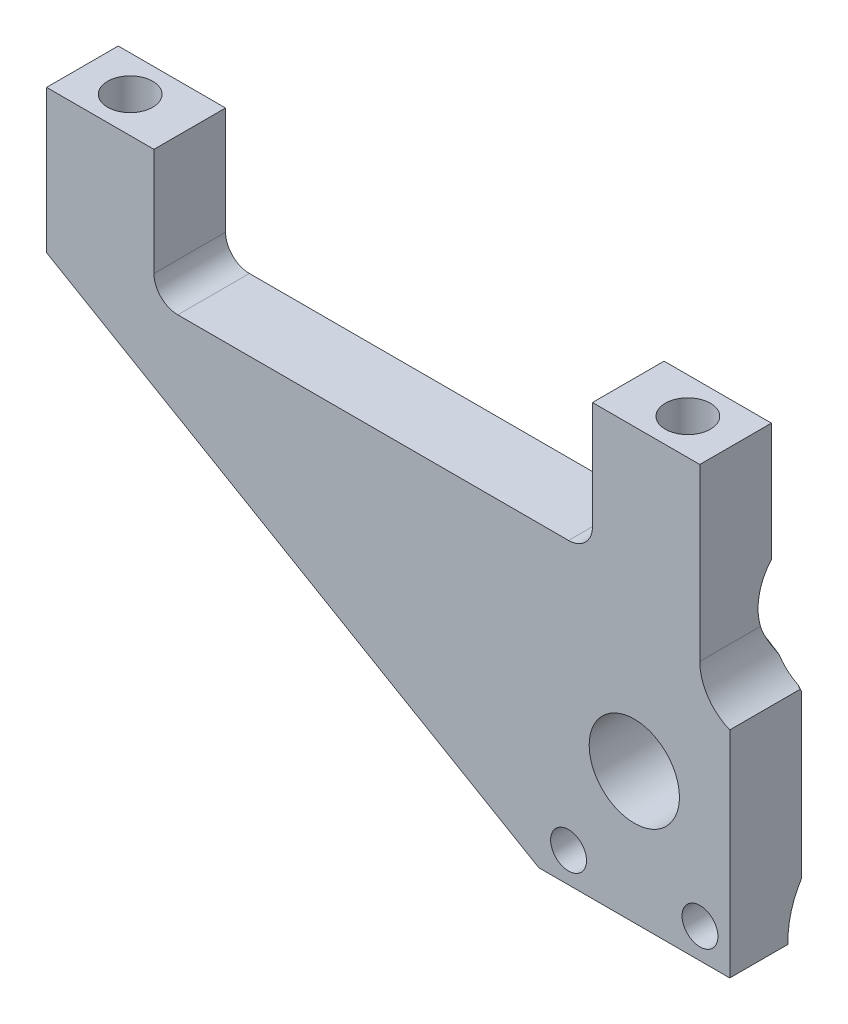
ISO-10303-21;
HEADER;
FILE_DESCRIPTION(('STEP AP214'),'2;1');
FILE_NAME('part.step','',(''),(''),'','','');
FILE_SCHEMA(('AUTOMOTIVE_DESIGN { 1 0 10303 214 1 1 1 1 }'));
ENDSEC;
DATA;
#1=APPLICATION_CONTEXT('core data for automotive mechanical design processes');
#2=APPLICATION_PROTOCOL_DEFINITION('international standard','automotive_design',2000,#1);
#3=PRODUCT_CONTEXT('',#1,'mechanical');
#4=PRODUCT('Part','Part','',(#3));
#5=PRODUCT_RELATED_PRODUCT_CATEGORY('part','',(#4));
#6=PRODUCT_DEFINITION_FORMATION('','',#4);
#7=PRODUCT_DEFINITION_CONTEXT('part definition',#1,'design');
#8=PRODUCT_DEFINITION('design','',#6,#7);
#9=PRODUCT_DEFINITION_SHAPE('','',#8);
#10=(LENGTH_UNIT() NAMED_UNIT(*) SI_UNIT(.MILLI.,.METRE.));
#11=(NAMED_UNIT(*) PLANE_ANGLE_UNIT() SI_UNIT($,.RADIAN.));
#12=(NAMED_UNIT(*) SI_UNIT($,.STERADIAN.) SOLID_ANGLE_UNIT());
#13=UNCERTAINTY_MEASURE_WITH_UNIT(LENGTH_MEASURE(1.E-05),#10,'distance_accuracy_value','');
#14=(GEOMETRIC_REPRESENTATION_CONTEXT(3) GLOBAL_UNCERTAINTY_ASSIGNED_CONTEXT((#13)) GLOBAL_UNIT_ASSIGNED_CONTEXT((#10,
#11,#12)) REPRESENTATION_CONTEXT('',''));
#15=CARTESIAN_POINT('',(0.,0.,0.));
#16=DIRECTION('',(0.,0.,1.));
#17=DIRECTION('',(1.,0.,0.));
#18=AXIS2_PLACEMENT_3D('',#15,#16,#17);
#19=CARTESIAN_POINT('',(0.,0.,-4.7625));
#20=DIRECTION('',(0.,0.,-1.));
#21=DIRECTION('',(-1.,0.,0.));
#22=AXIS2_PLACEMENT_3D('',#19,#20,#21);
#23=PLANE('',#22);
#24=CARTESIAN_POINT('',(78.1558,0.,-4.7625));
#25=DIRECTION('',(0.,0.,-1.));
#26=DIRECTION('',(-1.,0.,0.));
#27=AXIS2_PLACEMENT_3D('',#24,#25,#26);
#28=CIRCLE('',#27,25.488735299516);
#29=CARTESIAN_POINT('',(72.5520545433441,24.8651093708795,-4.7625));
#30=VERTEX_POINT('',#29);
#31=CARTESIAN_POINT('',(86.868,23.9535633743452,-4.76249999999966));
#32=VERTEX_POINT('',#31);
#33=EDGE_CURVE('E482',#30,#32,#28,.T.);
#34=ORIENTED_EDGE('',*,*,#33,.F.);
#35=CARTESIAN_POINT('',(69.4182,25.3746,-4.7625));
#36=DIRECTION('',(0.,0.,-1.));
#37=DIRECTION('',(-1.,0.,0.));
#38=AXIS2_PLACEMENT_3D('',#35,#36,#37);
#39=CIRCLE('',#38,3.175);
#40=CARTESIAN_POINT('',(72.5932,25.3746,-4.7625));
#41=VERTEX_POINT('',#40);
#42=EDGE_CURVE('E287',#30,#41,#39,.F.);
#43=ORIENTED_EDGE('',*,*,#42,.T.);
#44=DIRECTION('',(0.,-1.,0.));
#45=VECTOR('',#44,1.);
#46=CARTESIAN_POINT('',(72.5932,22.1996,-4.7625));
#47=LINE('',#46,#45);
#48=CARTESIAN_POINT('',(72.5932,39.6748,-4.7625));
#49=VERTEX_POINT('',#48);
#50=EDGE_CURVE('E347',#49,#41,#47,.T.);
#51=ORIENTED_EDGE('',*,*,#50,.F.);
#52=DIRECTION('',(-1.,0.,0.));
#53=VECTOR('',#52,1.);
#54=CARTESIAN_POINT('',(86.868,39.6748,-4.7625));
#55=LINE('',#54,#53);
#56=CARTESIAN_POINT('',(86.868,39.6748,-4.7625));
#57=VERTEX_POINT('',#56);
#58=EDGE_CURVE('E350',#57,#49,#55,.T.);
#59=ORIENTED_EDGE('',*,*,#58,.F.);
#60=DIRECTION('',(0.,1.,0.));
#61=VECTOR('',#60,1.);
#62=CARTESIAN_POINT('',(86.868,11.0998,-4.7625));
#63=LINE('',#62,#61);
#64=EDGE_CURVE('E332',#32,#57,#63,.T.);
#65=ORIENTED_EDGE('',*,*,#64,.F.);
#66=EDGE_LOOP('',(#34,#43,#51,#59,#65));
#67=FACE_BOUND('',#66,.T.);
#68=ADVANCED_FACE('F111',(#67),#23,.T.);
#69=CARTESIAN_POINT('',(55.5011621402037,-11.6808822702,-4.7625));
#70=VERTEX_POINT('',#69);
#71=CARTESIAN_POINT('',(65.631687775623,22.1996,-4.7625));
#72=VERTEX_POINT('',#71);
#73=EDGE_CURVE('E821',#70,#72,#28,.T.);
#74=ORIENTED_EDGE('',*,*,#73,.F.);
#75=DIRECTION('',(0.864252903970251,-0.503057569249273,0.));
#76=VECTOR('',#75,1.);
#77=CARTESIAN_POINT('',(0.,20.6248,-4.7625));
#78=LINE('',#77,#76);
#79=CARTESIAN_POINT('',(0.,20.6248,-4.7625));
#80=VERTEX_POINT('',#79);
#81=EDGE_CURVE('E336',#80,#70,#78,.T.);
#82=ORIENTED_EDGE('',*,*,#81,.F.);
#83=DIRECTION('',(0.,-1.,0.));
#84=VECTOR('',#83,1.);
#85=CARTESIAN_POINT('',(0.,39.6748,-4.7625));
#86=LINE('',#85,#84);
#87=CARTESIAN_POINT('',(0.,39.6748,-4.7625));
#88=VERTEX_POINT('',#87);
#89=EDGE_CURVE('E339',#88,#80,#86,.T.);
#90=ORIENTED_EDGE('',*,*,#89,.F.);
#91=DIRECTION('',(-1.,0.,0.));
#92=VECTOR('',#91,1.);
#93=CARTESIAN_POINT('',(14.2748,39.6748,-4.7625));
#94=LINE('',#93,#92);
#95=CARTESIAN_POINT('',(14.2748,39.6748,-4.7625));
#96=VERTEX_POINT('',#95);
#97=EDGE_CURVE('E341',#96,#88,#94,.T.);
#98=ORIENTED_EDGE('',*,*,#97,.F.);
#99=DIRECTION('',(0.,1.,0.));
#100=VECTOR('',#99,1.);
#101=CARTESIAN_POINT('',(14.2748,39.6748,-4.7625));
#102=LINE('',#101,#100);
#103=CARTESIAN_POINT('',(14.2748,25.3746,-4.7625));
#104=VERTEX_POINT('',#103);
#105=EDGE_CURVE('E343',#104,#96,#102,.T.);
#106=ORIENTED_EDGE('',*,*,#105,.F.);
#107=CARTESIAN_POINT('',(17.4498,25.3746,-4.7625));
#108=DIRECTION('',(0.,0.,-1.));
#109=DIRECTION('',(-1.,0.,0.));
#110=AXIS2_PLACEMENT_3D('',#107,#108,#109);
#111=CIRCLE('',#110,3.175);
#112=CARTESIAN_POINT('',(17.4498,22.1996,-4.7625));
#113=VERTEX_POINT('',#112);
#114=EDGE_CURVE('E282',#104,#113,#111,.F.);
#115=ORIENTED_EDGE('',*,*,#114,.T.);
#116=DIRECTION('',(-1.,0.,0.));
#117=VECTOR('',#116,1.);
#118=CARTESIAN_POINT('',(14.2748,22.1996,-4.7625));
#119=LINE('',#118,#117);
#120=EDGE_CURVE('E345',#72,#113,#119,.T.);
#121=ORIENTED_EDGE('',*,*,#120,.F.);
#122=EDGE_LOOP('',(#74,#82,#90,#98,#106,#115,#121));
#123=FACE_BOUND('',#122,.T.);
#124=ADVANCED_FACE('F531',(#123),#23,.T.);
#125=CARTESIAN_POINT('',(0.,0.,4.7625));
#126=DIRECTION('',(0.,0.,-1.));
#127=DIRECTION('',(-1.,0.,0.));
#128=AXIS2_PLACEMENT_3D('',#125,#126,#127);
#129=PLANE('',#128);
#130=CARTESIAN_POINT('',(69.4182,-13.4874,4.7625));
#131=DIRECTION('',(0.,0.,1.));
#132=DIRECTION('',(1.,0.,0.));
#133=AXIS2_PLACEMENT_3D('',#130,#131,#132);
#134=CIRCLE('',#133,2.38760000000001);
#135=CARTESIAN_POINT('',(67.0306,-13.4874,4.7625));
#136=VERTEX_POINT('',#135);
#137=EDGE_CURVE('E378',#136,#136,#134,.T.);
#138=ORIENTED_EDGE('',*,*,#137,.F.);
#139=EDGE_LOOP('',(#138));
#140=FACE_BOUND('',#139,.T.);
#141=DIRECTION('',(-1.,0.,0.));
#142=VECTOR('',#141,1.);
#143=CARTESIAN_POINT('',(86.868,39.6748,4.7625));
#144=LINE('',#143,#142);
#145=CARTESIAN_POINT('',(86.868,39.6748,4.7625));
#146=VERTEX_POINT('',#145);
#147=CARTESIAN_POINT('',(72.5932,39.6748,4.7625));
#148=VERTEX_POINT('',#147);
#149=EDGE_CURVE('E334',#146,#148,#144,.T.);
#150=ORIENTED_EDGE('',*,*,#149,.T.);
#151=DIRECTION('',(0.,-1.,0.));
#152=VECTOR('',#151,1.);
#153=CARTESIAN_POINT('',(72.5932,22.1996,4.7625));
#154=LINE('',#153,#152);
#155=CARTESIAN_POINT('',(72.5932,25.3746,4.7625));
#156=VERTEX_POINT('',#155);
#157=EDGE_CURVE('E370',#148,#156,#154,.T.);
#158=ORIENTED_EDGE('',*,*,#157,.T.);
#159=CARTESIAN_POINT('',(69.4182,25.3746,4.7625));
#160=DIRECTION('',(0.,0.,-1.));
#161=DIRECTION('',(-1.,0.,0.));
#162=AXIS2_PLACEMENT_3D('',#159,#160,#161);
#163=CIRCLE('',#162,3.175);
#164=CARTESIAN_POINT('',(69.4182,22.1996,4.7625));
#165=VERTEX_POINT('',#164);
#166=EDGE_CURVE('E285',#156,#165,#163,.T.);
#167=ORIENTED_EDGE('',*,*,#166,.T.);
#168=DIRECTION('',(-1.,0.,0.));
#169=VECTOR('',#168,1.);
#170=CARTESIAN_POINT('',(14.2748,22.1996,4.7625));
#171=LINE('',#170,#169);
#172=CARTESIAN_POINT('',(17.4498,22.1996,4.7625));
#173=VERTEX_POINT('',#172);
#174=EDGE_CURVE('E367',#165,#173,#171,.T.);
#175=ORIENTED_EDGE('',*,*,#174,.T.);
#176=CARTESIAN_POINT('',(17.4498,25.3746,4.7625));
#177=DIRECTION('',(0.,0.,-1.));
#178=DIRECTION('',(-1.,0.,0.));
#179=AXIS2_PLACEMENT_3D('',#176,#177,#178);
#180=CIRCLE('',#179,3.175);
#181=CARTESIAN_POINT('',(14.2748,25.3746,4.7625));
#182=VERTEX_POINT('',#181);
#183=EDGE_CURVE('E124',#173,#182,#180,.T.);
#184=ORIENTED_EDGE('',*,*,#183,.T.);
#185=DIRECTION('',(0.,1.,0.));
#186=VECTOR('',#185,1.);
#187=CARTESIAN_POINT('',(14.2748,39.6748,4.7625));
#188=LINE('',#187,#186);
#189=CARTESIAN_POINT('',(14.2748,39.6748,4.7625));
#190=VERTEX_POINT('',#189);
#191=EDGE_CURVE('E365',#182,#190,#188,.T.);
#192=ORIENTED_EDGE('',*,*,#191,.T.);
#193=DIRECTION('',(-1.,0.,0.));
#194=VECTOR('',#193,1.);
#195=CARTESIAN_POINT('',(14.2748,39.6748,4.7625));
#196=LINE('',#195,#194);
#197=CARTESIAN_POINT('',(0.,39.6748,4.7625));
#198=VERTEX_POINT('',#197);
#199=EDGE_CURVE('E363',#190,#198,#196,.T.);
#200=ORIENTED_EDGE('',*,*,#199,.T.);
#201=DIRECTION('',(0.,-1.,0.));
#202=VECTOR('',#201,1.);
#203=CARTESIAN_POINT('',(0.,39.6748,4.7625));
#204=LINE('',#203,#202);
#205=CARTESIAN_POINT('',(0.,20.6248,4.7625));
#206=VERTEX_POINT('',#205);
#207=EDGE_CURVE('E361',#198,#206,#204,.T.);
#208=ORIENTED_EDGE('',*,*,#207,.T.);
#209=DIRECTION('',(0.864252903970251,-0.503057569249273,0.));
#210=VECTOR('',#209,1.);
#211=CARTESIAN_POINT('',(0.,20.6248,4.7625));
#212=LINE('',#211,#210);
#213=CARTESIAN_POINT('',(65.4558,-17.4752,4.7625));
#214=VERTEX_POINT('',#213);
#215=EDGE_CURVE('E359',#206,#214,#212,.T.);
#216=ORIENTED_EDGE('',*,*,#215,.T.);
#217=DIRECTION('',(1.,0.,0.));
#218=VECTOR('',#217,1.);
#219=CARTESIAN_POINT('',(65.4558,-17.4752,4.7625));
#220=LINE('',#219,#218);
#221=CARTESIAN_POINT('',(90.8558,-17.4752,4.7625));
#222=VERTEX_POINT('',#221);
#223=EDGE_CURVE('E357',#214,#222,#220,.T.);
#224=ORIENTED_EDGE('',*,*,#223,.T.);
#225=DIRECTION('',(0.,1.,0.));
#226=VECTOR('',#225,1.);
#227=CARTESIAN_POINT('',(90.8558,-17.4752,4.7625));
#228=LINE('',#227,#226);
#229=CARTESIAN_POINT('',(90.8558,11.0998,4.7625));
#230=VERTEX_POINT('',#229);
#231=EDGE_CURVE('E355',#222,#230,#228,.T.);
#232=ORIENTED_EDGE('',*,*,#231,.T.);
#233=CARTESIAN_POINT('',(93.218,16.9940778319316,4.7625));
#234=DIRECTION('',(0.,0.,-1.));
#235=DIRECTION('',(-1.,0.,0.));
#236=AXIS2_PLACEMENT_3D('',#233,#234,#235);
#237=CIRCLE('',#236,6.35);
#238=CARTESIAN_POINT('',(86.868,16.9940778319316,4.7625));
#239=VERTEX_POINT('',#238);
#240=EDGE_CURVE('E299',#230,#239,#237,.T.);
#241=ORIENTED_EDGE('',*,*,#240,.T.);
#242=DIRECTION('',(0.,1.,0.));
#243=VECTOR('',#242,1.);
#244=CARTESIAN_POINT('',(86.868,11.0998,4.7625));
#245=LINE('',#244,#243);
#246=EDGE_CURVE('E331',#239,#146,#245,.T.);
#247=ORIENTED_EDGE('',*,*,#246,.T.);
#248=EDGE_LOOP('',(#150,#158,#167,#175,#184,#192,#200,#208,#216,#224,#232,#241,#247));
#249=FACE_BOUND('',#248,.T.);
#250=CARTESIAN_POINT('',(78.1558,0.,4.7625));
#251=DIRECTION('',(0.,0.,1.));
#252=DIRECTION('',(1.,0.,0.));
#253=AXIS2_PLACEMENT_3D('',#250,#251,#252);
#254=CIRCLE('',#253,6.);
#255=CARTESIAN_POINT('',(72.1558,0.,4.7625));
#256=VERTEX_POINT('',#255);
#257=EDGE_CURVE('E353',#256,#256,#254,.T.);
#258=ORIENTED_EDGE('',*,*,#257,.F.);
#259=EDGE_LOOP('',(#258));
#260=FACE_BOUND('',#259,.T.);
#261=CARTESIAN_POINT('',(86.8934,-13.4874,4.7625));
#262=DIRECTION('',(0.,0.,1.));
#263=DIRECTION('',(1.,0.,0.));
#264=AXIS2_PLACEMENT_3D('',#261,#262,#263);
#265=CIRCLE('',#264,2.38760000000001);
#266=CARTESIAN_POINT('',(84.5058,-13.4874,4.7625));
#267=VERTEX_POINT('',#266);
#268=EDGE_CURVE('E383',#267,#267,#265,.T.);
#269=ORIENTED_EDGE('',*,*,#268,.F.);
#270=EDGE_LOOP('',(#269));
#271=FACE_BOUND('',#270,.T.);
#272=ADVANCED_FACE('F537',(#140,#249,#260,#271),#129,.F.);
#273=CARTESIAN_POINT('',(78.1558,0.,-4.7625));
#274=DIRECTION('',(0.,0.,1.));
#275=DIRECTION('',(1.,0.,0.));
#276=AXIS2_PLACEMENT_3D('',#273,#274,#275);
#277=CIRCLE('',#276,16.675264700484);
#278=CARTESIAN_POINT('',(90.8558,10.8062228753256,-4.76250000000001));
#279=VERTEX_POINT('',#278);
#280=CARTESIAN_POINT('',(90.4277935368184,11.2899347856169,-4.7625));
#281=VERTEX_POINT('',#280);
#282=EDGE_CURVE('E131',#279,#281,#277,.T.);
#283=ORIENTED_EDGE('',*,*,#282,.F.);
#284=DIRECTION('',(0.,1.,0.));
#285=VECTOR('',#284,1.);
#286=CARTESIAN_POINT('',(90.8558,-17.4752,-4.7625));
#287=LINE('',#286,#285);
#288=CARTESIAN_POINT('',(90.8558,-10.8062228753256,-4.7625));
#289=VERTEX_POINT('',#288);
#290=EDGE_CURVE('E262',#289,#279,#287,.T.);
#291=ORIENTED_EDGE('',*,*,#290,.F.);
#292=CARTESIAN_POINT('',(90.2776520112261,-11.4509893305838,-4.7625));
#293=VERTEX_POINT('',#292);
#294=EDGE_CURVE('E251',#293,#289,#277,.T.);
#295=ORIENTED_EDGE('',*,*,#294,.F.);
#296=CARTESIAN_POINT('',(86.8934,-13.4874,-4.7625));
#297=DIRECTION('',(0.,0.,-1.));
#298=DIRECTION('',(-1.,0.,0.));
#299=AXIS2_PLACEMENT_3D('',#296,#297,#298);
#300=CIRCLE('',#299,3.9497);
#301=CARTESIAN_POINT('',(83.6515418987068,-15.7436105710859,-4.7625));
#302=VERTEX_POINT('',#301);
#303=EDGE_CURVE('E260',#302,#293,#300,.T.);
#304=ORIENTED_EDGE('',*,*,#303,.F.);
#305=CARTESIAN_POINT('',(72.6600581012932,-15.7436105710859,-4.7625));
#306=VERTEX_POINT('',#305);
#307=EDGE_CURVE('E139',#306,#302,#277,.T.);
#308=ORIENTED_EDGE('',*,*,#307,.F.);
#309=CARTESIAN_POINT('',(69.4182,-13.4874,-4.7625));
#310=DIRECTION('',(0.,0.,-1.));
#311=DIRECTION('',(-1.,0.,0.));
#312=AXIS2_PLACEMENT_3D('',#309,#310,#311);
#313=CIRCLE('',#312,3.9497);
#314=CARTESIAN_POINT('',(66.0339479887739,-11.4509893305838,-4.7625));
#315=VERTEX_POINT('',#314);
#316=EDGE_CURVE('E275',#315,#306,#313,.T.);
#317=ORIENTED_EDGE('',*,*,#316,.F.);
#318=CARTESIAN_POINT('',(87.8902283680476,13.5390308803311,-4.7625));
#319=VERTEX_POINT('',#318);
#320=EDGE_CURVE('E822',#319,#315,#277,.T.);
#321=ORIENTED_EDGE('',*,*,#320,.F.);
#322=CARTESIAN_POINT('',(93.218,16.9940778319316,-4.7625));
#323=DIRECTION('',(0.,0.,-1.));
#324=DIRECTION('',(-1.,0.,0.));
#325=AXIS2_PLACEMENT_3D('',#322,#323,#324);
#326=CIRCLE('',#325,6.35);
#327=EDGE_CURVE('E301',#319,#281,#326,.F.);
#328=ORIENTED_EDGE('',*,*,#327,.T.);
#329=EDGE_LOOP('',(#283,#291,#295,#304,#308,#317,#321,#328));
#330=FACE_BOUND('',#329,.T.);
#331=CARTESIAN_POINT('',(78.1558,0.,-4.7625));
#332=DIRECTION('',(0.,0.,1.));
#333=DIRECTION('',(1.,0.,0.));
#334=AXIS2_PLACEMENT_3D('',#331,#332,#333);
#335=CIRCLE('',#334,6.);
#336=CARTESIAN_POINT('',(72.1558,0.,-4.7625));
#337=VERTEX_POINT('',#336);
#338=EDGE_CURVE('E375',#337,#337,#335,.T.);
#339=ORIENTED_EDGE('',*,*,#338,.T.);
#340=EDGE_LOOP('',(#339));
#341=FACE_BOUND('',#340,.T.);
#342=ADVANCED_FACE('F258',(#330,#341),#23,.T.);
#343=CARTESIAN_POINT('',(86.868,39.6748,4.7625));
#344=DIRECTION('',(0.,-1.,0.));
#345=DIRECTION('',(1.,0.,0.));
#346=AXIS2_PLACEMENT_3D('',#343,#344,#345);
#347=PLANE('',#346);
#348=CARTESIAN_POINT('',(80.518,39.6748,0.));
#349=DIRECTION('',(0.,1.,0.));
#350=DIRECTION('',(0.,0.,1.));
#351=AXIS2_PLACEMENT_3D('',#348,#349,#350);
#352=CIRCLE('',#351,3.);
#353=CARTESIAN_POINT('',(80.518,39.6748,3.));
#354=VERTEX_POINT('',#353);
#355=EDGE_CURVE('E395',#354,#354,#352,.T.);
#356=ORIENTED_EDGE('',*,*,#355,.F.);
#357=EDGE_LOOP('',(#356));
#358=FACE_BOUND('',#357,.T.);
#359=ORIENTED_EDGE('',*,*,#58,.T.);
#360=DIRECTION('',(0.,0.,-1.));
#361=VECTOR('',#360,1.);
#362=CARTESIAN_POINT('',(72.5932,39.6748,4.7625));
#363=LINE('',#362,#361);
#364=EDGE_CURVE('E307',#148,#49,#363,.T.);
#365=ORIENTED_EDGE('',*,*,#364,.F.);
#366=ORIENTED_EDGE('',*,*,#149,.F.);
#367=DIRECTION('',(0.,0.,-1.));
#368=VECTOR('',#367,1.);
#369=CARTESIAN_POINT('',(86.868,39.6748,4.7625));
#370=LINE('',#369,#368);
#371=EDGE_CURVE('E328',#146,#57,#370,.T.);
#372=ORIENTED_EDGE('',*,*,#371,.T.);
#373=EDGE_LOOP('',(#359,#365,#366,#372));
#374=FACE_BOUND('',#373,.T.);
#375=ADVANCED_FACE('F493',(#358,#374),#347,.F.);
#376=CARTESIAN_POINT('',(72.5932,22.1996,4.7625));
#377=DIRECTION('',(1.,0.,0.));
#378=DIRECTION('',(0.,0.,-1.));
#379=AXIS2_PLACEMENT_3D('',#376,#377,#378);
#380=PLANE('',#379);
#381=ORIENTED_EDGE('',*,*,#50,.T.);
#382=DIRECTION('',(0.,0.,-1.));
#383=VECTOR('',#382,1.);
#384=CARTESIAN_POINT('',(72.5932,25.3746,4.7625));
#385=LINE('',#384,#383);
#386=EDGE_CURVE('E292',#41,#156,#385,.F.);
#387=ORIENTED_EDGE('',*,*,#386,.T.);
#388=ORIENTED_EDGE('',*,*,#157,.F.);
#389=ORIENTED_EDGE('',*,*,#364,.T.);
#390=EDGE_LOOP('',(#381,#387,#388,#389));
#391=FACE_BOUND('',#390,.T.);
#392=ADVANCED_FACE('F497',(#391),#380,.F.);
#393=CARTESIAN_POINT('',(14.2748,22.1996,4.7625));
#394=DIRECTION('',(0.,-1.,0.));
#395=DIRECTION('',(0.,0.,-1.));
#396=AXIS2_PLACEMENT_3D('',#393,#394,#395);
#397=PLANE('',#396);
#398=DIRECTION('',(0.,0.,-1.));
#399=VECTOR('',#398,1.);
#400=CARTESIAN_POINT('',(69.4182,22.1996,-4.7625));
#401=LINE('',#400,#399);
#402=CARTESIAN_POINT('',(69.4182,22.1996,-3.62306027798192));
#403=VERTEX_POINT('',#402);
#404=EDGE_CURVE('E294',#165,#403,#401,.T.);
#405=ORIENTED_EDGE('',*,*,#404,.T.);
#406=CARTESIAN_POINT('',(62.8624709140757,22.1996,-6.92603454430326));
#407=CARTESIAN_POINT('',(62.7291534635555,22.1996,-7.11053756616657));
#408=CARTESIAN_POINT('',(62.6083508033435,22.1996,-7.30414140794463));
#409=CARTESIAN_POINT('',(62.3977662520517,22.1996,-7.70781373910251));
#410=CARTESIAN_POINT('',(62.3079702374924,22.1996,-7.91787467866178));
#411=CARTESIAN_POINT('',(62.2006219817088,22.1996,-8.24267306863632));
#412=CARTESIAN_POINT('',(62.1693301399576,22.1996,-8.35299882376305));
#413=CARTESIAN_POINT('',(62.1166206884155,22.1996,-8.57596945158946));
#414=CARTESIAN_POINT('',(62.0951988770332,22.1996,-8.68861331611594));
#415=CARTESIAN_POINT('',(62.0626634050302,22.1996,-8.91536602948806));
#416=CARTESIAN_POINT('',(62.0515485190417,22.1996,-9.02947470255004));
#417=CARTESIAN_POINT('',(62.0398504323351,22.1996,-9.25822910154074));
#418=CARTESIAN_POINT('',(62.0392666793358,22.1996,-9.37287479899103));
#419=CARTESIAN_POINT('',(62.0483514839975,22.1996,-9.59454476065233));
#420=CARTESIAN_POINT('',(62.0573785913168,22.1996,-9.70159556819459));
#421=CARTESIAN_POINT('',(62.0845155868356,22.1996,-9.91455047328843));
#422=CARTESIAN_POINT('',(62.1026285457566,22.1996,-10.020454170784));
#423=CARTESIAN_POINT('',(62.1701628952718,22.1996,-10.3352690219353));
#424=CARTESIAN_POINT('',(62.2327883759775,22.1996,-10.5414755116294));
#425=CARTESIAN_POINT('',(62.3900539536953,22.1996,-10.9436626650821));
#426=CARTESIAN_POINT('',(62.4850426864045,22.1996,-11.1395039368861));
#427=CARTESIAN_POINT('',(62.7017001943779,22.1996,-11.5157346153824));
#428=CARTESIAN_POINT('',(62.8233819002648,22.1996,-11.6961164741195));
#429=CARTESIAN_POINT('',(63.1624209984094,22.1996,-12.136293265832));
#430=CARTESIAN_POINT('',(63.3952554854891,22.1996,-12.38416756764));
#431=CARTESIAN_POINT('',(63.8972052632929,22.1996,-12.8400033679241));
#432=CARTESIAN_POINT('',(64.1664087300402,22.1996,-13.0478647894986));
#433=CARTESIAN_POINT('',(64.6726314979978,22.1996,-13.3891786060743));
#434=CARTESIAN_POINT('',(64.9053185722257,22.1996,-13.5291982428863));
#435=CARTESIAN_POINT('',(65.3821068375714,22.1996,-13.7884663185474));
#436=CARTESIAN_POINT('',(65.6262157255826,22.1996,-13.9077004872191));
#437=CARTESIAN_POINT('',(66.122897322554,22.1996,-14.1278660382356));
#438=CARTESIAN_POINT('',(66.3754821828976,22.1996,-14.2287696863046));
#439=CARTESIAN_POINT('',(66.8863879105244,22.1996,-14.4143147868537));
#440=CARTESIAN_POINT('',(67.1447067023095,22.1996,-14.4989620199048));
#441=CARTESIAN_POINT('',(67.7793577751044,22.1996,-14.688080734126));
#442=CARTESIAN_POINT('',(68.1579191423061,22.1996,-14.7850444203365));
#443=CARTESIAN_POINT('',(68.9203910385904,22.1996,-14.955372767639));
#444=CARTESIAN_POINT('',(69.3043045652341,22.1996,-15.0287236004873));
#445=CARTESIAN_POINT('',(70.0760991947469,22.1996,-15.1565846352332));
#446=CARTESIAN_POINT('',(70.4639873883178,22.1996,-15.211051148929));
#447=CARTESIAN_POINT('',(71.2414589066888,22.1996,-15.3048943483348));
#448=CARTESIAN_POINT('',(71.6310418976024,22.1996,-15.3442738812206));
#449=CARTESIAN_POINT('',(72.4135961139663,22.1996,-15.4115190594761));
#450=CARTESIAN_POINT('',(72.8065733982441,22.1996,-15.4393120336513));
#451=CARTESIAN_POINT('',(73.5930594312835,22.1996,-15.4858452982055));
#452=CARTESIAN_POINT('',(73.9865682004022,22.1996,-15.5045852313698));
#453=CARTESIAN_POINT('',(74.7733646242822,22.1996,-15.5352195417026));
#454=CARTESIAN_POINT('',(75.1666519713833,22.1996,-15.5471221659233));
#455=CARTESIAN_POINT('',(75.9533360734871,22.1996,-15.5657554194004));
#456=CARTESIAN_POINT('',(76.346732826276,22.1996,-15.5724861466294));
#457=CARTESIAN_POINT('',(77.0773610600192,22.1996,-15.5811429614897));
#458=CARTESIAN_POINT('',(77.4145864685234,22.1996,-15.5836181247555));
#459=CARTESIAN_POINT('',(78.08904648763,22.1996,-15.5858204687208));
#460=CARTESIAN_POINT('',(78.4262810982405,22.1996,-15.5855476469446));
#461=CARTESIAN_POINT('',(79.1008596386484,22.1996,-15.5822216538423));
#462=CARTESIAN_POINT('',(79.438203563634,22.1996,-15.5791674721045));
#463=CARTESIAN_POINT('',(80.1128486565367,22.1996,-15.5699105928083));
#464=CARTESIAN_POINT('',(80.4501498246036,22.1996,-15.5637079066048));
#465=CARTESIAN_POINT('',(81.1235734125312,22.1996,-15.5474856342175));
#466=CARTESIAN_POINT('',(81.459696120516,22.1996,-15.5374784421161));
#467=CARTESIAN_POINT('',(82.131775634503,22.1996,-15.5126392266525));
#468=CARTESIAN_POINT('',(82.4677324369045,22.1996,-15.4978071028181));
#469=CARTESIAN_POINT('',(83.1392151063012,22.1996,-15.4620068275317));
#470=CARTESIAN_POINT('',(83.4747410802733,22.1996,-15.4410407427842));
#471=CARTESIAN_POINT('',(84.1452085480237,22.1996,-15.3913454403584));
#472=CARTESIAN_POINT('',(84.4801500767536,22.1996,-15.3626167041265));
#473=CARTESIAN_POINT('',(85.1904871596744,22.1996,-15.2913036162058));
#474=CARTESIAN_POINT('',(85.5657584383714,22.1996,-15.2474444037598));
#475=CARTESIAN_POINT('',(86.3142848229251,22.1996,-15.1442198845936));
#476=CARTESIAN_POINT('',(86.6875395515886,22.1996,-15.0848517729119));
#477=CARTESIAN_POINT('',(87.4304006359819,22.1996,-14.9468019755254));
#478=CARTESIAN_POINT('',(87.8000081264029,22.1996,-14.8681265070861));
#479=CARTESIAN_POINT('',(88.5333442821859,22.1996,-14.6869962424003));
#480=CARTESIAN_POINT('',(88.8970754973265,22.1996,-14.5845520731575));
#481=CARTESIAN_POINT('',(89.4828889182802,22.1996,-14.3937492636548));
#482=CARTESIAN_POINT('',(89.7078066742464,22.1996,-14.314096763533));
#483=CARTESIAN_POINT('',(90.152566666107,22.1996,-14.141754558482));
#484=CARTESIAN_POINT('',(90.372410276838,22.1996,-14.0490684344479));
#485=CARTESIAN_POINT('',(90.8052191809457,22.1996,-13.8491473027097));
#486=CARTESIAN_POINT('',(91.0181901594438,22.1996,-13.7419247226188));
#487=CARTESIAN_POINT('',(91.4350994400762,22.1996,-13.5112874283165));
#488=CARTESIAN_POINT('',(91.6390413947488,22.1996,-13.3878793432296));
#489=CARTESIAN_POINT('',(92.1078282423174,22.1996,-13.0745782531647));
#490=CARTESIAN_POINT('',(92.3675919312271,22.1996,-12.876897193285));
#491=CARTESIAN_POINT('',(92.8545382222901,22.1996,-12.4447514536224));
#492=CARTESIAN_POINT('',(93.081770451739,22.1996,-12.2103439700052));
#493=CARTESIAN_POINT('',(93.4422708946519,22.1996,-11.7625598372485));
#494=CARTESIAN_POINT('',(93.5850987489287,22.1996,-11.556992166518));
#495=CARTESIAN_POINT('',(93.7729500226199,22.1996,-11.2334163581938));
#496=CARTESIAN_POINT('',(93.8311820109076,22.1996,-11.1229854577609));
#497=CARTESIAN_POINT('',(93.9378764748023,22.1996,-10.8975245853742));
#498=CARTESIAN_POINT('',(93.9863434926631,22.1996,-10.7824967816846));
#499=CARTESIAN_POINT('',(94.0730113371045,22.1996,-10.5473400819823));
#500=CARTESIAN_POINT('',(94.111106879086,22.1996,-10.4271722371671));
#501=CARTESIAN_POINT('',(94.1755466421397,22.1996,-10.1837766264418));
#502=CARTESIAN_POINT('',(94.2018969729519,22.1996,-10.0605504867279));
#503=CARTESIAN_POINT('',(94.2422349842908,22.1996,-9.81213541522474));
#504=CARTESIAN_POINT('',(94.2562278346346,22.1996,-9.68694732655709));
#505=CARTESIAN_POINT('',(94.2715150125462,22.1996,-9.43580685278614));
#506=CARTESIAN_POINT('',(94.2728111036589,22.1996,-9.30985457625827));
#507=CARTESIAN_POINT('',(94.2633940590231,22.1996,-9.07626577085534));
#508=CARTESIAN_POINT('',(94.2543540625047,22.1996,-8.96855909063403));
#509=CARTESIAN_POINT('',(94.2270806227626,22.1996,-8.75430639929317));
#510=CARTESIAN_POINT('',(94.2088443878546,22.1996,-8.64776075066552));
#511=CARTESIAN_POINT('',(94.140786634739,22.1996,-8.33108605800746));
#512=CARTESIAN_POINT('',(94.077606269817,22.1996,-8.12369848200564));
#513=CARTESIAN_POINT('',(93.9193506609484,22.1996,-7.72049102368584));
#514=CARTESIAN_POINT('',(93.824107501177,22.1996,-7.52473856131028));
#515=CARTESIAN_POINT('',(93.6069761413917,22.1996,-7.14870501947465));
#516=CARTESIAN_POINT('',(93.4850749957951,22.1996,-6.96843151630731));
#517=CARTESIAN_POINT('',(93.1452854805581,22.1996,-6.52824302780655));
#518=CARTESIAN_POINT('',(92.9118853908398,22.1996,-6.28030154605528));
#519=CARTESIAN_POINT('',(92.4088184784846,22.1996,-5.82442663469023));
#520=CARTESIAN_POINT('',(92.139065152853,22.1996,-5.61659159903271));
#521=CARTESIAN_POINT('',(91.6317550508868,22.1996,-5.27529696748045));
#522=CARTESIAN_POINT('',(91.3985195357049,22.1996,-5.13527229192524));
#523=CARTESIAN_POINT('',(90.9206375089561,22.1996,-4.87603809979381));
#524=CARTESIAN_POINT('',(90.6759832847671,22.1996,-4.75684291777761));
#525=CARTESIAN_POINT('',(90.1781490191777,22.1996,-4.53675752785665));
#526=CARTESIAN_POINT('',(89.9249545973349,22.1996,-4.43590023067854));
#527=CARTESIAN_POINT('',(89.4128373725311,22.1996,-4.25047980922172));
#528=CARTESIAN_POINT('',(89.1539166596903,22.1996,-4.1659108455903));
#529=CARTESIAN_POINT('',(88.5164394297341,22.1996,-3.97660307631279));
#530=CARTESIAN_POINT('',(88.1356264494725,22.1996,-3.8794903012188));
#531=CARTESIAN_POINT('',(87.3686385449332,22.1996,-3.70904087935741));
#532=CARTESIAN_POINT('',(86.9824605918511,22.1996,-3.63571828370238));
#533=CARTESIAN_POINT('',(86.2061315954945,22.1996,-3.50802678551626));
#534=CARTESIAN_POINT('',(85.815973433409,22.1996,-3.45370207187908));
#535=CARTESIAN_POINT('',(85.0339733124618,22.1996,-3.3602065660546));
#536=CARTESIAN_POINT('',(84.6421316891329,22.1996,-3.32103288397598));
#537=CARTESIAN_POINT('',(83.8556692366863,22.1996,-3.25427906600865));
#538=CARTESIAN_POINT('',(83.4610439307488,22.1996,-3.22675332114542));
#539=CARTESIAN_POINT('',(82.6712709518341,22.1996,-3.18073115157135));
#540=CARTESIAN_POINT('',(82.2761232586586,22.1996,-3.16223508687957));
#541=CARTESIAN_POINT('',(81.4860477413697,22.1996,-3.13206122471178));
#542=CARTESIAN_POINT('',(81.0911202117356,22.1996,-3.1203753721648));
#543=CARTESIAN_POINT('',(80.3011596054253,22.1996,-3.10215418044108));
#544=CARTESIAN_POINT('',(79.9061265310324,22.1996,-3.09561873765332));
#545=CARTESIAN_POINT('',(79.2307705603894,22.1996,-3.0879847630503));
#546=CARTESIAN_POINT('',(78.950458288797,22.1996,-3.0858583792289));
#547=CARTESIAN_POINT('',(78.3898256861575,22.1996,-3.08352269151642));
#548=CARTESIAN_POINT('',(78.109505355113,22.1996,-3.08331338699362));
#549=CARTESIAN_POINT('',(77.548802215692,22.1996,-3.08479172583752));
#550=CARTESIAN_POINT('',(77.268419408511,22.1996,-3.08647982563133));
#551=CARTESIAN_POINT('',(76.7076726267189,22.1996,-3.09189567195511));
#552=CARTESIAN_POINT('',(76.4273086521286,22.1996,-3.09562342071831));
#553=CARTESIAN_POINT('',(75.8664015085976,22.1996,-3.10542130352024));
#554=CARTESIAN_POINT('',(75.5858583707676,22.1996,-3.11149326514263));
#555=CARTESIAN_POINT('',(75.0248418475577,22.1996,-3.12643526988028));
#556=CARTESIAN_POINT('',(74.7443684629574,22.1996,-3.1353053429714));
#557=CARTESIAN_POINT('',(74.183595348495,22.1996,-3.1564507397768));
#558=CARTESIAN_POINT('',(73.9032955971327,22.1996,-3.16872548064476));
#559=CARTESIAN_POINT('',(73.3429129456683,22.1996,-3.19744010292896));
#560=CARTESIAN_POINT('',(73.0628300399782,22.1996,-3.21387987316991));
#561=CARTESIAN_POINT('',(72.499118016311,22.1996,-3.25209729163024));
#562=CARTESIAN_POINT('',(72.2154936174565,22.1996,-3.27394584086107));
#563=CARTESIAN_POINT('',(71.6487903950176,22.1996,-3.32396621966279));
#564=CARTESIAN_POINT('',(71.3657115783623,22.1996,-3.35213812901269));
#565=CARTESIAN_POINT('',(70.8001480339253,22.1996,-3.41610579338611));
#566=CARTESIAN_POINT('',(70.51766406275,22.1996,-3.45190833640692));
#567=CARTESIAN_POINT('',(69.953983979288,22.1996,-3.53257175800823));
#568=CARTESIAN_POINT('',(69.6727878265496,22.1996,-3.57743235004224));
#569=CARTESIAN_POINT('',(69.113848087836,22.1996,-3.67757323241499));
#570=CARTESIAN_POINT('',(68.8360939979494,22.1996,-3.73279418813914));
#571=CARTESIAN_POINT('',(68.2832679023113,22.1996,-3.85564212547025));
#572=CARTESIAN_POINT('',(68.0081962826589,22.1996,-3.92327086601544));
#573=CARTESIAN_POINT('',(67.4624735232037,22.1996,-4.0728295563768));
#574=CARTESIAN_POINT('',(67.191815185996,22.1996,-4.15473298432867));
#575=CARTESIAN_POINT('',(66.6561522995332,22.1996,-4.33515761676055));
#576=CARTESIAN_POINT('',(66.3911451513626,22.1996,-4.43367098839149));
#577=CARTESIAN_POINT('',(65.936851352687,22.1996,-4.6217434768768));
#578=CARTESIAN_POINT('',(65.7457777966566,22.1996,-4.70698077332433));
#579=CARTESIAN_POINT('',(65.3691577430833,22.1996,-4.88904588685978));
#580=CARTESIAN_POINT('',(65.1836120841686,22.1996,-4.98587545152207));
#581=CARTESIAN_POINT('',(64.8199264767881,22.1996,-5.1920892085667));
#582=CARTESIAN_POINT('',(64.6417763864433,22.1996,-5.3014553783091));
#583=CARTESIAN_POINT('',(64.294720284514,22.1996,-5.53388522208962));
#584=CARTESIAN_POINT('',(64.1258101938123,22.1996,-5.65694277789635));
#585=CARTESIAN_POINT('',(63.7559912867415,22.1996,-5.95273196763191));
#586=CARTESIAN_POINT('',(63.5586070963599,22.1996,-6.12994651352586));
#587=CARTESIAN_POINT('',(63.1893463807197,22.1996,-6.50936412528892));
#588=CARTESIAN_POINT('',(63.0174523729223,22.1996,-6.71154988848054));
#589=CARTESIAN_POINT('',(62.8624709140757,22.1996,-6.92603454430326));
#590=B_SPLINE_CURVE_WITH_KNOTS('',3,(#406,#407,#408,#409,#410,#411,#412,#413,#414,#415,#416,
#417,#418,#419,#420,#421,#422,#423,#424,#425,#426,#427,#428,#429,#430,#431,#432,#433,#434,#435,
#436,#437,#438,#439,#440,#441,#442,#443,#444,#445,#446,#447,#448,#449,#450,#451,#452,#453,#454,
#455,#456,#457,#458,#459,#460,#461,#462,#463,#464,#465,#466,#467,#468,#469,#470,#471,#472,#473,
#474,#475,#476,#477,#478,#479,#480,#481,#482,#483,#484,#485,#486,#487,#488,#489,#490,#491,#492,
#493,#494,#495,#496,#497,#498,#499,#500,#501,#502,#503,#504,#505,#506,#507,#508,#509,#510,#511,
#512,#513,#514,#515,#516,#517,#518,#519,#520,#521,#522,#523,#524,#525,#526,#527,#528,#529,#530,
#531,#532,#533,#534,#535,#536,#537,#538,#539,#540,#541,#542,#543,#544,#545,#546,#547,#548,#549,
#550,#551,#552,#553,#554,#555,#556,#557,#558,#559,#560,#561,#562,#563,#564,#565,#566,#567,#568,
#569,#570,#571,#572,#573,#574,#575,#576,#577,#578,#579,#580,#581,#582,#583,#584,#585,#586,#587,
#588,#589),.UNSPECIFIED.,.T.,.F.,(4,2,2,2,2,2,2,2,2,2,2,2,2,2,2,2,2,2,2,2,2,2,2,2,2,2,2,2,2,2,2,
2,2,2,2,2,2,2,2,2,2,2,2,2,2,2,2,2,2,2,2,2,2,2,2,2,2,2,2,2,2,2,2,2,2,2,2,2,2,2,2,2,2,2,2,2,2,2,2,
2,2,2,2,2,2,2,2,2,2,2,2,4),(0.,0.682335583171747,1.36435995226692,1.70801704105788,
2.05152770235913,2.39499751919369,2.73844932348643,3.0603354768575,3.38233049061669,
4.02575256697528,4.67633742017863,5.32723812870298,6.34170803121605,7.35868318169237,
8.17225089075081,8.9863749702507,9.80172075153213,10.6167760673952,11.7881007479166,
12.9601101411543,14.1348131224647,15.3092943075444,16.4910348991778,17.6728221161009,
18.8531808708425,20.0335172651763,21.0452094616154,22.056902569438,23.0689633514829,
24.0810204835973,25.0898084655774,26.0986174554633,27.1070869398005,28.1154938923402,
29.248718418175,30.3821480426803,31.515213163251,32.6477726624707,33.3632508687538,
34.0785328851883,34.7932071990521,35.5075897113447,36.4838594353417,37.4586236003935,
38.2064510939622,38.580586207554,38.9545468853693,39.3321730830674,39.7096026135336,
40.0868741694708,40.4640933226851,40.7879429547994,41.1118909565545,41.7591325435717,
42.4098179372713,43.0608200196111,44.0765906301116,45.0948224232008,45.9098060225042,
46.7253482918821,47.5423400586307,48.3590383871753,49.5370070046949,50.7156701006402,
51.8970568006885,53.0782180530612,54.2648355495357,55.4515003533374,56.6367587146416,
57.8219932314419,58.6629481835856,59.5039028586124,60.3450598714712,61.1862178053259,
62.0280328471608,62.8698569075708,63.711536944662,64.5531945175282,65.406530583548,
66.2598774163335,67.1139865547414,67.9680686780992,68.8174009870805,69.6668537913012,
70.5147448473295,71.3622371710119,71.9895735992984,72.6170047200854,73.2435448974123,
73.8698062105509,74.6635678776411,75.4567825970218),.UNSPECIFIED.);
#591=EDGE_CURVE('E473',#403,#72,#590,.T.);
#592=ORIENTED_EDGE('',*,*,#591,.T.);
#593=ORIENTED_EDGE('',*,*,#120,.T.);
#594=DIRECTION('',(0.,0.,-1.));
#595=VECTOR('',#594,1.);
#596=CARTESIAN_POINT('',(17.4498,22.1996,4.7625));
#597=LINE('',#596,#595);
#598=EDGE_CURVE('E297',#113,#173,#597,.F.);
#599=ORIENTED_EDGE('',*,*,#598,.T.);
#600=ORIENTED_EDGE('',*,*,#174,.F.);
#601=EDGE_LOOP('',(#405,#592,#593,#599,#600));
#602=FACE_BOUND('',#601,.T.);
#603=ADVANCED_FACE('F500',(#602),#397,.F.);
#604=CARTESIAN_POINT('',(14.2748,39.6748,4.7625));
#605=DIRECTION('',(-1.,0.,0.));
#606=DIRECTION('',(0.,-1.,0.));
#607=AXIS2_PLACEMENT_3D('',#604,#605,#606);
#608=PLANE('',#607);
#609=ORIENTED_EDGE('',*,*,#191,.F.);
#610=DIRECTION('',(0.,0.,-1.));
#611=VECTOR('',#610,1.);
#612=CARTESIAN_POINT('',(14.2748,25.3746,-4.7625));
#613=LINE('',#612,#611);
#614=EDGE_CURVE('E289',#182,#104,#613,.T.);
#615=ORIENTED_EDGE('',*,*,#614,.T.);
#616=ORIENTED_EDGE('',*,*,#105,.T.);
#617=DIRECTION('',(0.,0.,-1.));
#618=VECTOR('',#617,1.);
#619=CARTESIAN_POINT('',(14.2748,39.6748,4.7625));
#620=LINE('',#619,#618);
#621=EDGE_CURVE('E310',#190,#96,#620,.T.);
#622=ORIENTED_EDGE('',*,*,#621,.F.);
#623=EDGE_LOOP('',(#609,#615,#616,#622));
#624=FACE_BOUND('',#623,.T.);
#625=ADVANCED_FACE('F505',(#624),#608,.F.);
#626=CARTESIAN_POINT('',(14.2748,39.6748,4.7625));
#627=DIRECTION('',(0.,-1.,0.));
#628=DIRECTION('',(0.,0.,-1.));
#629=AXIS2_PLACEMENT_3D('',#626,#627,#628);
#630=PLANE('',#629);
#631=CARTESIAN_POINT('',(6.34999999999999,39.6748,0.));
#632=DIRECTION('',(0.,1.,0.));
#633=DIRECTION('',(0.,0.,1.));
#634=AXIS2_PLACEMENT_3D('',#631,#632,#633);
#635=CIRCLE('',#634,3.);
#636=CARTESIAN_POINT('',(6.34999999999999,39.6748,3.));
#637=VERTEX_POINT('',#636);
#638=EDGE_CURVE('E278',#637,#637,#635,.T.);
#639=ORIENTED_EDGE('',*,*,#638,.F.);
#640=EDGE_LOOP('',(#639));
#641=FACE_BOUND('',#640,.T.);
#642=ORIENTED_EDGE('',*,*,#97,.T.);
#643=DIRECTION('',(0.,0.,-1.));
#644=VECTOR('',#643,1.);
#645=CARTESIAN_POINT('',(0.,39.6748,4.7625));
#646=LINE('',#645,#644);
#647=EDGE_CURVE('E313',#198,#88,#646,.T.);
#648=ORIENTED_EDGE('',*,*,#647,.F.);
#649=ORIENTED_EDGE('',*,*,#199,.F.);
#650=ORIENTED_EDGE('',*,*,#621,.T.);
#651=EDGE_LOOP('',(#642,#648,#649,#650));
#652=FACE_BOUND('',#651,.T.);
#653=ADVANCED_FACE('F509',(#641,#652),#630,.F.);
#654=CARTESIAN_POINT('',(0.,39.6748,4.7625));
#655=DIRECTION('',(1.,0.,0.));
#656=DIRECTION('',(0.,0.,-1.));
#657=AXIS2_PLACEMENT_3D('',#654,#655,#656);
#658=PLANE('',#657);
#659=ORIENTED_EDGE('',*,*,#89,.T.);
#660=DIRECTION('',(0.,0.,-1.));
#661=VECTOR('',#660,1.);
#662=CARTESIAN_POINT('',(0.,20.6248,4.7625));
#663=LINE('',#662,#661);
#664=EDGE_CURVE('E316',#206,#80,#663,.T.);
#665=ORIENTED_EDGE('',*,*,#664,.F.);
#666=ORIENTED_EDGE('',*,*,#207,.F.);
#667=ORIENTED_EDGE('',*,*,#647,.T.);
#668=EDGE_LOOP('',(#659,#665,#666,#667));
#669=FACE_BOUND('',#668,.T.);
#670=ADVANCED_FACE('F513',(#669),#658,.F.);
#671=CARTESIAN_POINT('',(0.,20.6248,4.7625));
#672=DIRECTION('',(0.503057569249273,0.864252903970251,0.));
#673=DIRECTION('',(-0.864252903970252,0.503057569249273,0.));
#674=AXIS2_PLACEMENT_3D('',#671,#672,#673);
#675=PLANE('',#674);
#676=ORIENTED_EDGE('',*,*,#81,.T.);
#677=CARTESIAN_POINT('',(55.5008285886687,-11.6806881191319,-4.7627));
#678=CARTESIAN_POINT('',(55.6393744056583,-11.7613317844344,-4.67963939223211));
#679=CARTESIAN_POINT('',(55.7798925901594,-11.843123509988,-4.60109834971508));
#680=CARTESIAN_POINT('',(56.0641318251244,-12.0085712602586,-4.4524448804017));
#681=CARTESIAN_POINT('',(56.2078510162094,-12.092226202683,-4.38232770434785));
#682=CARTESIAN_POINT('',(56.4974916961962,-12.2608179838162,-4.25000940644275));
#683=CARTESIAN_POINT('',(56.643405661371,-12.3457504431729,-4.18778609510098));
#684=CARTESIAN_POINT('',(56.9373514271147,-12.5168480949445,-4.0703965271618));
#685=CARTESIAN_POINT('',(57.0853835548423,-12.6030134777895,-4.01523137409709));
#686=CARTESIAN_POINT('',(57.5288411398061,-12.8611377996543,-3.86053616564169));
#687=CARTESIAN_POINT('',(57.826735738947,-13.0345339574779,-3.7704225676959));
#688=CARTESIAN_POINT('',(58.4268198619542,-13.3838262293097,-3.61124101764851));
#689=CARTESIAN_POINT('',(58.7290125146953,-13.5597241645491,-3.54218931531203));
#690=CARTESIAN_POINT('',(59.2945165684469,-13.8888883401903,-3.42969869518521));
#691=CARTESIAN_POINT('',(59.5575062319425,-14.0419673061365,-3.38405045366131));
#692=CARTESIAN_POINT('',(60.0847299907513,-14.3488495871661,-3.30355406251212));
#693=CARTESIAN_POINT('',(60.3489642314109,-14.5026529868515,-3.26870720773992));
#694=CARTESIAN_POINT('',(60.8783464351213,-14.8107916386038,-3.20786862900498));
#695=CARTESIAN_POINT('',(61.1434948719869,-14.965127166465,-3.18188254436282));
#696=CARTESIAN_POINT('',(61.67424620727,-15.2740627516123,-3.13706933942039));
#697=CARTESIAN_POINT('',(61.9398491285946,-15.428662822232,-3.11824259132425));
#698=CARTESIAN_POINT('',(62.4765314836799,-15.7410506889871,-3.08590688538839));
#699=CARTESIAN_POINT('',(62.7476158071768,-15.898841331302,-3.07250989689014));
#700=CARTESIAN_POINT('',(63.2899256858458,-16.2145048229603,-3.05016848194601));
#701=CARTESIAN_POINT('',(63.561151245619,-16.372377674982,-3.04122421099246));
#702=CARTESIAN_POINT('',(64.1029817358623,-16.6877621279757,-3.02660407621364));
#703=CARTESIAN_POINT('',(64.3735865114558,-16.8452736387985,-3.02092004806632));
#704=CARTESIAN_POINT('',(64.9147944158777,-17.1602957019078,-3.01187928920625));
#705=CARTESIAN_POINT('',(65.1853975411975,-17.3178062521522,-3.00852228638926));
#706=CARTESIAN_POINT('',(65.456,-17.4753164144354,-3.00587510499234));
#707=B_SPLINE_CURVE_WITH_KNOTS('',3,(#677,#678,#679,#680,#681,#682,#683,#684,#685,#686,#687,
#688,#689,#690,#691,#692,#693,#694,#695,#696,#697,#698,#699,#700,#701,#702,#703,#704,#705,#706),
.UNSPECIFIED.,.F.,.F.,(4,2,2,2,2,2,2,2,2,2,2,2,2,2,4),(0.,0.541494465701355,1.08268219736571,
1.6223132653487,2.16202860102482,3.22993145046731,4.2986561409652,5.22153669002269,
6.14452782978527,7.06810530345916,7.99173078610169,8.93353681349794,9.87537572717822,
10.8148456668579,11.7542057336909),.UNSPECIFIED.);
#708=CARTESIAN_POINT('',(65.4557999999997,-17.4752,-3.00587703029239));
#709=VERTEX_POINT('',#708);
#710=EDGE_CURVE('E454',#70,#709,#707,.T.);
#711=ORIENTED_EDGE('',*,*,#710,.T.);
#712=DIRECTION('',(0.,0.,-1.));
#713=VECTOR('',#712,1.);
#714=CARTESIAN_POINT('',(65.4558,-17.4752,4.7625));
#715=LINE('',#714,#713);
#716=EDGE_CURVE('E319',#214,#709,#715,.T.);
#717=ORIENTED_EDGE('',*,*,#716,.F.);
#718=ORIENTED_EDGE('',*,*,#215,.F.);
#719=ORIENTED_EDGE('',*,*,#664,.T.);
#720=EDGE_LOOP('',(#676,#711,#717,#718,#719));
#721=FACE_BOUND('',#720,.T.);
#722=ADVANCED_FACE('F516',(#721),#675,.F.);
#723=CARTESIAN_POINT('',(65.4558,-17.4752,4.7625));
#724=DIRECTION('',(0.,1.,0.));
#725=DIRECTION('',(0.,0.,1.));
#726=AXIS2_PLACEMENT_3D('',#723,#724,#725);
#727=PLANE('',#726);
#728=ORIENTED_EDGE('',*,*,#716,.T.);
#729=CARTESIAN_POINT('',(78.1558,-17.4752,-4.10826868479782));
#730=CARTESIAN_POINT('',(78.4207404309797,-17.4752,-4.10826721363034));
#731=CARTESIAN_POINT('',(78.6856848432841,-17.4752,-4.10409099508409));
#732=CARTESIAN_POINT('',(79.2153141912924,-17.4752,-4.08760998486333));
#733=CARTESIAN_POINT('',(79.4799991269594,-17.4752,-4.07530519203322));
#734=CARTESIAN_POINT('',(80.0090920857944,-17.4752,-4.04320808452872));
#735=CARTESIAN_POINT('',(80.2734997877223,-17.4752,-4.02341056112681));
#736=CARTESIAN_POINT('',(80.8017445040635,-17.4752,-3.97733799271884));
#737=CARTESIAN_POINT('',(81.065581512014,-17.4752,-3.9510628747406));
#738=CARTESIAN_POINT('',(81.8602751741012,-17.4752,-3.8639257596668));
#739=CARTESIAN_POINT('',(82.3902338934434,-17.4752,-3.79503514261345));
#740=CARTESIAN_POINT('',(83.4486553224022,-17.4752,-3.64782018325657));
#741=CARTESIAN_POINT('',(83.9771182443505,-17.4752,-3.56949725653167));
#742=CARTESIAN_POINT('',(85.0312728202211,-17.4752,-3.41611571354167));
#743=CARTESIAN_POINT('',(85.5569618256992,-17.4752,-3.34104016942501));
#744=CARTESIAN_POINT('',(86.6103752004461,-17.4752,-3.20515016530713));
#745=CARTESIAN_POINT('',(87.1380999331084,-17.4752,-3.14433838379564));
#746=CARTESIAN_POINT('',(88.193627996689,-17.4752,-3.04839595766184));
#747=CARTESIAN_POINT('',(88.7214197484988,-17.4752,-3.01314820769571));
#748=CARTESIAN_POINT('',(89.7779914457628,-17.4752,-2.978947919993));
#749=CARTESIAN_POINT('',(90.3067705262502,-17.4752,-2.97997181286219));
#750=CARTESIAN_POINT('',(91.435548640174,-17.4752,-3.03320588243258));
#751=CARTESIAN_POINT('',(92.0353225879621,-17.4752,-3.09244892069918));
#752=CARTESIAN_POINT('',(92.9252321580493,-17.4752,-3.24105035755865));
#753=CARTESIAN_POINT('',(93.2203839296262,-17.4752,-3.30058361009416));
#754=CARTESIAN_POINT('',(93.8052712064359,-17.4752,-3.44185791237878));
#755=CARTESIAN_POINT('',(94.0950074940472,-17.4752,-3.52359572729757));
#756=CARTESIAN_POINT('',(94.8220447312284,-17.4752,-3.7628071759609));
#757=CARTESIAN_POINT('',(95.2540919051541,-17.4752,-3.93730871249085));
#758=CARTESIAN_POINT('',(95.8770729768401,-17.4752,-4.24819993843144));
#759=CARTESIAN_POINT('',(96.0804947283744,-17.4752,-4.35997946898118));
#760=CARTESIAN_POINT('',(96.4769775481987,-17.4752,-4.600696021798));
#761=CARTESIAN_POINT('',(96.6700416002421,-17.4752,-4.72962806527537));
#762=CARTESIAN_POINT('',(96.9985245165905,-17.4752,-4.97208970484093));
#763=CARTESIAN_POINT('',(97.1366821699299,-17.4752,-5.08192189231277));
#764=CARTESIAN_POINT('',(97.4042166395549,-17.4752,-5.3117936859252));
#765=CARTESIAN_POINT('',(97.5335954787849,-17.4752,-5.43183092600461));
#766=CARTESIAN_POINT('',(97.7821316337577,-17.4752,-5.68192806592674));
#767=CARTESIAN_POINT('',(97.9012954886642,-17.4752,-5.81198145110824));
#768=CARTESIAN_POINT('',(98.1280229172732,-17.4752,-6.08184826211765));
#769=CARTESIAN_POINT('',(98.2355880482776,-17.4752,-6.22166037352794));
#770=CARTESIAN_POINT('',(98.4225525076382,-17.4752,-6.48893485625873));
#771=CARTESIAN_POINT('',(98.5037605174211,-17.4752,-6.61513359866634));
#772=CARTESIAN_POINT('',(98.6557812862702,-17.4752,-6.87369549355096));
#773=CARTESIAN_POINT('',(98.7265921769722,-17.4752,-7.00605974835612));
#774=CARTESIAN_POINT('',(98.8568876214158,-17.4752,-7.27621173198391));
#775=CARTESIAN_POINT('',(98.9163756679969,-17.4752,-7.41399777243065));
#776=CARTESIAN_POINT('',(99.0232376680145,-17.4752,-7.69418726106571));
#777=CARTESIAN_POINT('',(99.070612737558,-17.4752,-7.83659028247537));
#778=CARTESIAN_POINT('',(99.1527557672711,-17.4752,-8.12572040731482));
#779=CARTESIAN_POINT('',(99.187463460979,-17.4752,-8.27246468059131));
#780=CARTESIAN_POINT('',(99.2434061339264,-17.4752,-8.56844378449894));
#781=CARTESIAN_POINT('',(99.2646466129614,-17.4752,-8.71767757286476));
#782=CARTESIAN_POINT('',(99.2933345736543,-17.4752,-9.01746986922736));
#783=CARTESIAN_POINT('',(99.3007818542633,-17.4752,-9.16802839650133));
#784=CARTESIAN_POINT('',(99.3017589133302,-17.4752,-9.46918516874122));
#785=CARTESIAN_POINT('',(99.2952895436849,-17.4752,-9.6197834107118));
#786=CARTESIAN_POINT('',(99.2695872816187,-17.4752,-9.90805095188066));
#787=CARTESIAN_POINT('',(99.2513877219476,-17.4752,-10.0458136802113));
#788=CARTESIAN_POINT('',(99.2034944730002,-17.4752,-10.3193709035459));
#789=CARTESIAN_POINT('',(99.1737970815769,-17.4752,-10.4551647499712));
#790=CARTESIAN_POINT('',(99.1033192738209,-17.4752,-10.7237762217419));
#791=CARTESIAN_POINT('',(99.0625436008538,-17.4752,-10.8565950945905));
#792=CARTESIAN_POINT('',(98.970407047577,-17.4752,-11.1185557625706));
#793=CARTESIAN_POINT('',(98.9190421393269,-17.4752,-11.2476961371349));
#794=CARTESIAN_POINT('',(98.805140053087,-17.4752,-11.5042667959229));
#795=CARTESIAN_POINT('',(98.7423873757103,-17.4752,-11.6316013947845));
#796=CARTESIAN_POINT('',(98.6072118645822,-17.4752,-11.8810498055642));
#797=CARTESIAN_POINT('',(98.534785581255,-17.4752,-12.0031617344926));
#798=CARTESIAN_POINT('',(98.3041641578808,-17.4752,-12.3608207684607));
#799=CARTESIAN_POINT('',(98.1325536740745,-17.4752,-12.5878522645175));
#800=CARTESIAN_POINT('',(97.7368332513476,-17.4752,-13.0429573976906));
#801=CARTESIAN_POINT('',(97.5088430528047,-17.4752,-13.2676183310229));
#802=CARTESIAN_POINT('',(97.0241200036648,-17.4752,-13.6834793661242));
#803=CARTESIAN_POINT('',(96.7673668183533,-17.4752,-13.8746555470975));
#804=CARTESIAN_POINT('',(96.2885784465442,-17.4752,-14.1874208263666));
#805=CARTESIAN_POINT('',(96.0705184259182,-17.4752,-14.3152005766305));
#806=CARTESIAN_POINT('',(95.6239090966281,-17.4752,-14.5510766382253));
#807=CARTESIAN_POINT('',(95.3953549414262,-17.4752,-14.6591637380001));
#808=CARTESIAN_POINT('',(94.9300203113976,-17.4752,-14.8568142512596));
#809=CARTESIAN_POINT('',(94.6932280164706,-17.4752,-14.9463496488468));
#810=CARTESIAN_POINT('',(94.2138621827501,-17.4752,-15.1079433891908));
#811=CARTESIAN_POINT('',(93.9712890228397,-17.4752,-15.1800028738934));
#812=CARTESIAN_POINT('',(92.9564107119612,-17.4752,-15.4454981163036));
#813=CARTESIAN_POINT('',(92.1647878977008,-17.4752,-15.5674179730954));
#814=CARTESIAN_POINT('',(90.9718807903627,-17.4752,-15.6620037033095));
#815=CARTESIAN_POINT('',(90.572394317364,-17.4752,-15.6787516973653));
#816=CARTESIAN_POINT('',(89.7732498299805,-17.4752,-15.6877365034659));
#817=CARTESIAN_POINT('',(89.3735921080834,-17.4752,-15.6799896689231));
#818=CARTESIAN_POINT('',(88.091868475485,-17.4752,-15.6235921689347));
#819=CARTESIAN_POINT('',(87.2117387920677,-17.4752,-15.5367666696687));
#820=CARTESIAN_POINT('',(85.8956146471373,-17.4752,-15.3731199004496));
#821=CARTESIAN_POINT('',(85.4570550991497,-17.4752,-15.3129094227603));
#822=CARTESIAN_POINT('',(84.5805551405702,-17.4752,-15.1879358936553));
#823=CARTESIAN_POINT('',(84.1426147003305,-17.4752,-15.1231730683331));
#824=CARTESIAN_POINT('',(83.2700895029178,-17.4752,-14.9964758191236));
#825=CARTESIAN_POINT('',(82.8355074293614,-17.4752,-14.9345222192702));
#826=CARTESIAN_POINT('',(81.9650818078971,-17.4752,-14.8196810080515));
#827=CARTESIAN_POINT('',(81.5292382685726,-17.4752,-14.7667933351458));
#828=CARTESIAN_POINT('',(80.8747902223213,-17.4752,-14.699100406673));
#829=CARTESIAN_POINT('',(80.6567898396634,-17.4752,-14.6784936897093));
#830=CARTESIAN_POINT('',(80.2204129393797,-17.4752,-14.6417905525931));
#831=CARTESIAN_POINT('',(80.0020364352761,-17.4752,-14.6256939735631));
#832=CARTESIAN_POINT('',(79.5649868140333,-17.4752,-14.5985747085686));
#833=CARTESIAN_POINT('',(79.3463137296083,-17.4752,-14.5875515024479));
#834=CARTESIAN_POINT('',(78.908764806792,-17.4752,-14.5709687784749));
#835=CARTESIAN_POINT('',(78.6898889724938,-17.4752,-14.5654091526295));
#836=CARTESIAN_POINT('',(78.1524986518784,-17.4752,-14.5587378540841));
#837=CARTESIAN_POINT('',(77.8339388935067,-17.4752,-14.5607988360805));
#838=CARTESIAN_POINT('',(77.1971263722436,-17.4752,-14.5768091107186));
#839=CARTESIAN_POINT('',(76.8788736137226,-17.4752,-14.5907585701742));
#840=CARTESIAN_POINT('',(76.2426412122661,-17.4752,-14.6294936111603));
#841=CARTESIAN_POINT('',(75.9246624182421,-17.4752,-14.6542928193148));
#842=CARTESIAN_POINT('',(75.289553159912,-17.4752,-14.7129252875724));
#843=CARTESIAN_POINT('',(74.9724227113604,-17.4752,-14.7467587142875));
#844=CARTESIAN_POINT('',(74.3350806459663,-17.4752,-14.8216277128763));
#845=CARTESIAN_POINT('',(74.0148790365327,-17.4752,-14.8627466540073));
#846=CARTESIAN_POINT('',(73.3750506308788,-17.4752,-14.9492769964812));
#847=CARTESIAN_POINT('',(73.0554238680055,-17.4752,-14.9946886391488));
#848=CARTESIAN_POINT('',(72.0971413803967,-17.4752,-15.1332500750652));
#849=CARTESIAN_POINT('',(71.4588324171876,-17.4752,-15.2287601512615));
#850=CARTESIAN_POINT('',(70.1769999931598,-17.4752,-15.4053706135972));
#851=CARTESIAN_POINT('',(69.5334661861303,-17.4752,-15.4864000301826));
#852=CARTESIAN_POINT('',(68.2420133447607,-17.4752,-15.6131021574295));
#853=CARTESIAN_POINT('',(67.5940917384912,-17.4752,-15.6587519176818));
#854=CARTESIAN_POINT('',(66.6240301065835,-17.4752,-15.6851817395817));
#855=CARTESIAN_POINT('',(66.3025213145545,-17.4752,-15.6870742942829));
#856=CARTESIAN_POINT('',(65.6598422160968,-17.4752,-15.6745775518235));
#857=CARTESIAN_POINT('',(65.3386719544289,-17.4752,-15.6601863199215));
#858=CARTESIAN_POINT('',(64.3781742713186,-17.4752,-15.588660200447));
#859=CARTESIAN_POINT('',(63.740247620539,-17.4752,-15.5032430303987));
#860=CARTESIAN_POINT('',(62.8025762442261,-17.4752,-15.3029329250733));
#861=CARTESIAN_POINT('',(62.4948363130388,-17.4752,-15.2247463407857));
#862=CARTESIAN_POINT('',(61.8871134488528,-17.4752,-15.041825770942));
#863=CARTESIAN_POINT('',(61.5871324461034,-17.4752,-14.9370852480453));
#864=CARTESIAN_POINT('',(60.9996014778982,-17.4752,-14.6988041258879));
#865=CARTESIAN_POINT('',(60.7120212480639,-17.4752,-14.5653390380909));
#866=CARTESIAN_POINT('',(60.1536306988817,-17.4752,-14.2674327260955));
#867=CARTESIAN_POINT('',(59.8828039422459,-17.4752,-14.1030225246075));
#868=CARTESIAN_POINT('',(59.3430450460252,-17.4752,-13.7271678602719));
#869=CARTESIAN_POINT('',(59.0759390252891,-17.4752,-13.5130402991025));
#870=CARTESIAN_POINT('',(58.7021229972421,-17.4752,-13.1633822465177));
#871=CARTESIAN_POINT('',(58.5819562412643,-17.4752,-13.0420403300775));
#872=CARTESIAN_POINT('',(58.3518388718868,-17.4752,-12.7900600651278));
#873=CARTESIAN_POINT('',(58.2418838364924,-17.4752,-12.6594257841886));
#874=CARTESIAN_POINT('',(58.0325731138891,-17.4752,-12.388010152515));
#875=CARTESIAN_POINT('',(57.9333225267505,-17.4752,-12.2471475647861));
#876=CARTESIAN_POINT('',(57.7480257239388,-17.4752,-11.9570572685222));
#877=CARTESIAN_POINT('',(57.6619731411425,-17.4752,-11.8078336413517));
#878=CARTESIAN_POINT('',(57.5044155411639,-17.4752,-11.5019353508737));
#879=CARTESIAN_POINT('',(57.4329057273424,-17.4752,-11.3452631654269));
#880=CARTESIAN_POINT('',(57.3056646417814,-17.4752,-11.0256333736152));
#881=CARTESIAN_POINT('',(57.2499312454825,-17.4752,-10.8626766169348));
#882=CARTESIAN_POINT('',(57.1601603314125,-17.4752,-10.5489400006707));
#883=CARTESIAN_POINT('',(57.1244825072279,-17.4752,-10.3986282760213));
#884=CARTESIAN_POINT('',(57.0672585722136,-17.4752,-10.0953426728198));
#885=CARTESIAN_POINT('',(57.04571090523,-17.4752,-9.94236908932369));
#886=CARTESIAN_POINT('',(57.0171154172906,-17.4752,-9.63513546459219));
#887=CARTESIAN_POINT('',(57.0100616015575,-17.4752,-9.48087598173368));
#888=CARTESIAN_POINT('',(57.0105586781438,-17.4752,-9.17238495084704));
#889=CARTESIAN_POINT('',(57.0181086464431,-17.4752,-9.01815340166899));
#890=CARTESIAN_POINT('',(57.0462004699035,-17.4752,-8.72642293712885));
#891=CARTESIAN_POINT('',(57.0653710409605,-17.4752,-8.58878976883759));
#892=CARTESIAN_POINT('',(57.1151789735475,-17.4752,-8.31557066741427));
#893=CARTESIAN_POINT('',(57.1458198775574,-17.4752,-8.17998538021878));
#894=CARTESIAN_POINT('',(57.2181440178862,-17.4752,-7.91186866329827));
#895=CARTESIAN_POINT('',(57.2598220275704,-17.4752,-7.77933582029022));
#896=CARTESIAN_POINT('',(57.3537139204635,-17.4752,-7.51801163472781));
#897=CARTESIAN_POINT('',(57.4059317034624,-17.4752,-7.38922169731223));
#898=CARTESIAN_POINT('',(57.5215918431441,-17.4752,-7.13321481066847));
#899=CARTESIAN_POINT('',(57.5852642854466,-17.4752,-7.00610178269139));
#900=CARTESIAN_POINT('',(57.7222424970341,-17.4752,-6.75715849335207));
#901=CARTESIAN_POINT('',(57.7955520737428,-17.4752,-6.63533034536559));
#902=CARTESIAN_POINT('',(58.0288140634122,-17.4752,-6.27854149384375));
#903=CARTESIAN_POINT('',(58.2021564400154,-17.4752,-6.05215294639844));
#904=CARTESIAN_POINT('',(58.5191561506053,-17.4752,-5.6919548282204));
#905=CARTESIAN_POINT('',(58.6552266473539,-17.4752,-5.55128251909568));
#906=CARTESIAN_POINT('',(58.9392409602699,-17.4752,-5.28236492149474));
#907=CARTESIAN_POINT('',(59.0871881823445,-17.4752,-5.15412322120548));
#908=CARTESIAN_POINT('',(59.3932754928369,-17.4752,-4.91005736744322));
#909=CARTESIAN_POINT('',(59.5514293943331,-17.4752,-4.79425063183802));
#910=CARTESIAN_POINT('',(59.8761342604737,-17.4752,-4.57504389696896));
#911=CARTESIAN_POINT('',(60.0426874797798,-17.4752,-4.47164725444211));
#912=CARTESIAN_POINT('',(60.4465055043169,-17.4752,-4.2404191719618));
#913=CARTESIAN_POINT('',(60.6868605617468,-17.4752,-4.11796977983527));
#914=CARTESIAN_POINT('',(61.1774154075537,-17.4752,-3.89470672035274));
#915=CARTESIAN_POINT('',(61.4276189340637,-17.4752,-3.7939013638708));
#916=CARTESIAN_POINT('',(61.9352926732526,-17.4752,-3.6124348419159));
#917=CARTESIAN_POINT('',(62.1927657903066,-17.4752,-3.53178185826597));
#918=CARTESIAN_POINT('',(62.7127307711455,-17.4752,-3.3890755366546));
#919=CARTESIAN_POINT('',(62.9752223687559,-17.4752,-3.32702121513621));
#920=CARTESIAN_POINT('',(63.6768083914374,-17.4752,-3.18471275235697));
#921=CARTESIAN_POINT('',(64.1189098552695,-17.4752,-3.11918032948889));
#922=CARTESIAN_POINT('',(65.0072025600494,-17.4752,-3.0270764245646));
#923=CARTESIAN_POINT('',(65.4533969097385,-17.4752,-3.00053754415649));
#924=CARTESIAN_POINT('',(66.3484636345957,-17.4752,-2.97927343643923));
#925=CARTESIAN_POINT('',(66.797338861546,-17.4752,-2.98469568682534));
#926=CARTESIAN_POINT('',(67.6937069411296,-17.4752,-3.02073417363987));
#927=CARTESIAN_POINT('',(68.1412003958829,-17.4752,-3.05133717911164));
#928=CARTESIAN_POINT('',(68.9889742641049,-17.4752,-3.1269144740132));
#929=CARTESIAN_POINT('',(69.3894224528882,-17.4752,-3.17010813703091));
#930=CARTESIAN_POINT('',(70.1891260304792,-17.4752,-3.26650282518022));
#931=CARTESIAN_POINT('',(70.5883812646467,-17.4752,-3.31970509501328));
#932=CARTESIAN_POINT('',(71.386618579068,-17.4752,-3.43122545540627));
#933=CARTESIAN_POINT('',(71.7855998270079,-17.4752,-3.48954931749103));
#934=CARTESIAN_POINT('',(72.5835611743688,-17.4752,-3.6061354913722));
#935=CARTESIAN_POINT('',(72.982541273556,-17.4752,-3.66439780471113));
#936=CARTESIAN_POINT('',(73.7778955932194,-17.4752,-3.77513464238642));
#937=CARTESIAN_POINT('',(74.1742633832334,-17.4752,-3.82765386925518));
#938=CARTESIAN_POINT('',(74.968210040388,-17.4752,-3.92241284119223));
#939=CARTESIAN_POINT('',(75.3657887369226,-17.4752,-3.96465397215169));
#940=CARTESIAN_POINT('',(76.1617078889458,-17.4752,-4.03430678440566));
#941=CARTESIAN_POINT('',(76.5600463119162,-17.4752,-4.06174057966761));
#942=CARTESIAN_POINT('',(77.1581500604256,-17.4752,-4.08949589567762));
#943=CARTESIAN_POINT('',(77.357614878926,-17.4752,-4.09651510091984));
#944=CARTESIAN_POINT('',(77.756652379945,-17.4752,-4.1059020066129));
#945=CARTESIAN_POINT('',(77.9562250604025,-17.4752,-4.10826979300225));
#946=CARTESIAN_POINT('',(78.1558,-17.4752,-4.10826868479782));
#947=B_SPLINE_CURVE_WITH_KNOTS('',3,(#729,#730,#731,#732,#733,#734,#735,#736,#737,#738,#739,
#740,#741,#742,#743,#744,#745,#746,#747,#748,#749,#750,#751,#752,#753,#754,#755,#756,#757,#758,
#759,#760,#761,#762,#763,#764,#765,#766,#767,#768,#769,#770,#771,#772,#773,#774,#775,#776,#777,
#778,#779,#780,#781,#782,#783,#784,#785,#786,#787,#788,#789,#790,#791,#792,#793,#794,#795,#796,
#797,#798,#799,#800,#801,#802,#803,#804,#805,#806,#807,#808,#809,#810,#811,#812,#813,#814,#815,
#816,#817,#818,#819,#820,#821,#822,#823,#824,#825,#826,#827,#828,#829,#830,#831,#832,#833,#834,
#835,#836,#837,#838,#839,#840,#841,#842,#843,#844,#845,#846,#847,#848,#849,#850,#851,#852,#853,
#854,#855,#856,#857,#858,#859,#860,#861,#862,#863,#864,#865,#866,#867,#868,#869,#870,#871,#872,
#873,#874,#875,#876,#877,#878,#879,#880,#881,#882,#883,#884,#885,#886,#887,#888,#889,#890,#891,
#892,#893,#894,#895,#896,#897,#898,#899,#900,#901,#902,#903,#904,#905,#906,#907,#908,#909,#910,
#911,#912,#913,#914,#915,#916,#917,#918,#919,#920,#921,#922,#923,#924,#925,#926,#927,#928,#929,
#930,#931,#932,#933,#934,#935,#936,#937,#938,#939,#940,#941,#942,#943,#944,#945,#946),
.UNSPECIFIED.,.T.,.F.,(4,2,2,2,2,2,2,2,2,2,2,2,2,2,2,2,2,2,2,2,2,2,2,2,2,2,2,2,2,2,2,2,2,2,2,2,
2,2,2,2,2,2,2,2,2,2,2,2,2,2,2,2,2,2,2,2,2,2,2,2,2,2,2,2,2,2,2,2,2,2,2,2,2,2,2,2,2,2,2,2,2,2,2,2,
2,2,2,2,2,2,2,2,2,2,2,2,2,2,2,2,2,2,2,2,2,2,2,2,4),(0.,0.794796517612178,1.58959314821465,
2.38494331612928,3.18030244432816,4.78328084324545,6.38601897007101,7.97902897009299,
9.57233787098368,11.1583011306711,12.7432338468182,14.5465339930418,15.4490580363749,
16.3514506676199,17.7435881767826,18.4392416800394,19.1346936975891,19.6637242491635,
20.192632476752,20.7211995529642,21.2496955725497,21.6994498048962,22.1492847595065,
22.5989807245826,23.0486352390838,23.5004019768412,23.9519841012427,24.4035728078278,
24.8551338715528,25.2715250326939,25.6880503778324,26.104397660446,26.5209036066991,
26.9463198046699,27.3718881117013,28.222499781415,29.1793707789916,30.1369225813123,
30.894135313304,31.6517013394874,32.4104031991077,33.1690554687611,35.5563110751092,
36.7555487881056,37.9539860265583,40.6037951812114,41.9319282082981,43.2599953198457,
44.5769165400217,45.8938288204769,46.5507058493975,47.2075597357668,47.8643462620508,
48.5211198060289,49.4765770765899,50.4320477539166,51.3887219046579,52.3454136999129,
53.3138580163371,54.2823568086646,56.2185945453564,58.1640759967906,60.110818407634,
61.0749613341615,62.039218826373,63.9629141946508,64.9145190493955,65.8663584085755,
66.8157254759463,67.7641458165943,68.7871982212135,69.2990626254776,69.8107043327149,
70.3269833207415,70.843012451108,71.3588711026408,71.8746602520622,72.337479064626,
72.800246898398,73.2628232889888,73.7253704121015,74.1417714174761,74.5583011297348,
74.9746339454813,75.3911210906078,75.8171659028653,76.2433795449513,77.0954034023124,
77.681870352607,78.268506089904,78.8559531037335,79.4435586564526,80.2515709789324,
81.0598930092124,81.8685426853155,82.6771495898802,84.0156470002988,85.3552628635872,
86.70106491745,88.0461602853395,89.2542933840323,90.4625768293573,91.6722398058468,
92.881871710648,94.0812933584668,95.2805531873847,96.47801699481,97.0767342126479,
97.6754403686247),.UNSPECIFIED.);
#948=CARTESIAN_POINT('',(90.8558,-17.4752,-3.00587703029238));
#949=VERTEX_POINT('',#948);
#950=EDGE_CURVE('E449',#709,#949,#947,.T.);
#951=ORIENTED_EDGE('',*,*,#950,.T.);
#952=DIRECTION('',(0.,0.,-1.));
#953=VECTOR('',#952,1.);
#954=CARTESIAN_POINT('',(90.8558,-17.4752,4.7625));
#955=LINE('',#954,#953);
#956=EDGE_CURVE('E322',#222,#949,#955,.T.);
#957=ORIENTED_EDGE('',*,*,#956,.F.);
#958=ORIENTED_EDGE('',*,*,#223,.F.);
#959=EDGE_LOOP('',(#728,#951,#957,#958));
#960=FACE_BOUND('',#959,.T.);
#961=ADVANCED_FACE('F520',(#960),#727,.F.);
#962=CARTESIAN_POINT('',(90.8558,-17.4752,4.7625));
#963=DIRECTION('',(-1.,0.,0.));
#964=DIRECTION('',(0.,0.,1.));
#965=AXIS2_PLACEMENT_3D('',#962,#963,#964);
#966=PLANE('',#965);
#967=ORIENTED_EDGE('',*,*,#956,.T.);
#968=CARTESIAN_POINT('',(90.8558,-15.5851917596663,-3.06019831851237));
#969=CARTESIAN_POINT('',(90.8558,-15.0538150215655,-3.1243841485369));
#970=CARTESIAN_POINT('',(90.8558,-14.5268902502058,-3.22827081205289));
#971=CARTESIAN_POINT('',(90.8558,-13.7507212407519,-3.43762108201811));
#972=CARTESIAN_POINT('',(90.8558,-13.4938525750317,-3.51654312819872));
#973=CARTESIAN_POINT('',(90.8558,-12.9860233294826,-3.6915090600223));
#974=CARTESIAN_POINT('',(90.8558,-12.7350612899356,-3.78754866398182));
#975=CARTESIAN_POINT('',(90.8558,-12.1878638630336,-4.01811695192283));
#976=CARTESIAN_POINT('',(90.8558,-11.8932438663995,-4.15649122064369));
#977=CARTESIAN_POINT('',(90.8558,-11.3160836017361,-4.45681514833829));
#978=CARTESIAN_POINT('',(90.8558,-11.0335498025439,-4.61877723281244));
#979=CARTESIAN_POINT('',(90.8558,-10.4842035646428,-4.96569244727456));
#980=CARTESIAN_POINT('',(90.8558,-10.2173394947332,-5.15056300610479));
#981=CARTESIAN_POINT('',(90.8558,-9.83116616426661,-5.44599669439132));
#982=CARTESIAN_POINT('',(90.8558,-9.70483799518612,-5.54745654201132));
#983=CARTESIAN_POINT('',(90.8558,-9.45753692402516,-5.75669363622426));
#984=CARTESIAN_POINT('',(90.8558,-9.3365634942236,-5.86447025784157));
#985=CARTESIAN_POINT('',(90.8558,-9.02093650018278,-6.16190331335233));
#986=CARTESIAN_POINT('',(90.8558,-8.83186972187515,-6.35757916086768));
#987=CARTESIAN_POINT('',(90.8558,-8.47687225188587,-6.76978545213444));
#988=CARTESIAN_POINT('',(90.8558,-8.31096754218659,-6.98633886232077));
#989=CARTESIAN_POINT('',(90.8558,-8.08608722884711,-7.32954161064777));
#990=CARTESIAN_POINT('',(90.8558,-8.01464270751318,-7.44804631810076));
#991=CARTESIAN_POINT('',(90.8558,-7.88220967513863,-7.69084712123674));
#992=CARTESIAN_POINT('',(90.8558,-7.82122222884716,-7.81514380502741));
#993=CARTESIAN_POINT('',(90.8558,-7.71200835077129,-8.06868727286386));
#994=CARTESIAN_POINT('',(90.8558,-7.66373220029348,-8.19791243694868));
#995=CARTESIAN_POINT('',(90.8558,-7.58182554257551,-8.46091498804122));
#996=CARTESIAN_POINT('',(90.8558,-7.5481845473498,-8.5946890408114));
#997=CARTESIAN_POINT('',(90.8558,-7.50564084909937,-8.82137113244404));
#998=CARTESIAN_POINT('',(90.8558,-7.49225288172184,-8.91345226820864));
#999=CARTESIAN_POINT('',(90.8558,-7.47337747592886,-9.09841343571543));
#1000=CARTESIAN_POINT('',(90.8558,-7.46788820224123,-9.19129327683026));
#1001=CARTESIAN_POINT('',(90.8558,-7.46498631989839,-9.37718015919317));
#1002=CARTESIAN_POINT('',(90.8558,-7.46757350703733,-9.47018719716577));
#1003=CARTESIAN_POINT('',(90.8558,-7.48072530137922,-9.65561816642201));
#1004=CARTESIAN_POINT('',(90.8558,-7.49129038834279,-9.74804206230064));
#1005=CARTESIAN_POINT('',(90.8558,-7.53441789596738,-10.0226722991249));
#1006=CARTESIAN_POINT('',(90.8558,-7.5784028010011,-10.2031815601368));
#1007=CARTESIAN_POINT('',(90.8558,-7.69243871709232,-10.5555932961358));
#1008=CARTESIAN_POINT('',(90.8558,-7.7625161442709,-10.7274868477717));
#1009=CARTESIAN_POINT('',(90.8558,-7.97516050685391,-11.1684485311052));
#1010=CARTESIAN_POINT('',(90.8558,-8.13537699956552,-11.4290169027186));
#1011=CARTESIAN_POINT('',(90.8558,-8.40344731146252,-11.7992221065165));
#1012=CARTESIAN_POINT('',(90.8558,-8.49765887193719,-11.919416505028));
#1013=CARTESIAN_POINT('',(90.8558,-8.69385500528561,-12.1533014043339));
#1014=CARTESIAN_POINT('',(90.8558,-8.79583776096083,-12.2669934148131));
#1015=CARTESIAN_POINT('',(90.8558,-9.08295119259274,-12.5688183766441));
#1016=CARTESIAN_POINT('',(90.8558,-9.27451803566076,-12.7508248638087));
#1017=CARTESIAN_POINT('',(90.8558,-9.67244011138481,-13.0979616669));
#1018=CARTESIAN_POINT('',(90.8558,-9.87880579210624,-13.2630798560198));
#1019=CARTESIAN_POINT('',(90.8558,-10.3035202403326,-13.5774310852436));
#1020=CARTESIAN_POINT('',(90.8558,-10.5218787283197,-13.7266509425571));
#1021=CARTESIAN_POINT('',(90.8558,-10.9683694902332,-14.0094833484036));
#1022=CARTESIAN_POINT('',(90.8558,-11.1964994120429,-14.1430996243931));
#1023=CARTESIAN_POINT('',(90.8558,-11.6767347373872,-14.4032892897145));
#1024=CARTESIAN_POINT('',(90.8558,-11.929421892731,-14.5287890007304));
#1025=CARTESIAN_POINT('',(90.8558,-12.4429632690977,-14.7618419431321));
#1026=CARTESIAN_POINT('',(90.8558,-12.7038182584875,-14.8693934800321));
#1027=CARTESIAN_POINT('',(90.8558,-13.2322234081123,-15.065814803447));
#1028=CARTESIAN_POINT('',(90.8558,-13.4997676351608,-15.1547005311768));
#1029=CARTESIAN_POINT('',(90.8558,-14.0406591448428,-15.3130499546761));
#1030=CARTESIAN_POINT('',(90.8558,-14.3140084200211,-15.3825068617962));
#1031=CARTESIAN_POINT('',(90.8558,-14.8661044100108,-15.5010921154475));
#1032=CARTESIAN_POINT('',(90.8558,-15.1448666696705,-15.5501484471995));
#1033=CARTESIAN_POINT('',(90.8558,-15.7053630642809,-15.6263543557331));
#1034=CARTESIAN_POINT('',(90.8558,-15.9870968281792,-15.6535066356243));
#1035=CARTESIAN_POINT('',(90.8558,-16.5517851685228,-15.6846058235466));
#1036=CARTESIAN_POINT('',(90.8558,-16.8347393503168,-15.688559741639));
#1037=CARTESIAN_POINT('',(90.8558,-17.3999242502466,-15.6719501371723));
#1038=CARTESIAN_POINT('',(90.8558,-17.6821551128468,-15.6513919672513));
#1039=CARTESIAN_POINT('',(90.8558,-18.1912412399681,-15.5907324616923));
#1040=CARTESIAN_POINT('',(90.8558,-18.418619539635,-15.5549843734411));
#1041=CARTESIAN_POINT('',(90.8558,-18.8698722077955,-15.4658030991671));
#1042=CARTESIAN_POINT('',(90.8558,-19.0937472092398,-15.4123731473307));
#1043=CARTESIAN_POINT('',(90.8558,-19.5361940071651,-15.2873515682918));
#1044=CARTESIAN_POINT('',(90.8558,-19.7547699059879,-15.2157745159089));
#1045=CARTESIAN_POINT('',(90.8558,-20.1849527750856,-15.0540547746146));
#1046=CARTESIAN_POINT('',(90.8558,-20.3965606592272,-14.9639145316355));
#1047=CARTESIAN_POINT('',(90.8558,-20.7797307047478,-14.7798042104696));
#1048=CARTESIAN_POINT('',(90.8558,-20.9525429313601,-14.6884309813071));
#1049=CARTESIAN_POINT('',(90.8558,-21.2903044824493,-14.4921641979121));
#1050=CARTESIAN_POINT('',(90.8558,-21.4552549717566,-14.3872726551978));
#1051=CARTESIAN_POINT('',(90.8558,-21.7758871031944,-14.1641340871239));
#1052=CARTESIAN_POINT('',(90.8558,-21.9315684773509,-14.0458866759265));
#1053=CARTESIAN_POINT('',(90.8558,-22.2321706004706,-13.7963938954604));
#1054=CARTESIAN_POINT('',(90.8558,-22.3770911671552,-13.6651483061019));
#1055=CARTESIAN_POINT('',(90.8558,-22.6555076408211,-13.3893688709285));
#1056=CARTESIAN_POINT('',(90.8558,-22.7889268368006,-13.2447574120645));
#1057=CARTESIAN_POINT('',(90.8558,-23.0417570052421,-12.9437701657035));
#1058=CARTESIAN_POINT('',(90.8558,-23.1611694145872,-12.7873955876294));
#1059=CARTESIAN_POINT('',(90.8558,-23.3844543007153,-12.4639873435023));
#1060=CARTESIAN_POINT('',(90.8558,-23.4883324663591,-12.2969576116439));
#1061=CARTESIAN_POINT('',(90.8558,-23.6791848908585,-11.9535073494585));
#1062=CARTESIAN_POINT('',(90.8558,-23.7661614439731,-11.7770880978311));
#1063=CARTESIAN_POINT('',(90.8558,-23.9130977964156,-11.4369537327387));
#1064=CARTESIAN_POINT('',(90.8558,-23.9750057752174,-11.2740778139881));
#1065=CARTESIAN_POINT('',(90.8558,-24.0838427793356,-10.9434016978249));
#1066=CARTESIAN_POINT('',(90.8558,-24.130773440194,-10.7756020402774));
#1067=CARTESIAN_POINT('',(90.8558,-24.2090666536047,-10.4364846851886));
#1068=CARTESIAN_POINT('',(90.8558,-24.2404360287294,-10.2651685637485));
#1069=CARTESIAN_POINT('',(90.8558,-24.2872417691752,-9.92037353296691));
#1070=CARTESIAN_POINT('',(90.8558,-24.3026788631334,-9.74689472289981));
#1071=CARTESIAN_POINT('',(90.8558,-24.3168675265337,-9.41244103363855));
#1072=CARTESIAN_POINT('',(90.8558,-24.3167949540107,-9.2515149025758));
#1073=CARTESIAN_POINT('',(90.8558,-24.3028765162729,-8.93020433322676));
#1074=CARTESIAN_POINT('',(90.8558,-24.2890262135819,-8.76982008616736));
#1075=CARTESIAN_POINT('',(90.8558,-24.2477071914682,-8.4509036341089));
#1076=CARTESIAN_POINT('',(90.8558,-24.2202455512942,-8.29237051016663));
#1077=CARTESIAN_POINT('',(90.8558,-24.1519905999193,-7.97814150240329));
#1078=CARTESIAN_POINT('',(90.8558,-24.1111923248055,-7.82244669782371));
#1079=CARTESIAN_POINT('',(90.8558,-24.0172348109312,-7.51677454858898));
#1080=CARTESIAN_POINT('',(90.8558,-23.9642212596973,-7.36675234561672));
#1081=CARTESIAN_POINT('',(90.8558,-23.8460966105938,-7.07149240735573));
#1082=CARTESIAN_POINT('',(90.8558,-23.7809812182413,-6.92625639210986));
#1083=CARTESIAN_POINT('',(90.8558,-23.6393115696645,-6.64153316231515));
#1084=CARTESIAN_POINT('',(90.8558,-23.5627606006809,-6.50204431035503));
#1085=CARTESIAN_POINT('',(90.8558,-23.398881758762,-6.22948832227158));
#1086=CARTESIAN_POINT('',(90.8558,-23.3115498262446,-6.09642363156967));
#1087=CARTESIAN_POINT('',(90.8558,-23.1225867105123,-5.83139938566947));
#1088=CARTESIAN_POINT('',(90.8558,-23.0204794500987,-5.69977892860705));
#1089=CARTESIAN_POINT('',(90.8558,-22.8062228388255,-5.44495594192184));
#1090=CARTESIAN_POINT('',(90.8558,-22.6940698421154,-5.32175649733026));
#1091=CARTESIAN_POINT('',(90.8558,-22.3439791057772,-4.96564695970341));
#1092=CARTESIAN_POINT('',(90.8558,-22.0922796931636,-4.74604534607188));
#1093=CARTESIAN_POINT('',(90.8558,-21.5343929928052,-4.3261090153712));
#1094=CARTESIAN_POINT('',(90.8558,-21.2252912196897,-4.12968160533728));
#1095=CARTESIAN_POINT('',(90.8558,-20.5816639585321,-3.78422675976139));
#1096=CARTESIAN_POINT('',(90.8558,-20.2471248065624,-3.63522502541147));
#1097=CARTESIAN_POINT('',(90.8558,-19.5130962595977,-3.36660106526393));
#1098=CARTESIAN_POINT('',(90.8558,-19.1110574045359,-3.2539790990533));
#1099=CARTESIAN_POINT('',(90.8558,-18.2952802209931,-3.08694145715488));
#1100=CARTESIAN_POINT('',(90.8558,-17.8815408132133,-3.03253116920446));
#1101=CARTESIAN_POINT('',(90.8558,-17.1526227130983,-2.98470989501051));
#1102=CARTESIAN_POINT('',(90.8558,-16.8381302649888,-2.97962041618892));
#1103=CARTESIAN_POINT('',(90.8558,-16.2103119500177,-2.99854298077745));
#1104=CARTESIAN_POINT('',(90.8558,-15.8969854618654,-3.02253626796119));
#1105=CARTESIAN_POINT('',(90.8558,-15.5851917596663,-3.06019831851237));
#1106=B_SPLINE_CURVE_WITH_KNOTS('',3,(#968,#969,#970,#971,#972,#973,#974,#975,#976,#977,#978,
#979,#980,#981,#982,#983,#984,#985,#986,#987,#988,#989,#990,#991,#992,#993,#994,#995,#996,#997,
#998,#999,#1000,#1001,#1002,#1003,#1004,#1005,#1006,#1007,#1008,#1009,#1010,#1011,#1012,#1013,
#1014,#1015,#1016,#1017,#1018,#1019,#1020,#1021,#1022,#1023,#1024,#1025,#1026,#1027,#1028,#1029,
#1030,#1031,#1032,#1033,#1034,#1035,#1036,#1037,#1038,#1039,#1040,#1041,#1042,#1043,#1044,#1045,
#1046,#1047,#1048,#1049,#1050,#1051,#1052,#1053,#1054,#1055,#1056,#1057,#1058,#1059,#1060,#1061,
#1062,#1063,#1064,#1065,#1066,#1067,#1068,#1069,#1070,#1071,#1072,#1073,#1074,#1075,#1076,#1077,
#1078,#1079,#1080,#1081,#1082,#1083,#1084,#1085,#1086,#1087,#1088,#1089,#1090,#1091,#1092,#1093,
#1094,#1095,#1096,#1097,#1098,#1099,#1100,#1101,#1102,#1103,#1104,#1105),.UNSPECIFIED.,.T.,.F.,
(4,2,2,2,2,2,2,2,2,2,2,2,2,2,2,2,2,2,2,2,2,2,2,2,2,2,2,2,2,2,2,2,2,2,2,2,2,2,2,2,2,2,2,2,2,2,2,
2,2,2,2,2,2,2,2,2,2,2,2,2,2,2,2,2,2,2,2,2,4),(0.,1.60475834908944,2.4104702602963,
3.21598091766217,4.19138769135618,5.16731015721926,6.13981210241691,6.62571710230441,
7.11157410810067,7.92647814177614,8.74228907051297,9.15700166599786,9.57175646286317,
9.98486405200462,10.3976751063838,10.6765156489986,10.955291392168,11.2340600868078,
11.5128455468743,12.0676197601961,12.622957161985,13.534989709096,13.9929615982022,
14.4508267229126,15.2423416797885,16.0344210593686,16.8271521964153,17.6196935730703,
18.4653987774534,19.3111837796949,20.1562434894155,21.0015981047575,21.8499120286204,
22.6981212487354,23.5460741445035,24.393841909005,25.083707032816,25.7734460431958,
26.4626328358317,27.1517288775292,27.7375896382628,28.3233633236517,28.9091539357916,
29.4949544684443,30.0844005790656,30.6737861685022,31.2629553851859,31.8520445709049,
32.374090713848,32.8960798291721,33.4178398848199,33.9395760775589,34.4217722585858,
34.9041237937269,35.3862247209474,35.8685052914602,36.3453070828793,36.8222783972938,
37.2991128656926,37.7761274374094,38.2753228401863,38.7747001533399,39.7727952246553,
40.8672561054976,41.9623090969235,43.2101560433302,44.4581184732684,45.4003431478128,
46.3419604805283),.UNSPECIFIED.);
#1107=EDGE_CURVE('E444',#949,#289,#1106,.T.);
#1108=ORIENTED_EDGE('',*,*,#1107,.T.);
#1109=ORIENTED_EDGE('',*,*,#290,.T.);
#1110=CARTESIAN_POINT('',(90.8558,10.1107417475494,-5.23428865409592));
#1111=CARTESIAN_POINT('',(90.8558,10.3741241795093,-5.04029740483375));
#1112=CARTESIAN_POINT('',(90.8558,10.6464590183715,-4.8585738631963));
#1113=CARTESIAN_POINT('',(90.8558,11.2056798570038,-4.51875129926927));
#1114=CARTESIAN_POINT('',(90.8558,11.4925750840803,-4.36066751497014));
#1115=CARTESIAN_POINT('',(90.8558,12.0791675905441,-4.06794765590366));
#1116=CARTESIAN_POINT('',(90.8558,12.3789013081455,-3.93338470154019));
#1117=CARTESIAN_POINT('',(90.8558,12.9882620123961,-3.68912717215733));
#1118=CARTESIAN_POINT('',(90.8558,13.2978866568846,-3.57942675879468));
#1119=CARTESIAN_POINT('',(90.8558,13.9270947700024,-3.38557279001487));
#1120=CARTESIAN_POINT('',(90.8558,14.2467268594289,-3.30157652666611));
#1121=CARTESIAN_POINT('',(90.8558,14.8921799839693,-3.16171342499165));
#1122=CARTESIAN_POINT('',(90.8558,15.2180019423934,-3.10585081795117));
#1123=CARTESIAN_POINT('',(90.8558,15.872617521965,-3.02433093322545));
#1124=CARTESIAN_POINT('',(90.8558,16.2014017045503,-2.99859866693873));
#1125=CARTESIAN_POINT('',(90.8558,16.859882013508,-2.97918180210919));
#1126=CARTESIAN_POINT('',(90.8558,17.1895776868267,-2.98548342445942));
#1127=CARTESIAN_POINT('',(90.8558,17.7527771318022,-3.02550561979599));
#1128=CARTESIAN_POINT('',(90.8558,17.9868938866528,-3.05089245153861));
#1129=CARTESIAN_POINT('',(90.8558,18.4524360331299,-3.11978116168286));
#1130=CARTESIAN_POINT('',(90.8558,18.6838620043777,-3.16327906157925));
#1131=CARTESIAN_POINT('',(90.8558,19.1422557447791,-3.26898615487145));
#1132=CARTESIAN_POINT('',(90.8558,19.3692263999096,-3.3311827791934));
#1133=CARTESIAN_POINT('',(90.8558,19.8170155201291,-3.47480486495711));
#1134=CARTESIAN_POINT('',(90.8558,20.037834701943,-3.55622807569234));
#1135=CARTESIAN_POINT('',(90.8558,20.4386506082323,-3.72490029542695));
#1136=CARTESIAN_POINT('',(90.8558,20.619792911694,-3.80943230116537));
#1137=CARTESIAN_POINT('',(90.8558,20.9747562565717,-3.99266682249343));
#1138=CARTESIAN_POINT('',(90.8558,21.1485783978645,-4.0913671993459));
#1139=CARTESIAN_POINT('',(90.8558,21.4874489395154,-4.30286679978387));
#1140=CARTESIAN_POINT('',(90.8558,21.6524971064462,-4.41566639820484));
#1141=CARTESIAN_POINT('',(90.8558,21.9722611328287,-4.65510199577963));
#1142=CARTESIAN_POINT('',(90.8558,22.1269768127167,-4.78173823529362));
#1143=CARTESIAN_POINT('',(90.8558,22.4254460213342,-5.04925772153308));
#1144=CARTESIAN_POINT('',(90.8558,22.5691200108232,-5.19022991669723));
#1145=CARTESIAN_POINT('',(90.8558,22.842675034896,-5.48497265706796));
#1146=CARTESIAN_POINT('',(90.8558,22.9725576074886,-5.63874177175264));
#1147=CARTESIAN_POINT('',(90.8558,23.2168534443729,-5.9580351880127));
#1148=CARTESIAN_POINT('',(90.8558,23.3312728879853,-6.12355475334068));
#1149=CARTESIAN_POINT('',(90.8558,23.5431263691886,-6.46512621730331));
#1150=CARTESIAN_POINT('',(90.8558,23.6405629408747,-6.64117653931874));
#1151=CARTESIAN_POINT('',(90.8558,23.8064055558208,-6.98051273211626));
#1152=CARTESIAN_POINT('',(90.8558,23.8768944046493,-7.14278346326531));
#1153=CARTESIAN_POINT('',(90.8558,24.0027986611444,-7.47306551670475));
#1154=CARTESIAN_POINT('',(90.8558,24.0582158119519,-7.64107617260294));
#1155=CARTESIAN_POINT('',(90.8558,24.1532686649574,-7.98141897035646));
#1156=CARTESIAN_POINT('',(90.8558,24.1929120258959,-8.15374897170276));
#1157=CARTESIAN_POINT('',(90.8558,24.255945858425,-8.50135622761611));
#1158=CARTESIAN_POINT('',(90.8558,24.2793372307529,-8.67663331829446));
#1159=CARTESIAN_POINT('',(90.8558,24.3082931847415,-9.0137903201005));
#1160=CARTESIAN_POINT('',(90.8558,24.3151917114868,-9.1755570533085));
#1161=CARTESIAN_POINT('',(90.8558,24.3150289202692,-9.49908074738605));
#1162=CARTESIAN_POINT('',(90.8558,24.3079682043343,-9.66083770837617));
#1163=CARTESIAN_POINT('',(90.8558,24.2799681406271,-9.98311179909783));
#1164=CARTESIAN_POINT('',(90.8558,24.2590314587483,-10.1436291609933));
#1165=CARTESIAN_POINT('',(90.8558,24.2035121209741,-10.4622857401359));
#1166=CARTESIAN_POINT('',(90.8558,24.1689293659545,-10.6204249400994));
#1167=CARTESIAN_POINT('',(90.8558,24.0872703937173,-10.9302471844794));
#1168=CARTESIAN_POINT('',(90.8558,24.0404422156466,-11.0819957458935));
#1169=CARTESIAN_POINT('',(90.8558,23.9344665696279,-11.3811806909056));
#1170=CARTESIAN_POINT('',(90.8558,23.8753150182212,-11.5286156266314));
#1171=CARTESIAN_POINT('',(90.8558,23.7453001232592,-11.8181676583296));
#1172=CARTESIAN_POINT('',(90.8558,23.6744403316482,-11.9602863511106));
#1173=CARTESIAN_POINT('',(90.8558,23.5216324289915,-12.2384928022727));
#1174=CARTESIAN_POINT('',(90.8558,23.4396801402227,-12.3745782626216));
#1175=CARTESIAN_POINT('',(90.8558,23.2619605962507,-12.6452483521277));
#1176=CARTESIAN_POINT('',(90.8558,23.1657727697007,-12.7795567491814));
#1177=CARTESIAN_POINT('',(90.8558,22.96305868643,-13.0401952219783));
#1178=CARTESIAN_POINT('',(90.8558,22.8565286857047,-13.1665223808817));
#1179=CARTESIAN_POINT('',(90.8558,22.6340845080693,-13.4105797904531));
#1180=CARTESIAN_POINT('',(90.8558,22.518171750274,-13.5283113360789));
#1181=CARTESIAN_POINT('',(90.8558,22.2778311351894,-13.7548094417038));
#1182=CARTESIAN_POINT('',(90.8558,22.1534000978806,-13.8635726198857));
#1183=CARTESIAN_POINT('',(90.8558,21.8853525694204,-14.0812055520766));
#1184=CARTESIAN_POINT('',(90.8558,21.7410190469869,-14.1891933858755));
#1185=CARTESIAN_POINT('',(90.8558,21.444500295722,-14.3938305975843));
#1186=CARTESIAN_POINT('',(90.8558,21.2923121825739,-14.4904757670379));
#1187=CARTESIAN_POINT('',(90.8558,20.8256828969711,-14.7631160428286));
#1188=CARTESIAN_POINT('',(90.8558,20.5010353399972,-14.9219293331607));
#1189=CARTESIAN_POINT('',(90.8558,19.7883606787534,-15.2118046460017));
#1190=CARTESIAN_POINT('',(90.8558,19.3976805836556,-15.3362652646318));
#1191=CARTESIAN_POINT('',(90.8558,18.6026410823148,-15.5283453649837));
#1192=CARTESIAN_POINT('',(90.8558,18.1982740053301,-15.5959324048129));
#1193=CARTESIAN_POINT('',(90.8558,17.3145776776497,-15.6846072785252));
#1194=CARTESIAN_POINT('',(90.8558,16.8342590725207,-15.6957618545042));
#1195=CARTESIAN_POINT('',(90.8558,15.8769907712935,-15.6511205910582));
#1196=CARTESIAN_POINT('',(90.8558,15.4000426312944,-15.5952956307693));
#1197=CARTESIAN_POINT('',(90.8558,14.3657730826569,-15.4061907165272));
#1198=CARTESIAN_POINT('',(90.8558,13.8107708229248,-15.2600062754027));
#1199=CARTESIAN_POINT('',(90.8558,12.998367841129,-14.9825003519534));
#1200=CARTESIAN_POINT('',(90.8558,12.7306137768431,-14.8801386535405));
#1201=CARTESIAN_POINT('',(90.8558,12.2030054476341,-14.6566556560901));
#1202=CARTESIAN_POINT('',(90.8558,11.9431502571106,-14.5355365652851));
#1203=CARTESIAN_POINT('',(90.8558,11.4448893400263,-14.2812040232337));
#1204=CARTESIAN_POINT('',(90.8558,11.2060507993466,-14.1488364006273));
#1205=CARTESIAN_POINT('',(90.8558,10.7382208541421,-13.8675313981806));
#1206=CARTESIAN_POINT('',(90.8558,10.5092320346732,-13.7185897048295));
#1207=CARTESIAN_POINT('',(90.8558,10.0636571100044,-13.4041653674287));
#1208=CARTESIAN_POINT('',(90.8558,9.84704286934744,-13.2387228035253));
#1209=CARTESIAN_POINT('',(90.8558,9.42865076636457,-12.8902519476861));
#1210=CARTESIAN_POINT('',(90.8558,9.22686174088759,-12.7072371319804));
#1211=CARTESIAN_POINT('',(90.8558,8.84365535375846,-12.3233244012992));
#1212=CARTESIAN_POINT('',(90.8558,8.66209897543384,-12.1225680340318));
#1213=CARTESIAN_POINT('',(90.8558,8.40922736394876,-11.8059447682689));
#1214=CARTESIAN_POINT('',(90.8558,8.32818161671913,-11.6978237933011));
#1215=CARTESIAN_POINT('',(90.8558,8.17384090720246,-11.4762002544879));
#1216=CARTESIAN_POINT('',(90.8558,8.10054472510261,-11.3626985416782));
#1217=CARTESIAN_POINT('',(90.8558,7.91941325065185,-11.0560732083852));
#1218=CARTESIAN_POINT('',(90.8558,7.81928278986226,-10.8582471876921));
#1219=CARTESIAN_POINT('',(90.8558,7.65232965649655,-10.4490519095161));
#1220=CARTESIAN_POINT('',(90.8558,7.58543748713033,-10.2377119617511));
#1221=CARTESIAN_POINT('',(90.8558,7.50079378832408,-9.84084497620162));
#1222=CARTESIAN_POINT('',(90.8558,7.47685029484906,-9.65666206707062));
#1223=CARTESIAN_POINT('',(90.8558,7.46109752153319,-9.28695351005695));
#1224=CARTESIAN_POINT('',(90.8558,7.46927315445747,-9.10142853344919));
#1225=CARTESIAN_POINT('',(90.8558,7.51663824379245,-8.73510334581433));
#1226=CARTESIAN_POINT('',(90.8558,7.55572910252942,-8.55428999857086));
#1227=CARTESIAN_POINT('',(90.8558,7.6606219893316,-8.20058716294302));
#1228=CARTESIAN_POINT('',(90.8558,7.72645941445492,-8.02770851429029));
#1229=CARTESIAN_POINT('',(90.8558,7.92510535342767,-7.59211076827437));
#1230=CARTESIAN_POINT('',(90.8558,8.07447187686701,-7.33695216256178));
#1231=CARTESIAN_POINT('',(90.8558,8.32586661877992,-6.97382417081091));
#1232=CARTESIAN_POINT('',(90.8558,8.41439038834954,-6.85587227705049));
#1233=CARTESIAN_POINT('',(90.8558,8.59912557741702,-6.62611275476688));
#1234=CARTESIAN_POINT('',(90.8558,8.69533569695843,-6.51430409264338));
#1235=CARTESIAN_POINT('',(90.8558,8.89393380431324,-6.29681825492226));
#1236=CARTESIAN_POINT('',(90.8558,8.99630782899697,-6.19112821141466));
#1237=CARTESIAN_POINT('',(90.8558,9.20650284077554,-5.98529266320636));
#1238=CARTESIAN_POINT('',(90.8558,9.31432489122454,-5.88514824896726));
#1239=CARTESIAN_POINT('',(90.8558,9.64458274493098,-5.59286539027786));
#1240=CARTESIAN_POINT('',(90.8558,9.87404720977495,-5.40862324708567));
#1241=CARTESIAN_POINT('',(90.8558,10.1107417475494,-5.23428865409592));
#1242=B_SPLINE_CURVE_WITH_KNOTS('',3,(#1110,#1111,#1112,#1113,#1114,#1115,#1116,#1117,#1118,
#1119,#1120,#1121,#1122,#1123,#1124,#1125,#1126,#1127,#1128,#1129,#1130,#1131,#1132,#1133,#1134,
#1135,#1136,#1137,#1138,#1139,#1140,#1141,#1142,#1143,#1144,#1145,#1146,#1147,#1148,#1149,#1150,
#1151,#1152,#1153,#1154,#1155,#1156,#1157,#1158,#1159,#1160,#1161,#1162,#1163,#1164,#1165,#1166,
#1167,#1168,#1169,#1170,#1171,#1172,#1173,#1174,#1175,#1176,#1177,#1178,#1179,#1180,#1181,#1182,
#1183,#1184,#1185,#1186,#1187,#1188,#1189,#1190,#1191,#1192,#1193,#1194,#1195,#1196,#1197,#1198,
#1199,#1200,#1201,#1202,#1203,#1204,#1205,#1206,#1207,#1208,#1209,#1210,#1211,#1212,#1213,#1214,
#1215,#1216,#1217,#1218,#1219,#1220,#1221,#1222,#1223,#1224,#1225,#1226,#1227,#1228,#1229,#1230,
#1231,#1232,#1233,#1234,#1235,#1236,#1237,#1238,#1239,#1240,#1241),.UNSPECIFIED.,.T.,.F.,(4,2,2,
2,2,2,2,2,2,2,2,2,2,2,2,2,2,2,2,2,2,2,2,2,2,2,2,2,2,2,2,2,2,2,2,2,2,2,2,2,2,2,2,2,2,2,2,2,2,2,2,
2,2,2,2,2,2,2,2,2,2,2,2,2,2,4),(0.,0.980949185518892,1.96252798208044,2.94710599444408,
3.93145256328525,4.9217074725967,5.91211127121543,6.90004487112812,7.88755355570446,
8.59338373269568,9.29905893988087,10.0042608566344,10.7093802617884,11.3084730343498,
11.9074754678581,12.5064938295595,13.1055225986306,13.7085256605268,14.3114614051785,
14.9141554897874,15.5167595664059,16.0468116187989,16.5768023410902,17.1065354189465,
17.6362391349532,18.1213888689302,18.6065176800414,19.091553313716,19.5765924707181,
20.052479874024,20.5285252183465,21.0044264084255,21.4805073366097,21.975572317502,
22.4708171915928,22.9659873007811,23.4613432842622,24.0015484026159,24.541953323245,
25.6222247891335,26.847729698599,28.0739331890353,29.5099157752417,30.9465229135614,
32.6612976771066,33.5207096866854,34.3800205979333,35.198584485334,36.0173619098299,
36.8341968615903,37.6504103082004,38.4606158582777,38.8657076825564,39.2707356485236,
39.9335248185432,40.5949222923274,41.1494932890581,41.7038038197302,42.256353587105,
42.8096370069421,43.6912252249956,44.1334747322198,44.5756496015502,45.016857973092,
45.4581527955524,46.3397048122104),.UNSPECIFIED.);
#1243=CARTESIAN_POINT('',(90.8558,11.0998,-4.58515870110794));
#1244=VERTEX_POINT('',#1243);
#1245=EDGE_CURVE('E411',#279,#1244,#1242,.T.);
#1246=ORIENTED_EDGE('',*,*,#1245,.T.);
#1247=DIRECTION('',(0.,0.,-1.));
#1248=VECTOR('',#1247,1.);
#1249=CARTESIAN_POINT('',(90.8558,11.0998,4.7625));
#1250=LINE('',#1249,#1248);
#1251=EDGE_CURVE('E325',#230,#1244,#1250,.T.);
#1252=ORIENTED_EDGE('',*,*,#1251,.F.);
#1253=ORIENTED_EDGE('',*,*,#231,.F.);
#1254=EDGE_LOOP('',(#967,#1108,#1109,#1246,#1252,#1253));
#1255=FACE_BOUND('',#1254,.T.);
#1256=ADVANCED_FACE('F423',(#1255),#966,.F.);
#1257=CARTESIAN_POINT('',(86.868,11.0998,4.7625));
#1258=DIRECTION('',(-1.,0.,0.));
#1259=DIRECTION('',(0.,0.,1.));
#1260=AXIS2_PLACEMENT_3D('',#1257,#1258,#1259);
#1261=PLANE('',#1260);
#1262=DIRECTION('',(0.,0.,-1.));
#1263=VECTOR('',#1262,1.);
#1264=CARTESIAN_POINT('',(86.868,16.9940778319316,4.7625));
#1265=LINE('',#1264,#1263);
#1266=CARTESIAN_POINT('',(86.868,16.9940778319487,-3.30267875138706));
#1267=VERTEX_POINT('',#1266);
#1268=EDGE_CURVE('E304',#239,#1267,#1265,.T.);
#1269=ORIENTED_EDGE('',*,*,#1268,.T.);
#1270=CARTESIAN_POINT('',(86.868,18.1878053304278,-3.05080223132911));
#1271=CARTESIAN_POINT('',(86.868,18.3971479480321,-3.02330318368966));
#1272=CARTESIAN_POINT('',(86.868,18.6075997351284,-3.00426165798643));
#1273=CARTESIAN_POINT('',(86.868,19.0292807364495,-2.98346231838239));
#1274=CARTESIAN_POINT('',(86.868,19.2405096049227,-2.98169757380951));
#1275=CARTESIAN_POINT('',(86.868,19.6624433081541,-2.99573996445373));
#1276=CARTESIAN_POINT('',(86.868,19.8731479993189,-3.0115514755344));
#1277=CARTESIAN_POINT('',(86.868,20.2923847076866,-3.06096183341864));
#1278=CARTESIAN_POINT('',(86.868,20.500917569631,-3.09455347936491));
#1279=CARTESIAN_POINT('',(86.868,20.9150844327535,-3.17978875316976));
#1280=CARTESIAN_POINT('',(86.868,21.1207047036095,-3.23149931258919));
#1281=CARTESIAN_POINT('',(86.868,21.5264857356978,-3.35289888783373));
#1282=CARTESIAN_POINT('',(86.868,21.7266487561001,-3.42258033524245));
#1283=CARTESIAN_POINT('',(86.868,22.1198845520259,-3.57975558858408));
#1284=CARTESIAN_POINT('',(86.868,22.3129567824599,-3.66725076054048));
#1285=CARTESIAN_POINT('',(86.868,22.6902059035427,-3.85968427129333));
#1286=CARTESIAN_POINT('',(86.868,22.8743834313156,-3.96462135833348));
#1287=CARTESIAN_POINT('',(86.868,23.2204613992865,-4.18402529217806));
#1288=CARTESIAN_POINT('',(86.868,23.3830321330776,-4.2974355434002));
#1289=CARTESIAN_POINT('',(86.868,23.6973470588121,-4.53837571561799));
#1290=CARTESIAN_POINT('',(86.868,23.8490921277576,-4.66590449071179));
#1291=CARTESIAN_POINT('',(86.868,24.140273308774,-4.93423017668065));
#1292=CARTESIAN_POINT('',(86.868,24.2797135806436,-5.0750225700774));
#1293=CARTESIAN_POINT('',(86.868,24.5449525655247,-5.36892067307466));
#1294=CARTESIAN_POINT('',(86.868,24.6707521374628,-5.52202560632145));
#1295=CARTESIAN_POINT('',(86.868,24.8987496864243,-5.82776458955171));
#1296=CARTESIAN_POINT('',(86.868,25.0020008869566,-5.97961420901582));
#1297=CARTESIAN_POINT('',(86.868,25.1947152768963,-6.29181974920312));
#1298=CARTESIAN_POINT('',(86.868,25.2841794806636,-6.45217504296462));
#1299=CARTESIAN_POINT('',(86.868,25.4484534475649,-6.78017552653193));
#1300=CARTESIAN_POINT('',(86.868,25.5232669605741,-6.94781883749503));
#1301=CARTESIAN_POINT('',(86.868,25.6575382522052,-7.2891474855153));
#1302=CARTESIAN_POINT('',(86.868,25.7169965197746,-7.46283262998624));
#1303=CARTESIAN_POINT('',(86.868,25.8173044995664,-7.80576026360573));
#1304=CARTESIAN_POINT('',(86.868,25.8589572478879,-7.97476830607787));
#1305=CARTESIAN_POINT('',(86.868,25.9275594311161,-8.31580615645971));
#1306=CARTESIAN_POINT('',(86.868,25.9545039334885,-8.48783695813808));
#1307=CARTESIAN_POINT('',(86.868,25.9934091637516,-8.83349405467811));
#1308=CARTESIAN_POINT('',(86.868,26.0053776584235,-9.00711947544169));
#1309=CARTESIAN_POINT('',(86.868,26.0142476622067,-9.35481994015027));
#1310=CARTESIAN_POINT('',(86.868,26.0111436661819,-9.52889512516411));
#1311=CARTESIAN_POINT('',(86.868,25.9901451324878,-9.87188089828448));
#1312=CARTESIAN_POINT('',(86.868,25.9726134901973,-10.0408138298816));
#1313=CARTESIAN_POINT('',(86.868,25.9233714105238,-10.376662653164));
#1314=CARTESIAN_POINT('',(86.868,25.8916558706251,-10.5435777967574));
#1315=CARTESIAN_POINT('',(86.868,25.8143370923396,-10.8740855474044));
#1316=CARTESIAN_POINT('',(86.868,25.768739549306,-11.0376794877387));
#1317=CARTESIAN_POINT('',(86.868,25.6640256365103,-11.3605467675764));
#1318=CARTESIAN_POINT('',(86.868,25.6049042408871,-11.5198184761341));
#1319=CARTESIAN_POINT('',(86.868,25.4734419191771,-11.8334096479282));
#1320=CARTESIAN_POINT('',(86.868,25.4010590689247,-11.9877115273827));
#1321=CARTESIAN_POINT('',(86.868,25.2437784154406,-12.289866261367));
#1322=CARTESIAN_POINT('',(86.868,25.1588760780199,-12.437716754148));
#1323=CARTESIAN_POINT('',(86.868,24.9772961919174,-12.7259336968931));
#1324=CARTESIAN_POINT('',(86.868,24.8806222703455,-12.8663024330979));
#1325=CARTESIAN_POINT('',(86.868,24.6762112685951,-13.1388114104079));
#1326=CARTESIAN_POINT('',(86.868,24.5684700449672,-13.2709485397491));
#1327=CARTESIAN_POINT('',(86.868,24.3394858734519,-13.5299099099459));
#1328=CARTESIAN_POINT('',(86.868,24.2179413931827,-13.6564678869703));
#1329=CARTESIAN_POINT('',(86.868,23.9649858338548,-13.8993353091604));
#1330=CARTESIAN_POINT('',(86.868,23.8335711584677,-14.0156409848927));
#1331=CARTESIAN_POINT('',(86.868,23.4260481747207,-14.3481644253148));
#1332=CARTESIAN_POINT('',(86.868,23.1364698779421,-14.5482032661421));
#1333=CARTESIAN_POINT('',(86.868,22.5142504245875,-14.9102827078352));
#1334=CARTESIAN_POINT('',(86.868,22.1801504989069,-15.0697949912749));
#1335=CARTESIAN_POINT('',(86.868,21.4911037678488,-15.3345698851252));
#1336=CARTESIAN_POINT('',(86.868,21.136150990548,-15.4398168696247));
#1337=CARTESIAN_POINT('',(86.868,20.3894132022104,-15.6008725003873));
#1338=CARTESIAN_POINT('',(86.868,19.9967812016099,-15.6527453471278));
#1339=CARTESIAN_POINT('',(86.868,19.2082722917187,-15.6947501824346));
#1340=CARTESIAN_POINT('',(86.868,18.8123944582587,-15.6848639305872));
#1341=CARTESIAN_POINT('',(86.868,17.9974277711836,-15.6024419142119));
#1342=CARTESIAN_POINT('',(86.868,17.5788032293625,-15.5252999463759));
#1343=CARTESIAN_POINT('',(86.868,16.7589556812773,-15.3054053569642));
#1344=CARTESIAN_POINT('',(86.868,16.3577436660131,-15.162611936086));
#1345=CARTESIAN_POINT('',(86.868,15.5630157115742,-14.8060754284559));
#1346=CARTESIAN_POINT('',(86.868,15.1709729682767,-14.5890425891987));
#1347=CARTESIAN_POINT('',(86.868,14.429913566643,-14.0903812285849));
#1348=CARTESIAN_POINT('',(86.868,14.0808749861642,-13.8087858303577));
#1349=CARTESIAN_POINT('',(86.868,13.6318698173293,-13.3718799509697));
#1350=CARTESIAN_POINT('',(86.868,13.5073427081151,-13.2412082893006));
#1351=CARTESIAN_POINT('',(86.868,13.268876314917,-12.9704475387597));
#1352=CARTESIAN_POINT('',(86.868,13.1549373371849,-12.8303581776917));
#1353=CARTESIAN_POINT('',(86.868,12.9390525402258,-12.5414141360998));
#1354=CARTESIAN_POINT('',(86.868,12.8370960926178,-12.3925674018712));
#1355=CARTESIAN_POINT('',(86.868,12.6464492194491,-12.086676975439));
#1356=CARTESIAN_POINT('',(86.868,12.5577517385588,-11.9296377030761));
#1357=CARTESIAN_POINT('',(86.868,12.4072130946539,-11.6322908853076));
#1358=CARTESIAN_POINT('',(86.868,12.3433391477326,-11.4930107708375));
#1359=CARTESIAN_POINT('',(86.868,12.2270453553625,-11.2098076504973));
#1360=CARTESIAN_POINT('',(86.868,12.1746198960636,-11.0658869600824));
#1361=CARTESIAN_POINT('',(86.868,12.0820133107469,-10.7741995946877));
#1362=CARTESIAN_POINT('',(86.868,12.0418281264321,-10.6264342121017));
#1363=CARTESIAN_POINT('',(86.868,11.9743713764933,-10.3279722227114));
#1364=CARTESIAN_POINT('',(86.868,11.9470999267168,-10.1772755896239));
#1365=CARTESIAN_POINT('',(86.868,11.9059096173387,-9.87350436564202));
#1366=CARTESIAN_POINT('',(86.868,11.8920395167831,-9.72042313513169));
#1367=CARTESIAN_POINT('',(86.868,11.8781010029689,-9.41363100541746));
#1368=CARTESIAN_POINT('',(86.868,11.8780326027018,-9.25992010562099));
#1369=CARTESIAN_POINT('',(86.868,11.8916994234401,-8.95310549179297));
#1370=CARTESIAN_POINT('',(86.868,11.9054355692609,-8.80000181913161));
#1371=CARTESIAN_POINT('',(86.868,11.9464377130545,-8.49562714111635));
#1372=CARTESIAN_POINT('',(86.868,11.973703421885,-8.34435609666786));
#1373=CARTESIAN_POINT('',(86.868,12.0393350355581,-8.05325123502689));
#1374=CARTESIAN_POINT('',(86.868,12.0769842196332,-7.91325511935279));
#1375=CARTESIAN_POINT('',(86.868,12.1632764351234,-7.63667519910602));
#1376=CARTESIAN_POINT('',(86.868,12.2119232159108,-7.50009257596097));
#1377=CARTESIAN_POINT('',(86.868,12.3733513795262,-7.09661324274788));
#1378=CARTESIAN_POINT('',(86.868,12.5016641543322,-6.83579723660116));
#1379=CARTESIAN_POINT('',(86.868,12.8075828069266,-6.31116738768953));
#1380=CARTESIAN_POINT('',(86.868,12.9887230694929,-6.04944055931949));
#1381=CARTESIAN_POINT('',(86.868,13.3861020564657,-5.55418976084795));
#1382=CARTESIAN_POINT('',(86.868,13.6023585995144,-5.32068021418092));
#1383=CARTESIAN_POINT('',(86.868,14.1045985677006,-4.84528907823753));
#1384=CARTESIAN_POINT('',(86.868,14.3961440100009,-4.60928975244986));
#1385=CARTESIAN_POINT('',(86.868,15.010628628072,-4.18205512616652));
#1386=CARTESIAN_POINT('',(86.868,15.333591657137,-3.99085421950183));
#1387=CARTESIAN_POINT('',(86.868,15.8655741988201,-3.7247185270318));
#1388=CARTESIAN_POINT('',(86.868,16.0669987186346,-3.63426134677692));
#1389=CARTESIAN_POINT('',(86.868,16.4766334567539,-3.47034398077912));
#1390=CARTESIAN_POINT('',(86.868,16.6848419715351,-3.39687956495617));
#1391=CARTESIAN_POINT('',(86.868,17.1067194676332,-3.26742184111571));
#1392=CARTESIAN_POINT('',(86.868,17.3203909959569,-3.21143684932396));
#1393=CARTESIAN_POINT('',(86.868,17.7515743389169,-3.11749643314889));
#1394=CARTESIAN_POINT('',(86.868,17.9690844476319,-3.07953319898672));
#1395=CARTESIAN_POINT('',(86.868,18.1878053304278,-3.05080223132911));
#1396=B_SPLINE_CURVE_WITH_KNOTS('',3,(#1270,#1271,#1272,#1273,#1274,#1275,#1276,#1277,#1278,
#1279,#1280,#1281,#1282,#1283,#1284,#1285,#1286,#1287,#1288,#1289,#1290,#1291,#1292,#1293,#1294,
#1295,#1296,#1297,#1298,#1299,#1300,#1301,#1302,#1303,#1304,#1305,#1306,#1307,#1308,#1309,#1310,
#1311,#1312,#1313,#1314,#1315,#1316,#1317,#1318,#1319,#1320,#1321,#1322,#1323,#1324,#1325,#1326,
#1327,#1328,#1329,#1330,#1331,#1332,#1333,#1334,#1335,#1336,#1337,#1338,#1339,#1340,#1341,#1342,
#1343,#1344,#1345,#1346,#1347,#1348,#1349,#1350,#1351,#1352,#1353,#1354,#1355,#1356,#1357,#1358,
#1359,#1360,#1361,#1362,#1363,#1364,#1365,#1366,#1367,#1368,#1369,#1370,#1371,#1372,#1373,#1374,
#1375,#1376,#1377,#1378,#1379,#1380,#1381,#1382,#1383,#1384,#1385,#1386,#1387,#1388,#1389,#1390,
#1391,#1392,#1393,#1394,#1395),.UNSPECIFIED.,.T.,.F.,(4,2,2,2,2,2,2,2,2,2,2,2,2,2,2,2,2,2,2,2,2,
2,2,2,2,2,2,2,2,2,2,2,2,2,2,2,2,2,2,2,2,2,2,2,2,2,2,2,2,2,2,2,2,2,2,2,2,2,2,2,2,2,4),(0.,
0.633242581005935,1.26623112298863,1.89937729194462,2.53226723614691,3.16752017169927,
3.80250600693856,4.43754055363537,5.0725295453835,5.66641430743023,6.2602509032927,
6.85388596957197,7.44748363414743,7.99766983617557,8.54781553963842,9.09782024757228,
9.64780743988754,10.169364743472,10.6910968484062,11.2125582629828,11.7342101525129,
12.2431282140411,12.7522295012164,13.2611222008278,13.7702043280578,14.280924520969,
14.7918301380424,15.3025787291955,15.8135192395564,16.3393188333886,16.8653109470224,
17.91644308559,19.0224395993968,20.1287544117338,21.3118107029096,22.495216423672,
23.7666637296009,25.0389022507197,26.3769908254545,27.7143944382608,28.2554889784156,
28.7965991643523,29.3372257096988,29.8775635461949,30.3367830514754,30.795776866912,
31.2546183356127,31.7134639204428,32.1739727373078,32.6344819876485,33.0950220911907,
33.5555523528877,33.9899808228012,34.4245576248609,35.2931390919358,36.2445698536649,
37.1964849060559,38.3175090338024,39.4393910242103,40.1011397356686,40.7627235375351,
41.4246216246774,42.0862326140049),.UNSPECIFIED.);
#1397=EDGE_CURVE('E468',#1267,#32,#1396,.T.);
#1398=ORIENTED_EDGE('',*,*,#1397,.T.);
#1399=ORIENTED_EDGE('',*,*,#64,.T.);
#1400=ORIENTED_EDGE('',*,*,#371,.F.);
#1401=ORIENTED_EDGE('',*,*,#246,.F.);
#1402=EDGE_LOOP('',(#1269,#1398,#1399,#1400,#1401));
#1403=FACE_BOUND('',#1402,.T.);
#1404=ADVANCED_FACE('F528',(#1403),#1261,.F.);
#1405=CARTESIAN_POINT('',(78.1558,0.,4.7625));
#1406=DIRECTION('',(0.,0.,-1.));
#1407=DIRECTION('',(-1.,0.,0.));
#1408=AXIS2_PLACEMENT_3D('',#1405,#1406,#1407);
#1409=CYLINDRICAL_SURFACE('',#1408,6.);
#1410=CARTESIAN_POINT('',(72.1558,0.,4.7625));
#1411=CARTESIAN_POINT('',(72.1558,0.,4.66328125));
#1412=CARTESIAN_POINT('',(72.1558,0.,4.5640625));
#1413=CARTESIAN_POINT('',(72.1558,0.,4.365625));
#1414=CARTESIAN_POINT('',(72.1558,0.,4.26640625));
#1415=CARTESIAN_POINT('',(72.1558,0.,4.06796875));
#1416=CARTESIAN_POINT('',(72.1558,0.,3.96875));
#1417=CARTESIAN_POINT('',(72.1558,0.,3.7703125));
#1418=CARTESIAN_POINT('',(72.1558,0.,3.67109375));
#1419=CARTESIAN_POINT('',(72.1558,0.,3.47265625));
#1420=CARTESIAN_POINT('',(72.1558,0.,3.3734375));
#1421=CARTESIAN_POINT('',(72.1558,0.,3.175));
#1422=CARTESIAN_POINT('',(72.1558,0.,3.07578125));
#1423=CARTESIAN_POINT('',(72.1558,0.,2.87734375));
#1424=CARTESIAN_POINT('',(72.1558,0.,2.778125));
#1425=CARTESIAN_POINT('',(72.1558,0.,2.5796875));
#1426=CARTESIAN_POINT('',(72.1558,0.,2.48046875));
#1427=CARTESIAN_POINT('',(72.1558,0.,2.28203125));
#1428=CARTESIAN_POINT('',(72.1558,0.,2.1828125));
#1429=CARTESIAN_POINT('',(72.1558,0.,1.984375));
#1430=CARTESIAN_POINT('',(72.1558,0.,1.88515625));
#1431=CARTESIAN_POINT('',(72.1558,0.,1.68671875));
#1432=CARTESIAN_POINT('',(72.1558,0.,1.5875));
#1433=CARTESIAN_POINT('',(72.1558,0.,1.3890625));
#1434=CARTESIAN_POINT('',(72.1558,0.,1.28984375));
#1435=CARTESIAN_POINT('',(72.1558,0.,1.09140625));
#1436=CARTESIAN_POINT('',(72.1558,0.,0.992187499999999));
#1437=CARTESIAN_POINT('',(72.1558,0.,0.79375));
#1438=CARTESIAN_POINT('',(72.1558,0.,0.69453125));
#1439=CARTESIAN_POINT('',(72.1558,0.,0.49609375));
#1440=CARTESIAN_POINT('',(72.1558,0.,0.396875));
#1441=CARTESIAN_POINT('',(72.1558,0.,0.1984375));
#1442=CARTESIAN_POINT('',(72.1558,0.,0.0992187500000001));
#1443=CARTESIAN_POINT('',(72.1558,0.,-0.0992187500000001));
#1444=CARTESIAN_POINT('',(72.1558,0.,-0.1984375));
#1445=CARTESIAN_POINT('',(72.1558,0.,-0.396875));
#1446=CARTESIAN_POINT('',(72.1558,0.,-0.49609375));
#1447=CARTESIAN_POINT('',(72.1558,0.,-0.69453125));
#1448=CARTESIAN_POINT('',(72.1558,0.,-0.793750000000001));
#1449=CARTESIAN_POINT('',(72.1558,0.,-0.992187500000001));
#1450=CARTESIAN_POINT('',(72.1558,0.,-1.09140625));
#1451=CARTESIAN_POINT('',(72.1558,0.,-1.28984375));
#1452=CARTESIAN_POINT('',(72.1558,0.,-1.3890625));
#1453=CARTESIAN_POINT('',(72.1558,0.,-1.5875));
#1454=CARTESIAN_POINT('',(72.1558,0.,-1.68671875));
#1455=CARTESIAN_POINT('',(72.1558,0.,-1.88515625));
#1456=CARTESIAN_POINT('',(72.1558,0.,-1.984375));
#1457=CARTESIAN_POINT('',(72.1558,0.,-2.1828125));
#1458=CARTESIAN_POINT('',(72.1558,0.,-2.28203125));
#1459=CARTESIAN_POINT('',(72.1558,0.,-2.48046875));
#1460=CARTESIAN_POINT('',(72.1558,0.,-2.5796875));
#1461=CARTESIAN_POINT('',(72.1558,0.,-2.778125));
#1462=CARTESIAN_POINT('',(72.1558,0.,-2.87734375));
#1463=CARTESIAN_POINT('',(72.1558,0.,-3.07578125));
#1464=CARTESIAN_POINT('',(72.1558,0.,-3.175));
#1465=CARTESIAN_POINT('',(72.1558,0.,-3.3734375));
#1466=CARTESIAN_POINT('',(72.1558,0.,-3.47265625));
#1467=CARTESIAN_POINT('',(72.1558,0.,-3.67109375));
#1468=CARTESIAN_POINT('',(72.1558,0.,-3.7703125));
#1469=CARTESIAN_POINT('',(72.1558,0.,-3.96875));
#1470=CARTESIAN_POINT('',(72.1558,0.,-4.06796875));
#1471=CARTESIAN_POINT('',(72.1558,0.,-4.26640625));
#1472=CARTESIAN_POINT('',(72.1558,0.,-4.365625));
#1473=CARTESIAN_POINT('',(72.1558,0.,-4.5640625));
#1474=CARTESIAN_POINT('',(72.1558,0.,-4.66328125));
#1475=CARTESIAN_POINT('',(72.1558,0.,-4.7625));
#1476=B_SPLINE_CURVE_WITH_KNOTS('',3,(#1410,#1411,#1412,#1413,#1414,#1415,#1416,#1417,#1418,
#1419,#1420,#1421,#1422,#1423,#1424,#1425,#1426,#1427,#1428,#1429,#1430,#1431,#1432,#1433,#1434,
#1435,#1436,#1437,#1438,#1439,#1440,#1441,#1442,#1443,#1444,#1445,#1446,#1447,#1448,#1449,#1450,
#1451,#1452,#1453,#1454,#1455,#1456,#1457,#1458,#1459,#1460,#1461,#1462,#1463,#1464,#1465,#1466,
#1467,#1468,#1469,#1470,#1471,#1472,#1473,#1474,#1475),.UNSPECIFIED.,.F.,.F.,(4,2,2,2,2,2,2,2,2,
2,2,2,2,2,2,2,2,2,2,2,2,2,2,2,2,2,2,2,2,2,2,2,4),(0.,0.29765625,0.5953125,0.892968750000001,
1.190625,1.48828125,1.7859375,2.08359375,2.38125,2.67890625,2.9765625,3.27421875,3.571875,
3.86953125,4.1671875,4.46484375,4.7625,5.06015625,5.3578125,5.65546875,5.953125,6.25078125,
6.5484375,6.84609375,7.14375,7.44140625,7.7390625,8.03671875,8.334375,8.63203125,8.9296875,
9.22734375,9.525),.UNSPECIFIED.);
#1477=EDGE_CURVE('BSEAM551',#256,#337,#1476,.T.);
#1478=ORIENTED_EDGE('',*,*,#257,.T.);
#1479=ORIENTED_EDGE('',*,*,#338,.F.);
#1480=ORIENTED_EDGE('',*,*,#1477,.T.);
#1481=ORIENTED_EDGE('',*,*,#1477,.F.);
#1482=EDGE_LOOP('',(#1478,#1480,#1479,#1481));
#1483=FACE_BOUND('',#1482,.T.);
#1484=ADVANCED_FACE('F551',(#1483),#1409,.F.);
#1485=CARTESIAN_POINT('',(69.4182,-13.4874,4.7625));
#1486=DIRECTION('',(0.,0.,-1.));
#1487=DIRECTION('',(-1.,0.,0.));
#1488=AXIS2_PLACEMENT_3D('',#1485,#1486,#1487);
#1489=CYLINDRICAL_SURFACE('',#1488,2.38760000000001);
#1490=CARTESIAN_POINT('',(69.4182,-13.4874,0.));
#1491=DIRECTION('',(0.,0.,1.));
#1492=DIRECTION('',(1.,0.,0.));
#1493=AXIS2_PLACEMENT_3D('',#1490,#1491,#1492);
#1494=CIRCLE('',#1493,2.38760000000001);
#1495=CARTESIAN_POINT('',(67.0306,-13.4874,0.));
#1496=VERTEX_POINT('',#1495);
#1497=EDGE_CURVE('E269',#1496,#1496,#1494,.T.);
#1498=CARTESIAN_POINT('',(67.0306,-13.4874,0.));
#1499=CARTESIAN_POINT('',(67.0306,-13.4874,0.049609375));
#1500=CARTESIAN_POINT('',(67.0306,-13.4874,0.09921875));
#1501=CARTESIAN_POINT('',(67.0306,-13.4874,0.1984375));
#1502=CARTESIAN_POINT('',(67.0306,-13.4874,0.248046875));
#1503=CARTESIAN_POINT('',(67.0306,-13.4874,0.347265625));
#1504=CARTESIAN_POINT('',(67.0306,-13.4874,0.396875));
#1505=CARTESIAN_POINT('',(67.0306,-13.4874,0.49609375));
#1506=CARTESIAN_POINT('',(67.0306,-13.4874,0.545703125));
#1507=CARTESIAN_POINT('',(67.0306,-13.4874,0.644921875));
#1508=CARTESIAN_POINT('',(67.0306,-13.4874,0.69453125));
#1509=CARTESIAN_POINT('',(67.0306,-13.4874,0.79375));
#1510=CARTESIAN_POINT('',(67.0306,-13.4874,0.843359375));
#1511=CARTESIAN_POINT('',(67.0306,-13.4874,0.942578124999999));
#1512=CARTESIAN_POINT('',(67.0306,-13.4874,0.992187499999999));
#1513=CARTESIAN_POINT('',(67.0306,-13.4874,1.09140625));
#1514=CARTESIAN_POINT('',(67.0306,-13.4874,1.141015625));
#1515=CARTESIAN_POINT('',(67.0306,-13.4874,1.240234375));
#1516=CARTESIAN_POINT('',(67.0306,-13.4874,1.28984375));
#1517=CARTESIAN_POINT('',(67.0306,-13.4874,1.3890625));
#1518=CARTESIAN_POINT('',(67.0306,-13.4874,1.438671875));
#1519=CARTESIAN_POINT('',(67.0306,-13.4874,1.537890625));
#1520=CARTESIAN_POINT('',(67.0306,-13.4874,1.5875));
#1521=CARTESIAN_POINT('',(67.0306,-13.4874,1.68671875));
#1522=CARTESIAN_POINT('',(67.0306,-13.4874,1.736328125));
#1523=CARTESIAN_POINT('',(67.0306,-13.4874,1.835546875));
#1524=CARTESIAN_POINT('',(67.0306,-13.4874,1.88515625));
#1525=CARTESIAN_POINT('',(67.0306,-13.4874,1.984375));
#1526=CARTESIAN_POINT('',(67.0306,-13.4874,2.033984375));
#1527=CARTESIAN_POINT('',(67.0306,-13.4874,2.133203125));
#1528=CARTESIAN_POINT('',(67.0306,-13.4874,2.1828125));
#1529=CARTESIAN_POINT('',(67.0306,-13.4874,2.28203125));
#1530=CARTESIAN_POINT('',(67.0306,-13.4874,2.331640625));
#1531=CARTESIAN_POINT('',(67.0306,-13.4874,2.430859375));
#1532=CARTESIAN_POINT('',(67.0306,-13.4874,2.48046875));
#1533=CARTESIAN_POINT('',(67.0306,-13.4874,2.5796875));
#1534=CARTESIAN_POINT('',(67.0306,-13.4874,2.629296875));
#1535=CARTESIAN_POINT('',(67.0306,-13.4874,2.728515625));
#1536=CARTESIAN_POINT('',(67.0306,-13.4874,2.778125));
#1537=CARTESIAN_POINT('',(67.0306,-13.4874,2.87734375));
#1538=CARTESIAN_POINT('',(67.0306,-13.4874,2.926953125));
#1539=CARTESIAN_POINT('',(67.0306,-13.4874,3.026171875));
#1540=CARTESIAN_POINT('',(67.0306,-13.4874,3.07578125));
#1541=CARTESIAN_POINT('',(67.0306,-13.4874,3.175));
#1542=CARTESIAN_POINT('',(67.0306,-13.4874,3.224609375));
#1543=CARTESIAN_POINT('',(67.0306,-13.4874,3.323828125));
#1544=CARTESIAN_POINT('',(67.0306,-13.4874,3.3734375));
#1545=CARTESIAN_POINT('',(67.0306,-13.4874,3.47265625));
#1546=CARTESIAN_POINT('',(67.0306,-13.4874,3.522265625));
#1547=CARTESIAN_POINT('',(67.0306,-13.4874,3.621484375));
#1548=CARTESIAN_POINT('',(67.0306,-13.4874,3.67109375));
#1549=CARTESIAN_POINT('',(67.0306,-13.4874,3.7703125));
#1550=CARTESIAN_POINT('',(67.0306,-13.4874,3.819921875));
#1551=CARTESIAN_POINT('',(67.0306,-13.4874,3.919140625));
#1552=CARTESIAN_POINT('',(67.0306,-13.4874,3.96875));
#1553=CARTESIAN_POINT('',(67.0306,-13.4874,4.06796875));
#1554=CARTESIAN_POINT('',(67.0306,-13.4874,4.117578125));
#1555=CARTESIAN_POINT('',(67.0306,-13.4874,4.216796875));
#1556=CARTESIAN_POINT('',(67.0306,-13.4874,4.26640625));
#1557=CARTESIAN_POINT('',(67.0306,-13.4874,4.365625));
#1558=CARTESIAN_POINT('',(67.0306,-13.4874,4.415234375));
#1559=CARTESIAN_POINT('',(67.0306,-13.4874,4.514453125));
#1560=CARTESIAN_POINT('',(67.0306,-13.4874,4.5640625));
#1561=CARTESIAN_POINT('',(67.0306,-13.4874,4.66328125));
#1562=CARTESIAN_POINT('',(67.0306,-13.4874,4.712890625));
#1563=CARTESIAN_POINT('',(67.0306,-13.4874,4.7625));
#1564=B_SPLINE_CURVE_WITH_KNOTS('',3,(#1498,#1499,#1500,#1501,#1502,#1503,#1504,#1505,#1506,
#1507,#1508,#1509,#1510,#1511,#1512,#1513,#1514,#1515,#1516,#1517,#1518,#1519,#1520,#1521,#1522,
#1523,#1524,#1525,#1526,#1527,#1528,#1529,#1530,#1531,#1532,#1533,#1534,#1535,#1536,#1537,#1538,
#1539,#1540,#1541,#1542,#1543,#1544,#1545,#1546,#1547,#1548,#1549,#1550,#1551,#1552,#1553,#1554,
#1555,#1556,#1557,#1558,#1559,#1560,#1561,#1562,#1563),.UNSPECIFIED.,.F.,.F.,(4,2,2,2,2,2,2,2,2,
2,2,2,2,2,2,2,2,2,2,2,2,2,2,2,2,2,2,2,2,2,2,2,4),(0.,0.148828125,0.29765625,0.446484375,
0.5953125,0.744140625,0.89296875,1.041796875,1.190625,1.339453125,1.48828125,1.637109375,
1.7859375,1.934765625,2.08359375,2.232421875,2.38125,2.530078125,2.67890625,2.827734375,
2.9765625,3.125390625,3.27421875,3.423046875,3.571875,3.720703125,3.86953125,4.018359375,
4.1671875,4.316015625,4.46484375,4.613671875,4.7625),.UNSPECIFIED.);
#1565=EDGE_CURVE('BSEAM554',#1496,#136,#1564,.T.);
#1566=ORIENTED_EDGE('',*,*,#1497,.F.);
#1567=ORIENTED_EDGE('',*,*,#137,.T.);
#1568=ORIENTED_EDGE('',*,*,#1565,.T.);
#1569=ORIENTED_EDGE('',*,*,#1565,.F.);
#1570=EDGE_LOOP('',(#1566,#1568,#1567,#1569));
#1571=FACE_BOUND('',#1570,.T.);
#1572=ADVANCED_FACE('F554',(#1571),#1489,.F.);
#1573=CARTESIAN_POINT('',(86.8934,-13.4874,4.7625));
#1574=DIRECTION('',(0.,0.,-1.));
#1575=DIRECTION('',(-1.,0.,0.));
#1576=AXIS2_PLACEMENT_3D('',#1573,#1574,#1575);
#1577=CYLINDRICAL_SURFACE('',#1576,2.38760000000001);
#1578=CARTESIAN_POINT('',(86.8934,-13.4874,0.));
#1579=DIRECTION('',(0.,0.,1.));
#1580=DIRECTION('',(1.,0.,0.));
#1581=AXIS2_PLACEMENT_3D('',#1578,#1579,#1580);
#1582=CIRCLE('',#1581,2.38760000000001);
#1583=CARTESIAN_POINT('',(84.5058,-13.4874,0.));
#1584=VERTEX_POINT('',#1583);
#1585=EDGE_CURVE('E267',#1584,#1584,#1582,.T.);
#1586=CARTESIAN_POINT('',(84.5058,-13.4874,0.));
#1587=CARTESIAN_POINT('',(84.5058,-13.4874,0.049609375));
#1588=CARTESIAN_POINT('',(84.5058,-13.4874,0.09921875));
#1589=CARTESIAN_POINT('',(84.5058,-13.4874,0.1984375));
#1590=CARTESIAN_POINT('',(84.5058,-13.4874,0.248046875));
#1591=CARTESIAN_POINT('',(84.5058,-13.4874,0.347265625));
#1592=CARTESIAN_POINT('',(84.5058,-13.4874,0.396875));
#1593=CARTESIAN_POINT('',(84.5058,-13.4874,0.49609375));
#1594=CARTESIAN_POINT('',(84.5058,-13.4874,0.545703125));
#1595=CARTESIAN_POINT('',(84.5058,-13.4874,0.644921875));
#1596=CARTESIAN_POINT('',(84.5058,-13.4874,0.69453125));
#1597=CARTESIAN_POINT('',(84.5058,-13.4874,0.79375));
#1598=CARTESIAN_POINT('',(84.5058,-13.4874,0.843359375));
#1599=CARTESIAN_POINT('',(84.5058,-13.4874,0.942578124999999));
#1600=CARTESIAN_POINT('',(84.5058,-13.4874,0.992187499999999));
#1601=CARTESIAN_POINT('',(84.5058,-13.4874,1.09140625));
#1602=CARTESIAN_POINT('',(84.5058,-13.4874,1.141015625));
#1603=CARTESIAN_POINT('',(84.5058,-13.4874,1.240234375));
#1604=CARTESIAN_POINT('',(84.5058,-13.4874,1.28984375));
#1605=CARTESIAN_POINT('',(84.5058,-13.4874,1.3890625));
#1606=CARTESIAN_POINT('',(84.5058,-13.4874,1.438671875));
#1607=CARTESIAN_POINT('',(84.5058,-13.4874,1.537890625));
#1608=CARTESIAN_POINT('',(84.5058,-13.4874,1.5875));
#1609=CARTESIAN_POINT('',(84.5058,-13.4874,1.68671875));
#1610=CARTESIAN_POINT('',(84.5058,-13.4874,1.736328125));
#1611=CARTESIAN_POINT('',(84.5058,-13.4874,1.835546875));
#1612=CARTESIAN_POINT('',(84.5058,-13.4874,1.88515625));
#1613=CARTESIAN_POINT('',(84.5058,-13.4874,1.984375));
#1614=CARTESIAN_POINT('',(84.5058,-13.4874,2.033984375));
#1615=CARTESIAN_POINT('',(84.5058,-13.4874,2.133203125));
#1616=CARTESIAN_POINT('',(84.5058,-13.4874,2.1828125));
#1617=CARTESIAN_POINT('',(84.5058,-13.4874,2.28203125));
#1618=CARTESIAN_POINT('',(84.5058,-13.4874,2.331640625));
#1619=CARTESIAN_POINT('',(84.5058,-13.4874,2.430859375));
#1620=CARTESIAN_POINT('',(84.5058,-13.4874,2.48046875));
#1621=CARTESIAN_POINT('',(84.5058,-13.4874,2.5796875));
#1622=CARTESIAN_POINT('',(84.5058,-13.4874,2.629296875));
#1623=CARTESIAN_POINT('',(84.5058,-13.4874,2.728515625));
#1624=CARTESIAN_POINT('',(84.5058,-13.4874,2.778125));
#1625=CARTESIAN_POINT('',(84.5058,-13.4874,2.87734375));
#1626=CARTESIAN_POINT('',(84.5058,-13.4874,2.926953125));
#1627=CARTESIAN_POINT('',(84.5058,-13.4874,3.026171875));
#1628=CARTESIAN_POINT('',(84.5058,-13.4874,3.07578125));
#1629=CARTESIAN_POINT('',(84.5058,-13.4874,3.175));
#1630=CARTESIAN_POINT('',(84.5058,-13.4874,3.224609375));
#1631=CARTESIAN_POINT('',(84.5058,-13.4874,3.323828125));
#1632=CARTESIAN_POINT('',(84.5058,-13.4874,3.3734375));
#1633=CARTESIAN_POINT('',(84.5058,-13.4874,3.47265625));
#1634=CARTESIAN_POINT('',(84.5058,-13.4874,3.522265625));
#1635=CARTESIAN_POINT('',(84.5058,-13.4874,3.621484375));
#1636=CARTESIAN_POINT('',(84.5058,-13.4874,3.67109375));
#1637=CARTESIAN_POINT('',(84.5058,-13.4874,3.7703125));
#1638=CARTESIAN_POINT('',(84.5058,-13.4874,3.819921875));
#1639=CARTESIAN_POINT('',(84.5058,-13.4874,3.919140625));
#1640=CARTESIAN_POINT('',(84.5058,-13.4874,3.96875));
#1641=CARTESIAN_POINT('',(84.5058,-13.4874,4.06796875));
#1642=CARTESIAN_POINT('',(84.5058,-13.4874,4.117578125));
#1643=CARTESIAN_POINT('',(84.5058,-13.4874,4.216796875));
#1644=CARTESIAN_POINT('',(84.5058,-13.4874,4.26640625));
#1645=CARTESIAN_POINT('',(84.5058,-13.4874,4.365625));
#1646=CARTESIAN_POINT('',(84.5058,-13.4874,4.415234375));
#1647=CARTESIAN_POINT('',(84.5058,-13.4874,4.514453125));
#1648=CARTESIAN_POINT('',(84.5058,-13.4874,4.5640625));
#1649=CARTESIAN_POINT('',(84.5058,-13.4874,4.66328125));
#1650=CARTESIAN_POINT('',(84.5058,-13.4874,4.712890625));
#1651=CARTESIAN_POINT('',(84.5058,-13.4874,4.7625));
#1652=B_SPLINE_CURVE_WITH_KNOTS('',3,(#1586,#1587,#1588,#1589,#1590,#1591,#1592,#1593,#1594,
#1595,#1596,#1597,#1598,#1599,#1600,#1601,#1602,#1603,#1604,#1605,#1606,#1607,#1608,#1609,#1610,
#1611,#1612,#1613,#1614,#1615,#1616,#1617,#1618,#1619,#1620,#1621,#1622,#1623,#1624,#1625,#1626,
#1627,#1628,#1629,#1630,#1631,#1632,#1633,#1634,#1635,#1636,#1637,#1638,#1639,#1640,#1641,#1642,
#1643,#1644,#1645,#1646,#1647,#1648,#1649,#1650,#1651),.UNSPECIFIED.,.F.,.F.,(4,2,2,2,2,2,2,2,2,
2,2,2,2,2,2,2,2,2,2,2,2,2,2,2,2,2,2,2,2,2,2,2,4),(0.,0.148828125,0.29765625,0.446484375,
0.5953125,0.744140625,0.89296875,1.041796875,1.190625,1.339453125,1.48828125,1.637109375,
1.7859375,1.934765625,2.08359375,2.232421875,2.38125,2.530078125,2.67890625,2.827734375,
2.9765625,3.125390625,3.27421875,3.423046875,3.571875,3.720703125,3.86953125,4.018359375,
4.1671875,4.316015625,4.46484375,4.613671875,4.7625),.UNSPECIFIED.);
#1653=EDGE_CURVE('BSEAM558',#1584,#267,#1652,.T.);
#1654=ORIENTED_EDGE('',*,*,#1585,.F.);
#1655=ORIENTED_EDGE('',*,*,#268,.T.);
#1656=ORIENTED_EDGE('',*,*,#1653,.T.);
#1657=ORIENTED_EDGE('',*,*,#1653,.F.);
#1658=EDGE_LOOP('',(#1654,#1656,#1655,#1657));
#1659=FACE_BOUND('',#1658,.T.);
#1660=ADVANCED_FACE('F558',(#1659),#1577,.F.);
#1661=CARTESIAN_POINT('',(80.518,24.6888,0.));
#1662=DIRECTION('',(0.,1.,0.));
#1663=DIRECTION('',(0.,0.,1.));
#1664=AXIS2_PLACEMENT_3D('',#1661,#1662,#1663);
#1665=CONICAL_SURFACE('',#1664,2.5,1.02974425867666);
#1666=CARTESIAN_POINT('',(80.518,23.1866484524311,0.));
#1667=VERTEX_POINT('',#1666);
#1668=VERTEX_LOOP('',#1667);
#1669=FACE_BOUND('',#1668,.T.);
#1670=CARTESIAN_POINT('',(80.518,24.6888,0.));
#1671=DIRECTION('',(0.,1.,0.));
#1672=DIRECTION('',(0.,0.,1.));
#1673=AXIS2_PLACEMENT_3D('',#1670,#1671,#1672);
#1674=CIRCLE('',#1673,2.5);
#1675=CARTESIAN_POINT('',(80.518,24.6888,2.5));
#1676=VERTEX_POINT('',#1675);
#1677=EDGE_CURVE('E386',#1676,#1676,#1674,.T.);
#1678=ORIENTED_EDGE('',*,*,#1677,.T.);
#1679=EDGE_LOOP('',(#1678));
#1680=FACE_BOUND('',#1679,.T.);
#1681=ADVANCED_FACE('F562',(#1669,#1680),#1665,.F.);
#1682=CARTESIAN_POINT('',(80.518,39.6748,0.));
#1683=DIRECTION('',(0.,1.,0.));
#1684=DIRECTION('',(0.,0.,1.));
#1685=AXIS2_PLACEMENT_3D('',#1682,#1683,#1684);
#1686=CYLINDRICAL_SURFACE('',#1685,2.5);
#1687=ORIENTED_EDGE('',*,*,#1677,.F.);
#1688=EDGE_LOOP('',(#1687));
#1689=FACE_BOUND('',#1688,.T.);
#1690=CARTESIAN_POINT('',(80.518,27.686,0.));
#1691=DIRECTION('',(0.,1.,0.));
#1692=DIRECTION('',(0.,0.,1.));
#1693=AXIS2_PLACEMENT_3D('',#1690,#1691,#1692);
#1694=CIRCLE('',#1693,2.5);
#1695=CARTESIAN_POINT('',(80.518,27.686,2.5));
#1696=VERTEX_POINT('',#1695);
#1697=EDGE_CURVE('E389',#1696,#1696,#1694,.T.);
#1698=ORIENTED_EDGE('',*,*,#1697,.T.);
#1699=EDGE_LOOP('',(#1698));
#1700=FACE_BOUND('',#1699,.T.);
#1701=ADVANCED_FACE('F566',(#1689,#1700),#1686,.F.);
#1702=CARTESIAN_POINT('',(83.018,27.686,0.));
#1703=DIRECTION('',(0.,-1.,0.));
#1704=DIRECTION('',(0.,0.,-1.));
#1705=AXIS2_PLACEMENT_3D('',#1702,#1703,#1704);
#1706=PLANE('',#1705);
#1707=ORIENTED_EDGE('',*,*,#1697,.F.);
#1708=EDGE_LOOP('',(#1707));
#1709=FACE_BOUND('',#1708,.T.);
#1710=CARTESIAN_POINT('',(80.518,27.686,0.));
#1711=DIRECTION('',(0.,1.,0.));
#1712=DIRECTION('',(0.,0.,1.));
#1713=AXIS2_PLACEMENT_3D('',#1710,#1711,#1712);
#1714=CIRCLE('',#1713,3.);
#1715=CARTESIAN_POINT('',(80.518,27.686,3.));
#1716=VERTEX_POINT('',#1715);
#1717=EDGE_CURVE('E392',#1716,#1716,#1714,.T.);
#1718=ORIENTED_EDGE('',*,*,#1717,.T.);
#1719=EDGE_LOOP('',(#1718));
#1720=FACE_BOUND('',#1719,.T.);
#1721=ADVANCED_FACE('F570',(#1709,#1720),#1706,.F.);
#1722=CARTESIAN_POINT('',(80.518,39.6748,0.));
#1723=DIRECTION('',(0.,1.,0.));
#1724=DIRECTION('',(0.,0.,1.));
#1725=AXIS2_PLACEMENT_3D('',#1722,#1723,#1724);
#1726=CYLINDRICAL_SURFACE('',#1725,3.);
#1727=ORIENTED_EDGE('',*,*,#1717,.F.);
#1728=EDGE_LOOP('',(#1727));
#1729=FACE_BOUND('',#1728,.T.);
#1730=ORIENTED_EDGE('',*,*,#355,.T.);
#1731=EDGE_LOOP('',(#1730));
#1732=FACE_BOUND('',#1731,.T.);
#1733=ADVANCED_FACE('F574',(#1729,#1732),#1726,.F.);
#1734=CARTESIAN_POINT('',(6.34999999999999,24.6888,0.));
#1735=DIRECTION('',(0.,1.,0.));
#1736=DIRECTION('',(0.,0.,1.));
#1737=AXIS2_PLACEMENT_3D('',#1734,#1735,#1736);
#1738=CONICAL_SURFACE('',#1737,2.5,1.02974425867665);
#1739=CARTESIAN_POINT('',(6.34999999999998,23.1866484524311,0.));
#1740=VERTEX_POINT('',#1739);
#1741=VERTEX_LOOP('',#1740);
#1742=FACE_BOUND('',#1741,.T.);
#1743=CARTESIAN_POINT('',(6.34999999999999,24.6888,0.));
#1744=DIRECTION('',(0.,1.,0.));
#1745=DIRECTION('',(0.,0.,1.));
#1746=AXIS2_PLACEMENT_3D('',#1743,#1744,#1745);
#1747=CIRCLE('',#1746,2.5);
#1748=CARTESIAN_POINT('',(6.34999999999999,24.6888,2.5));
#1749=VERTEX_POINT('',#1748);
#1750=EDGE_CURVE('E398',#1749,#1749,#1747,.T.);
#1751=ORIENTED_EDGE('',*,*,#1750,.T.);
#1752=EDGE_LOOP('',(#1751));
#1753=FACE_BOUND('',#1752,.T.);
#1754=ADVANCED_FACE('F578',(#1742,#1753),#1738,.F.);
#1755=CARTESIAN_POINT('',(6.34999999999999,39.6748,0.));
#1756=DIRECTION('',(0.,1.,0.));
#1757=DIRECTION('',(0.,0.,1.));
#1758=AXIS2_PLACEMENT_3D('',#1755,#1756,#1757);
#1759=CYLINDRICAL_SURFACE('',#1758,2.5);
#1760=ORIENTED_EDGE('',*,*,#1750,.F.);
#1761=EDGE_LOOP('',(#1760));
#1762=FACE_BOUND('',#1761,.T.);
#1763=CARTESIAN_POINT('',(6.34999999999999,27.686,0.));
#1764=DIRECTION('',(0.,1.,0.));
#1765=DIRECTION('',(0.,0.,1.));
#1766=AXIS2_PLACEMENT_3D('',#1763,#1764,#1765);
#1767=CIRCLE('',#1766,2.5);
#1768=CARTESIAN_POINT('',(6.34999999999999,27.686,2.5));
#1769=VERTEX_POINT('',#1768);
#1770=EDGE_CURVE('E401',#1769,#1769,#1767,.T.);
#1771=ORIENTED_EDGE('',*,*,#1770,.T.);
#1772=EDGE_LOOP('',(#1771));
#1773=FACE_BOUND('',#1772,.T.);
#1774=ADVANCED_FACE('F582',(#1762,#1773),#1759,.F.);
#1775=CARTESIAN_POINT('',(8.84999999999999,27.686,0.));
#1776=DIRECTION('',(0.,-1.,0.));
#1777=DIRECTION('',(0.,0.,-1.));
#1778=AXIS2_PLACEMENT_3D('',#1775,#1776,#1777);
#1779=PLANE('',#1778);
#1780=ORIENTED_EDGE('',*,*,#1770,.F.);
#1781=EDGE_LOOP('',(#1780));
#1782=FACE_BOUND('',#1781,.T.);
#1783=CARTESIAN_POINT('',(6.34999999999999,27.686,0.));
#1784=DIRECTION('',(0.,1.,0.));
#1785=DIRECTION('',(0.,0.,1.));
#1786=AXIS2_PLACEMENT_3D('',#1783,#1784,#1785);
#1787=CIRCLE('',#1786,3.);
#1788=CARTESIAN_POINT('',(6.34999999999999,27.686,3.));
#1789=VERTEX_POINT('',#1788);
#1790=EDGE_CURVE('E404',#1789,#1789,#1787,.T.);
#1791=ORIENTED_EDGE('',*,*,#1790,.T.);
#1792=EDGE_LOOP('',(#1791));
#1793=FACE_BOUND('',#1792,.T.);
#1794=ADVANCED_FACE('F586',(#1782,#1793),#1779,.F.);
#1795=CARTESIAN_POINT('',(6.34999999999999,39.6748,0.));
#1796=DIRECTION('',(0.,1.,0.));
#1797=DIRECTION('',(0.,0.,1.));
#1798=AXIS2_PLACEMENT_3D('',#1795,#1796,#1797);
#1799=CYLINDRICAL_SURFACE('',#1798,3.);
#1800=ORIENTED_EDGE('',*,*,#1790,.F.);
#1801=EDGE_LOOP('',(#1800));
#1802=FACE_BOUND('',#1801,.T.);
#1803=ORIENTED_EDGE('',*,*,#638,.T.);
#1804=EDGE_LOOP('',(#1803));
#1805=FACE_BOUND('',#1804,.T.);
#1806=ADVANCED_FACE('F491',(#1802,#1805),#1799,.F.);
#1807=CARTESIAN_POINT('',(93.218,16.9940778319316,4.7625));
#1808=DIRECTION('',(0.,0.,-1.));
#1809=DIRECTION('',(-1.,0.,0.));
#1810=AXIS2_PLACEMENT_3D('',#1807,#1808,#1809);
#1811=CYLINDRICAL_SURFACE('',#1810,6.35);
#1812=ORIENTED_EDGE('',*,*,#327,.F.);
#1813=CARTESIAN_POINT('',(87.8905389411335,13.5385520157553,-4.76269999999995));
#1814=CARTESIAN_POINT('',(87.838183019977,13.6192817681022,-4.72897294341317));
#1815=CARTESIAN_POINT('',(87.7879821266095,13.7006852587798,-4.69359979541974));
#1816=CARTESIAN_POINT('',(87.6917823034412,13.8647838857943,-4.62033279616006));
#1817=CARTESIAN_POINT('',(87.645781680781,13.9474784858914,-4.58243997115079));
#1818=CARTESIAN_POINT('',(87.5578469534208,14.1141407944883,-4.50488964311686));
#1819=CARTESIAN_POINT('',(87.5159114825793,14.1981080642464,-4.46523273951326));
#1820=CARTESIAN_POINT('',(87.4359881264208,14.3673694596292,-4.38478057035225));
#1821=CARTESIAN_POINT('',(87.3980006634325,14.4526637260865,-4.34398518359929));
#1822=CARTESIAN_POINT('',(87.2914968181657,14.706659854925,-4.22264638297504));
#1823=CARTESIAN_POINT('',(87.22843109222,14.8773006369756,-4.14131392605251));
#1824=CARTESIAN_POINT('',(87.1169742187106,15.2240156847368,-3.98025138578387));
#1825=CARTESIAN_POINT('',(87.0685804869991,15.4000889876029,-3.90052102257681));
#1826=CARTESIAN_POINT('',(87.0018742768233,15.6918860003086,-3.77430023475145));
#1827=CARTESIAN_POINT('',(86.9790458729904,15.8059700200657,-3.72637630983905));
#1828=CARTESIAN_POINT('',(86.9395708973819,16.0362319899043,-3.63318403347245));
#1829=CARTESIAN_POINT('',(86.9229219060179,16.152409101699,-3.58791464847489));
#1830=CARTESIAN_POINT('',(86.8958155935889,16.3884422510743,-3.50011253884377));
#1831=CARTESIAN_POINT('',(86.8854505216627,16.5083271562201,-3.45762838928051));
#1832=CARTESIAN_POINT('',(86.8715384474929,16.7499796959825,-3.37681384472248));
#1833=CARTESIAN_POINT('',(86.8679968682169,16.8717487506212,-3.33848677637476));
#1834=CARTESIAN_POINT('',(86.8680000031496,16.9942778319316,-3.30262018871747));
#1835=B_SPLINE_CURVE_WITH_KNOTS('',3,(#1813,#1814,#1815,#1816,#1817,#1818,#1819,#1820,#1821,
#1822,#1823,#1824,#1825,#1826,#1827,#1828,#1829,#1830,#1831,#1832,#1833,#1834),.UNSPECIFIED.,
.F.,.F.,(4,2,2,2,2,2,2,2,2,2,4),(0.,0.305801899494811,0.611480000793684,0.917055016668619,
1.22266268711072,1.81983644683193,2.41690496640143,2.79421959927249,3.17138633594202,
3.55396373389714,3.93684505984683),.UNSPECIFIED.);
#1836=EDGE_CURVE('E462',#319,#1267,#1835,.T.);
#1837=ORIENTED_EDGE('',*,*,#1836,.T.);
#1838=ORIENTED_EDGE('',*,*,#1268,.F.);
#1839=ORIENTED_EDGE('',*,*,#240,.F.);
#1840=ORIENTED_EDGE('',*,*,#1251,.T.);
#1841=CARTESIAN_POINT('',(90.856,11.0997198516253,-4.58507186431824));
#1842=CARTESIAN_POINT('',(90.8199928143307,11.1141489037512,-4.60070551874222));
#1843=CARTESIAN_POINT('',(90.78405300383,11.1289335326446,-4.61616794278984));
#1844=CARTESIAN_POINT('',(90.7123246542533,11.159216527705,-4.64669044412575));
#1845=CARTESIAN_POINT('',(90.6765360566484,11.1747145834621,-4.66175069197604));
#1846=CARTESIAN_POINT('',(90.6050951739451,11.206439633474,-4.69142270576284));
#1847=CARTESIAN_POINT('',(90.569442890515,11.2226666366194,-4.70603446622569));
#1848=CARTESIAN_POINT('',(90.4982633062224,11.2558660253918,-4.73475824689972));
#1849=CARTESIAN_POINT('',(90.4627360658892,11.2728387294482,-4.74887004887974));
#1850=CARTESIAN_POINT('',(90.4272808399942,11.2901856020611,-4.76269999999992));
#1851=B_SPLINE_CURVE_WITH_KNOTS('',3,(#1841,#1842,#1843,#1844,#1845,#1846,#1847,#1848,#1849,
#1850),.UNSPECIFIED.,.F.,.F.,(4,2,2,2,4),(0.,0.125466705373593,0.250879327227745,
0.376293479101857,0.501761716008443),.UNSPECIFIED.);
#1852=EDGE_CURVE('E417',#1244,#281,#1851,.T.);
#1853=ORIENTED_EDGE('',*,*,#1852,.T.);
#1854=EDGE_LOOP('',(#1812,#1837,#1838,#1839,#1840,#1853));
#1855=FACE_BOUND('',#1854,.T.);
#1856=ADVANCED_FACE('F486',(#1855),#1811,.F.);
#1857=CARTESIAN_POINT('',(69.4182,25.3746,4.7625));
#1858=DIRECTION('',(0.,0.,1.));
#1859=DIRECTION('',(1.,0.,0.));
#1860=AXIS2_PLACEMENT_3D('',#1857,#1858,#1859);
#1861=CYLINDRICAL_SURFACE('',#1860,3.175);
#1862=ORIENTED_EDGE('',*,*,#42,.F.);
#1863=CARTESIAN_POINT('',(72.5520904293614,24.8653301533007,-4.76270000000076));
#1864=CARTESIAN_POINT('',(72.5412752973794,24.7987411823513,-4.70235260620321));
#1865=CARTESIAN_POINT('',(72.5280562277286,24.7308383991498,-4.64383839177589));
#1866=CARTESIAN_POINT('',(72.4962914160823,24.5929479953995,-4.53072916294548));
#1867=CARTESIAN_POINT('',(72.4777410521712,24.5229586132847,-4.47613760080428));
#1868=CARTESIAN_POINT('',(72.4347323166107,24.3812935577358,-4.37103804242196));
#1869=CARTESIAN_POINT('',(72.4102522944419,24.309612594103,-4.3205459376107));
#1870=CARTESIAN_POINT('',(72.355019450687,24.1656085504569,-4.22414958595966));
#1871=CARTESIAN_POINT('',(72.3242684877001,24.0932856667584,-4.17824398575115));
#1872=CARTESIAN_POINT('',(72.2559917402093,23.9484118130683,-4.09094429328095));
#1873=CARTESIAN_POINT('',(72.2184262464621,23.8758620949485,-4.04957905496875));
#1874=CARTESIAN_POINT('',(72.1365037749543,23.7319486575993,-3.97180823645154));
#1875=CARTESIAN_POINT('',(72.0921473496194,23.6605848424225,-3.93540225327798));
#1876=CARTESIAN_POINT('',(71.9967789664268,23.5202167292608,-3.86766047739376));
#1877=CARTESIAN_POINT('',(71.9457834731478,23.4512071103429,-3.83631255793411));
#1878=CARTESIAN_POINT('',(71.8372435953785,23.316362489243,-3.7785237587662));
#1879=CARTESIAN_POINT('',(71.7796999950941,23.2505271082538,-3.75208229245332));
#1880=CARTESIAN_POINT('',(71.6645286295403,23.1294059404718,-3.7063987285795));
#1881=CARTESIAN_POINT('',(71.6074952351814,23.0737259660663,-3.68669940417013));
#1882=CARTESIAN_POINT('',(71.4887247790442,22.9662879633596,-3.6510171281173));
#1883=CARTESIAN_POINT('',(71.4269861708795,22.9145312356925,-3.6350354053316));
#1884=CARTESIAN_POINT('',(71.2991929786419,22.8154937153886,-3.60664542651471));
#1885=CARTESIAN_POINT('',(71.2331364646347,22.7682149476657,-3.59423878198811));
#1886=CARTESIAN_POINT('',(71.0971940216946,22.678631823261,-3.57286814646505));
#1887=CARTESIAN_POINT('',(71.0273067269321,22.636329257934,-3.56390539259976));
#1888=CARTESIAN_POINT('',(70.8173350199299,22.5201298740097,-3.54248306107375));
#1889=CARTESIAN_POINT('',(70.6725965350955,22.4535824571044,-3.53456374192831));
#1890=CARTESIAN_POINT('',(70.3747941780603,22.342969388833,-3.53071792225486));
#1891=CARTESIAN_POINT('',(70.2217374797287,22.298884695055,-3.53478124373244));
#1892=CARTESIAN_POINT('',(69.9594473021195,22.2441546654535,-3.55195730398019));
#1893=CARTESIAN_POINT('',(69.8512391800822,22.2273916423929,-3.56189659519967));
#1894=CARTESIAN_POINT('',(69.6345141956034,22.2050971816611,-3.58786593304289));
#1895=CARTESIAN_POINT('',(69.5259977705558,22.1995540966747,-3.6038896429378));
#1896=CARTESIAN_POINT('',(69.418,22.1996000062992,-3.6230958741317));
#1897=B_SPLINE_CURVE_WITH_KNOTS('',3,(#1863,#1864,#1865,#1866,#1867,#1868,#1869,#1870,#1871,
#1872,#1873,#1874,#1875,#1876,#1877,#1878,#1879,#1880,#1881,#1882,#1883,#1884,#1885,#1886,#1887,
#1888,#1889,#1890,#1891,#1892,#1893,#1894,#1895,#1896),.UNSPECIFIED.,.F.,.F.,(4,2,2,2,2,2,2,2,2,
2,2,2,2,2,2,2,4),(0.,0.271531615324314,0.543299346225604,0.816074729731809,1.08876938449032,
1.3631073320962,1.63742297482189,1.91107084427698,2.18468597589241,2.43069244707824,
2.6767801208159,2.92297854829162,3.16926533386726,3.64535289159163,4.12103617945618,
4.45017755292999,4.77897707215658),.UNSPECIFIED.);
#1898=EDGE_CURVE('E477',#30,#403,#1897,.T.);
#1899=ORIENTED_EDGE('',*,*,#1898,.T.);
#1900=ORIENTED_EDGE('',*,*,#404,.F.);
#1901=ORIENTED_EDGE('',*,*,#166,.F.);
#1902=ORIENTED_EDGE('',*,*,#386,.F.);
#1903=EDGE_LOOP('',(#1862,#1899,#1900,#1901,#1902));
#1904=FACE_BOUND('',#1903,.T.);
#1905=ADVANCED_FACE('F483',(#1904),#1861,.F.);
#1906=CARTESIAN_POINT('',(17.4498,25.3746,4.7625));
#1907=DIRECTION('',(0.,0.,1.));
#1908=DIRECTION('',(1.,0.,0.));
#1909=AXIS2_PLACEMENT_3D('',#1906,#1907,#1908);
#1910=CYLINDRICAL_SURFACE('',#1909,3.175);
#1911=ORIENTED_EDGE('',*,*,#183,.F.);
#1912=ORIENTED_EDGE('',*,*,#598,.F.);
#1913=ORIENTED_EDGE('',*,*,#114,.F.);
#1914=ORIENTED_EDGE('',*,*,#614,.F.);
#1915=EDGE_LOOP('',(#1911,#1912,#1913,#1914));
#1916=FACE_BOUND('',#1915,.T.);
#1917=ADVANCED_FACE('F113',(#1916),#1910,.F.);
#1918=CARTESIAN_POINT('',(69.4182,-13.4874,-9.8552));
#1919=DIRECTION('',(0.,0.,1.));
#1920=DIRECTION('',(1.,0.,0.));
#1921=AXIS2_PLACEMENT_3D('',#1918,#1919,#1920);
#1922=CYLINDRICAL_SURFACE('',#1921,3.9497);
#1923=ORIENTED_EDGE('',*,*,#316,.T.);
#1924=CARTESIAN_POINT('',(73.2133841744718,-14.5813411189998,-6.50710163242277));
#1925=CARTESIAN_POINT('',(73.1924473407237,-14.6538526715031,-6.35540109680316));
#1926=CARTESIAN_POINT('',(73.1678059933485,-14.7316451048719,-6.20663748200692));
#1927=CARTESIAN_POINT('',(73.1090349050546,-14.8965225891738,-5.91571656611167));
#1928=CARTESIAN_POINT('',(73.074877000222,-14.9836347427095,-5.77358035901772));
#1929=CARTESIAN_POINT('',(72.9955629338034,-15.1643637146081,-5.49918820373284));
#1930=CARTESIAN_POINT('',(72.9505405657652,-15.2578921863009,-5.3668358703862));
#1931=CARTESIAN_POINT('',(72.8473968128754,-15.4502063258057,-5.11166003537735));
#1932=CARTESIAN_POINT('',(72.7892999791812,-15.5489818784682,-4.98881924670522));
#1933=CARTESIAN_POINT('',(72.7033427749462,-15.68042753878,-4.83460954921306));
#1934=CARTESIAN_POINT('',(72.6821369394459,-15.7118831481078,-4.7983875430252));
#1935=CARTESIAN_POINT('',(72.6136946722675,-15.8102351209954,-4.68713959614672));
#1936=CARTESIAN_POINT('',(72.5638462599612,-15.8774623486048,-4.61397511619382));
#1937=CARTESIAN_POINT('',(72.4570885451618,-16.0118111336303,-4.47281884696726));
#1938=CARTESIAN_POINT('',(72.4001763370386,-16.078932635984,-4.40482920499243));
#1939=CARTESIAN_POINT('',(72.2790236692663,-16.2120886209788,-4.27426019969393));
#1940=CARTESIAN_POINT('',(72.214773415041,-16.2781215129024,-4.21168826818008));
#1941=CARTESIAN_POINT('',(72.0789972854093,-16.4078627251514,-4.09229660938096));
#1942=CARTESIAN_POINT('',(72.007472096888,-16.4715712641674,-4.03547634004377));
#1943=CARTESIAN_POINT('',(71.8570052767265,-16.5957617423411,-3.92747805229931));
#1944=CARTESIAN_POINT('',(71.7780338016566,-16.6562290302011,-3.87632469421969));
#1945=CARTESIAN_POINT('',(71.6133124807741,-16.772483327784,-3.77993428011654));
#1946=CARTESIAN_POINT('',(71.5275623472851,-16.8282701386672,-3.73469747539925));
#1947=CARTESIAN_POINT('',(71.3498998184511,-16.9340431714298,-3.65002874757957));
#1948=CARTESIAN_POINT('',(71.2579900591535,-16.984031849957,-3.61059436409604));
#1949=CARTESIAN_POINT('',(71.0687082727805,-17.0772579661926,-3.53725261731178));
#1950=CARTESIAN_POINT('',(70.9713365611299,-17.1204957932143,-3.50334493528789));
#1951=CARTESIAN_POINT('',(70.7791900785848,-17.1965413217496,-3.44296039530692));
#1952=CARTESIAN_POINT('',(70.6847365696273,-17.2298771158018,-3.41612352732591));
#1953=CARTESIAN_POINT('',(70.4925516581,-17.2895078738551,-3.36653550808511));
#1954=CARTESIAN_POINT('',(70.3948191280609,-17.3158003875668,-3.34378577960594));
#1955=CARTESIAN_POINT('',(70.1968943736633,-17.3609081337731,-3.30200558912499));
#1956=CARTESIAN_POINT('',(70.0967027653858,-17.3797252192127,-3.28297420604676));
#1957=CARTESIAN_POINT('',(69.894567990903,-17.4095993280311,-3.24821795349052));
#1958=CARTESIAN_POINT('',(69.79262417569,-17.4206534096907,-3.23249433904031));
#1959=CARTESIAN_POINT('',(69.5871526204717,-17.4348357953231,-3.20387788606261));
#1960=CARTESIAN_POINT('',(69.4836190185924,-17.4379154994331,-3.19100284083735));
#1961=CARTESIAN_POINT('',(69.2763323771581,-17.4359145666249,-3.16782058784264));
#1962=CARTESIAN_POINT('',(69.1725792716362,-17.4308309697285,-3.15751431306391));
#1963=CARTESIAN_POINT('',(68.8621680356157,-17.4032661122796,-3.12991428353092));
#1964=CARTESIAN_POINT('',(68.656170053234,-17.3684838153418,-3.11591483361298));
#1965=CARTESIAN_POINT('',(68.2450407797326,-17.2650117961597,-3.09402623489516));
#1966=CARTESIAN_POINT('',(68.0401842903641,-17.1951942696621,-3.08636441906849));
#1967=CARTESIAN_POINT('',(67.6444850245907,-17.023024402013,-3.07632453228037));
#1968=CARTESIAN_POINT('',(67.4536440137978,-16.9206679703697,-3.07394712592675));
#1969=CARTESIAN_POINT('',(67.0880635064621,-16.6840753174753,-3.07391433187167));
#1970=CARTESIAN_POINT('',(66.9136536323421,-16.5493257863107,-3.07634006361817));
#1971=CARTESIAN_POINT('',(66.6708150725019,-16.3271381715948,-3.08409689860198));
#1972=CARTESIAN_POINT('',(66.5929593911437,-16.2496820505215,-3.08737191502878));
#1973=CARTESIAN_POINT('',(66.4440069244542,-16.0886139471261,-3.09549571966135));
#1974=CARTESIAN_POINT('',(66.3729075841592,-16.0050043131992,-3.10034390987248));
#1975=CARTESIAN_POINT('',(66.2379036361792,-15.8321577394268,-3.1118676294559));
#1976=CARTESIAN_POINT('',(66.1740062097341,-15.7429153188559,-3.11854496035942));
#1977=CARTESIAN_POINT('',(66.053952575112,-15.5595890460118,-3.13404037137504));
#1978=CARTESIAN_POINT('',(65.9977933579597,-15.4655070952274,-3.14285761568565));
#1979=CARTESIAN_POINT('',(65.8935616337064,-15.2731832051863,-3.1630114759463));
#1980=CARTESIAN_POINT('',(65.8454916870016,-15.174939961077,-3.17434888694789));
#1981=CARTESIAN_POINT('',(65.7577950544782,-14.9751699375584,-3.19995913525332));
#1982=CARTESIAN_POINT('',(65.718164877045,-14.8736445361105,-3.21423075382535));
#1983=CARTESIAN_POINT('',(65.6481149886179,-14.6697793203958,-3.2459155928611));
#1984=CARTESIAN_POINT('',(65.6175590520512,-14.5674780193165,-3.26327534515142));
#1985=CARTESIAN_POINT('',(65.5649572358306,-14.3614418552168,-3.3017283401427));
#1986=CARTESIAN_POINT('',(65.5429079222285,-14.2577075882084,-3.32282007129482));
#1987=CARTESIAN_POINT('',(65.5073102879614,-14.0497189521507,-3.36918980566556));
#1988=CARTESIAN_POINT('',(65.4937616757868,-13.94546460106,-3.39446766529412));
#1989=CARTESIAN_POINT('',(65.4750383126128,-13.7374246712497,-3.44963223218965));
#1990=CARTESIAN_POINT('',(65.4698632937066,-13.6336390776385,-3.47951879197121));
#1991=CARTESIAN_POINT('',(65.4676484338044,-13.431145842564,-3.54313831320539));
#1992=CARTESIAN_POINT('',(65.4703307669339,-13.3323874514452,-3.57670047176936));
#1993=CARTESIAN_POINT('',(65.4828476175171,-13.1371034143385,-3.64873736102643));
#1994=CARTESIAN_POINT('',(65.4926845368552,-13.0405785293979,-3.68721373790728));
#1995=CARTESIAN_POINT('',(65.5189727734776,-12.8507445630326,-3.76920518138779));
#1996=CARTESIAN_POINT('',(65.5354171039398,-12.7574321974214,-3.81271489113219));
#1997=CARTESIAN_POINT('',(65.574278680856,-12.5746376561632,-3.90490711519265));
#1998=CARTESIAN_POINT('',(65.5966986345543,-12.4851572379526,-3.95359196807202));
#1999=CARTESIAN_POINT('',(65.647455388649,-12.3082835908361,-4.05753239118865));
#2000=CARTESIAN_POINT('',(65.6759398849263,-12.2210183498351,-4.11293344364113));
#2001=CARTESIAN_POINT('',(65.7375166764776,-12.0518506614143,-4.2290217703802));
#2002=CARTESIAN_POINT('',(65.7706073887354,-11.9699463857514,-4.28970722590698));
#2003=CARTESIAN_POINT('',(65.8405531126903,-11.8116679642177,-4.41631584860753));
#2004=CARTESIAN_POINT('',(65.8774166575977,-11.7353070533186,-4.48225081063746));
#2005=CARTESIAN_POINT('',(65.9538975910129,-11.5885623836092,-4.61894007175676));
#2006=CARTESIAN_POINT('',(65.9935142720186,-11.518177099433,-4.68969313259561));
#2007=CARTESIAN_POINT('',(66.0716266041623,-11.3883796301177,-4.8303458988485));
#2008=CARTESIAN_POINT('',(66.1099909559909,-11.3285412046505,-4.89992675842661));
#2009=CARTESIAN_POINT('',(66.1876445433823,-11.2139818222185,-5.04269758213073));
#2010=CARTESIAN_POINT('',(66.2269338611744,-11.1592613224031,-5.11588786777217));
#2011=CARTESIAN_POINT('',(66.3056169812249,-11.055075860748,-5.26523909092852));
#2012=CARTESIAN_POINT('',(66.3450093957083,-11.0055871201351,-5.34138422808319));
#2013=CARTESIAN_POINT('',(66.4235141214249,-10.9114074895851,-5.49667467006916));
#2014=CARTESIAN_POINT('',(66.4626265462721,-10.8667145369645,-5.5758186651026));
#2015=CARTESIAN_POINT('',(66.5013315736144,-10.8243174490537,-5.65634752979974));
#2016=B_SPLINE_CURVE_WITH_KNOTS('',3,(#1924,#1925,#1926,#1927,#1928,#1929,#1930,#1931,#1932,
#1933,#1934,#1935,#1936,#1937,#1938,#1939,#1940,#1941,#1942,#1943,#1944,#1945,#1946,#1947,#1948,
#1949,#1950,#1951,#1952,#1953,#1954,#1955,#1956,#1957,#1958,#1959,#1960,#1961,#1962,#1963,#1964,
#1965,#1966,#1967,#1968,#1969,#1970,#1971,#1972,#1973,#1974,#1975,#1976,#1977,#1978,#1979,#1980,
#1981,#1982,#1983,#1984,#1985,#1986,#1987,#1988,#1989,#1990,#1991,#1992,#1993,#1994,#1995,#1996,
#1997,#1998,#1999,#2000,#2001,#2002,#2003,#2004,#2005,#2006,#2007,#2008,#2009,#2010,#2011,#2012,
#2013,#2014,#2015),.UNSPECIFIED.,.F.,.F.,(4,2,2,2,2,2,2,2,2,2,2,2,2,2,2,2,2,2,2,2,2,2,2,2,2,2,2,
2,2,2,2,2,2,2,2,2,2,2,2,2,2,2,2,2,2,4),(0.,0.508310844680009,1.01814229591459,1.52198979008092,
2.02489894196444,2.18223770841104,2.51536741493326,2.84863460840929,3.18235195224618,
3.51603781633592,3.85112301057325,4.18622243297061,4.52117935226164,4.85611694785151,
5.1668376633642,5.47766633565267,5.78841791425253,6.09928718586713,6.41204663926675,
6.72491952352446,7.35010216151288,7.99684164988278,8.64366247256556,9.301500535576,
9.63079378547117,9.95996201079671,10.2894556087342,10.6188207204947,10.9482898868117,
11.2776224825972,11.6017270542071,11.9257006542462,12.2496631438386,12.5736152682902,
12.8862526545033,13.1989950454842,13.5114076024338,13.8239619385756,14.1452410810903,
14.4664100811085,14.7883222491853,15.1101519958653,15.4083494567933,15.7065735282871,
16.0033779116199,16.3000541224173),.UNSPECIFIED.);
#2017=EDGE_CURVE('E437',#306,#315,#2016,.T.);
#2018=ORIENTED_EDGE('',*,*,#2017,.T.);
#2019=EDGE_LOOP('',(#1923,#2018));
#2020=FACE_BOUND('',#2019,.T.);
#2021=CARTESIAN_POINT('',(69.4182,-13.4874,0.));
#2022=DIRECTION('',(0.,0.,1.));
#2023=DIRECTION('',(1.,0.,0.));
#2024=AXIS2_PLACEMENT_3D('',#2021,#2022,#2023);
#2025=CIRCLE('',#2024,3.9497);
#2026=CARTESIAN_POINT('',(73.3679,-13.4874,0.));
#2027=VERTEX_POINT('',#2026);
#2028=EDGE_CURVE('E266',#2027,#2027,#2025,.T.);
#2029=ORIENTED_EDGE('',*,*,#2028,.T.);
#2030=EDGE_LOOP('',(#2029));
#2031=FACE_BOUND('',#2030,.T.);
#2032=ADVANCED_FACE('F593',(#2020,#2031),#1922,.F.);
#2033=CARTESIAN_POINT('',(69.4182,-13.4874,0.));
#2034=DIRECTION('',(0.,0.,1.));
#2035=DIRECTION('',(1.,0.,0.));
#2036=AXIS2_PLACEMENT_3D('',#2033,#2034,#2035);
#2037=PLANE('',#2036);
#2038=ORIENTED_EDGE('',*,*,#1497,.T.);
#2039=EDGE_LOOP('',(#2038));
#2040=FACE_BOUND('',#2039,.T.);
#2041=ORIENTED_EDGE('',*,*,#2028,.F.);
#2042=EDGE_LOOP('',(#2041));
#2043=FACE_BOUND('',#2042,.T.);
#2044=ADVANCED_FACE('F597',(#2040,#2043),#2037,.F.);
#2045=CARTESIAN_POINT('',(86.8934,-13.4874,-9.8552));
#2046=DIRECTION('',(0.,0.,1.));
#2047=DIRECTION('',(1.,0.,0.));
#2048=AXIS2_PLACEMENT_3D('',#2045,#2046,#2047);
#2049=CYLINDRICAL_SURFACE('',#2048,3.9497);
#2050=ORIENTED_EDGE('',*,*,#303,.T.);
#2051=CARTESIAN_POINT('',(89.8102684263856,-10.8243174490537,-5.65634752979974));
#2052=CARTESIAN_POINT('',(89.8489678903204,-10.8667084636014,-5.57583026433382));
#2053=CARTESIAN_POINT('',(89.8880745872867,-10.9113945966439,-5.49669753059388));
#2054=CARTESIAN_POINT('',(89.966566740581,-11.0055578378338,-5.34143091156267));
#2055=CARTESIAN_POINT('',(90.0059523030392,-11.0550368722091,-5.26529824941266));
#2056=CARTESIAN_POINT('',(90.0846344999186,-11.1592177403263,-5.11594706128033));
#2057=CARTESIAN_POINT('',(90.123929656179,-11.2139449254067,-5.0427453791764));
#2058=CARTESIAN_POINT('',(90.2015956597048,-11.3285202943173,-4.89995100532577));
#2059=CARTESIAN_POINT('',(90.239966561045,-11.3883681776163,-4.83035810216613));
#2060=CARTESIAN_POINT('',(90.3195944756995,-11.5206842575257,-4.68697652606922));
#2061=CARTESIAN_POINT('',(90.3606502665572,-11.5938064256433,-4.61367663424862));
#2062=CARTESIAN_POINT('',(90.4397493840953,-11.7464454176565,-4.47229743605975));
#2063=CARTESIAN_POINT('',(90.4777929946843,-11.825961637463,-4.40421763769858));
#2064=CARTESIAN_POINT('',(90.5497564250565,-11.9909801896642,-4.27370455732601));
#2065=CARTESIAN_POINT('',(90.5836841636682,-12.0764705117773,-4.21126049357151));
#2066=CARTESIAN_POINT('',(90.6464629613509,-12.2531255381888,-4.0920998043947));
#2067=CARTESIAN_POINT('',(90.6753141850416,-12.3442900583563,-4.03538299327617));
#2068=CARTESIAN_POINT('',(90.727093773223,-12.5321686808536,-3.92750394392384));
#2069=CARTESIAN_POINT('',(90.7499889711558,-12.6289103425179,-3.87637369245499));
#2070=CARTESIAN_POINT('',(90.7887440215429,-12.8266611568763,-3.78002476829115));
#2071=CARTESIAN_POINT('',(90.804603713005,-12.9276704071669,-3.73480623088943));
#2072=CARTESIAN_POINT('',(90.8285305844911,-13.1330407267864,-3.65012674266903));
#2073=CARTESIAN_POINT('',(90.8365934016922,-13.2374036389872,-3.61066902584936));
#2074=CARTESIAN_POINT('',(90.8443168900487,-13.4483581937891,-3.53728596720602));
#2075=CARTESIAN_POINT('',(90.8439780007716,-13.5549497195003,-3.50336033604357));
#2076=CARTESIAN_POINT('',(90.8348359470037,-13.7614588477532,-3.44295712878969));
#2077=CARTESIAN_POINT('',(90.8266495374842,-13.8612986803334,-3.41611750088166));
#2078=CARTESIAN_POINT('',(90.802509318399,-14.0610919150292,-3.36652481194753));
#2079=CARTESIAN_POINT('',(90.7865528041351,-14.1610453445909,-3.34377317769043));
#2080=CARTESIAN_POINT('',(90.7468129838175,-14.360117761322,-3.30199464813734));
#2081=CARTESIAN_POINT('',(90.723033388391,-14.4592371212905,-3.28296599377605));
#2082=CARTESIAN_POINT('',(90.6676778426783,-14.6559026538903,-3.24821440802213));
#2083=CARTESIAN_POINT('',(90.6360989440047,-14.753448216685,-3.23249273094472));
#2084=CARTESIAN_POINT('',(90.5650588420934,-14.9467543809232,-3.20387821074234));
#2085=CARTESIAN_POINT('',(90.5255501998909,-15.0425002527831,-3.19100342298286));
#2086=CARTESIAN_POINT('',(90.438996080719,-15.2308568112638,-3.16782157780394));
#2087=CARTESIAN_POINT('',(90.3919478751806,-15.3234663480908,-3.15751545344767));
#2088=CARTESIAN_POINT('',(90.2399074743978,-15.5954959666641,-3.12991491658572));
#2089=CARTESIAN_POINT('',(90.123957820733,-15.7692850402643,-3.11591507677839));
#2090=CARTESIAN_POINT('',(89.861468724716,-16.1022081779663,-3.09402619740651));
#2091=CARTESIAN_POINT('',(89.7140128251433,-16.2606308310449,-3.08636436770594));
#2092=CARTESIAN_POINT('',(89.3951375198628,-16.5513865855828,-3.07632451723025));
#2093=CARTESIAN_POINT('',(89.2237152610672,-16.6837165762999,-3.07394712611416));
#2094=CARTESIAN_POINT('',(88.85835678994,-16.920651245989,-3.07391433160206));
#2095=CARTESIAN_POINT('',(88.6640867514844,-17.0247451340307,-3.07634007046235));
#2096=CARTESIAN_POINT('',(88.3620462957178,-17.1555486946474,-3.0840969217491));
#2097=CARTESIAN_POINT('',(88.2595324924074,-17.1949421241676,-3.08737193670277));
#2098=CARTESIAN_POINT('',(88.0516495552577,-17.265044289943,-3.0954957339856));
#2099=CARTESIAN_POINT('',(87.9462815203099,-17.2957563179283,-3.10034391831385));
#2100=CARTESIAN_POINT('',(87.7333516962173,-17.348313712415,-3.11186756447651));
#2101=CARTESIAN_POINT('',(87.6257878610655,-17.3701503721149,-3.1185448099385));
#2102=CARTESIAN_POINT('',(87.4094060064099,-17.4047799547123,-3.13403999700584));
#2103=CARTESIAN_POINT('',(87.3005884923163,-17.4175764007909,-3.14285710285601));
#2104=CARTESIAN_POINT('',(87.0824599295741,-17.4340889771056,-3.16301084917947));
#2105=CARTESIAN_POINT('',(86.9731487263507,-17.4378020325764,-3.17434834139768));
#2106=CARTESIAN_POINT('',(86.7549808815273,-17.4361800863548,-3.19995881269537));
#2107=CARTESIAN_POINT('',(86.6461240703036,-17.4308488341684,-3.21423057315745));
#2108=CARTESIAN_POINT('',(86.4314275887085,-17.4114469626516,-3.24591643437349));
#2109=CARTESIAN_POINT('',(86.3255674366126,-17.3975160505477,-3.26327720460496));
#2110=CARTESIAN_POINT('',(86.1160177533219,-17.3613007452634,-3.301732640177));
#2111=CARTESIAN_POINT('',(86.01232736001,-17.3390197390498,-3.32282578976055));
#2112=CARTESIAN_POINT('',(85.8079579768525,-17.2864887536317,-3.36919639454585));
#2113=CARTESIAN_POINT('',(85.7072785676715,-17.2562398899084,-3.39447326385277));
#2114=CARTESIAN_POINT('',(85.5097700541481,-17.1882922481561,-3.44963539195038));
#2115=CARTESIAN_POINT('',(85.4129408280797,-17.1505937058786,-3.47952050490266));
#2116=CARTESIAN_POINT('',(85.2272570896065,-17.0698552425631,-3.54313128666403));
#2117=CARTESIAN_POINT('',(85.1382419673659,-17.0270491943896,-3.57668537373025));
#2118=CARTESIAN_POINT('',(84.9651647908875,-16.935821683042,-3.64870625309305));
#2119=CARTESIAN_POINT('',(84.881104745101,-16.8873979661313,-3.68717501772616));
#2120=CARTESIAN_POINT('',(84.7185768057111,-16.785801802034,-3.76917203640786));
#2121=CARTESIAN_POINT('',(84.6401060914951,-16.7326317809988,-3.81269770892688));
#2122=CARTESIAN_POINT('',(84.4891361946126,-16.6224249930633,-3.90490764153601));
#2123=CARTESIAN_POINT('',(84.416637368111,-16.5653879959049,-3.95359220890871));
#2124=CARTESIAN_POINT('',(84.2759366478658,-16.4467449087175,-4.0575516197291));
#2125=CARTESIAN_POINT('',(84.2079143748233,-16.3850552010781,-4.1129739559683));
#2126=CARTESIAN_POINT('',(84.0786304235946,-16.2596401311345,-4.22912824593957));
#2127=CARTESIAN_POINT('',(84.0173687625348,-16.1959147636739,-4.28986021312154));
#2128=CARTESIAN_POINT('',(83.9015256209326,-16.0673825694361,-4.41647705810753));
#2129=CARTESIAN_POINT('',(83.8469497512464,-16.0025748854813,-4.4823661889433));
#2130=CARTESIAN_POINT('',(83.7443471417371,-15.8728640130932,-4.61898099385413));
#2131=CARTESIAN_POINT('',(83.6963217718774,-15.8079608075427,-4.68970767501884));
#2132=CARTESIAN_POINT('',(83.5886266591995,-15.6531992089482,-4.86477237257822));
#2133=CARTESIAN_POINT('',(83.5319404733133,-15.5637002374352,-4.97127525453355));
#2134=CARTESIAN_POINT('',(83.4296561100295,-15.388173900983,-5.19220692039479));
#2135=CARTESIAN_POINT('',(83.3840635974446,-15.3021483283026,-5.30663971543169));
#2136=CARTESIAN_POINT('',(83.3026365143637,-15.1351799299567,-5.54249687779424));
#2137=CARTESIAN_POINT('',(83.2668050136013,-15.0542387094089,-5.66392343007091));
#2138=CARTESIAN_POINT('',(83.2035231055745,-14.8987754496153,-5.91281538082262));
#2139=CARTESIAN_POINT('',(83.1760682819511,-14.8242500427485,-6.04027755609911));
#2140=CARTESIAN_POINT('',(83.1419208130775,-14.7233376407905,-6.22563958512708));
#2141=CARTESIAN_POINT('',(83.1323671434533,-14.6939109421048,-6.28139575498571));
#2142=CARTESIAN_POINT('',(83.1144413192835,-14.6365307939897,-6.39366165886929));
#2143=CARTESIAN_POINT('',(83.1060661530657,-14.6085737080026,-6.4501690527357));
#2144=CARTESIAN_POINT('',(83.0982158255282,-14.5813411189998,-6.50710163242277));
#2145=B_SPLINE_CURVE_WITH_KNOTS('',3,(#2051,#2052,#2053,#2054,#2055,#2056,#2057,#2058,#2059,
#2060,#2061,#2062,#2063,#2064,#2065,#2066,#2067,#2068,#2069,#2070,#2071,#2072,#2073,#2074,#2075,
#2076,#2077,#2078,#2079,#2080,#2081,#2082,#2083,#2084,#2085,#2086,#2087,#2088,#2089,#2090,#2091,
#2092,#2093,#2094,#2095,#2096,#2097,#2098,#2099,#2100,#2101,#2102,#2103,#2104,#2105,#2106,#2107,
#2108,#2109,#2110,#2111,#2112,#2113,#2114,#2115,#2116,#2117,#2118,#2119,#2120,#2121,#2122,#2123,
#2124,#2125,#2126,#2127,#2128,#2129,#2130,#2131,#2132,#2133,#2134,#2135,#2136,#2137,#2138,#2139,
#2140,#2141,#2142,#2143,#2144),.UNSPECIFIED.,.F.,.F.,(4,2,2,2,2,2,2,2,2,2,2,2,2,2,2,2,2,2,2,2,2,
2,2,2,2,2,2,2,2,2,2,2,2,2,2,2,2,2,2,2,2,2,2,2,2,2,4),(0.,0.29663333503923,0.593386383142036,
0.891652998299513,1.18990212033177,1.5237048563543,1.85747609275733,2.19059461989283,
2.52370234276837,2.85862710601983,3.1935595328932,3.52867926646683,3.86378146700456,
4.17453704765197,4.48540087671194,4.79611746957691,5.10695170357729,5.41970408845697,
5.73256991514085,6.3577666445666,7.00450827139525,7.65132695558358,8.30916598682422,
8.63845875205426,8.96762649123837,9.29711637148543,9.62647777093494,9.95595064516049,
10.2852869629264,10.609408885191,10.9333994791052,11.2573447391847,11.5812797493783,
11.8938468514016,12.2065397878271,12.5190737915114,12.8316264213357,13.1530225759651,
13.474419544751,13.7960844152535,14.117816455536,14.5677261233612,15.0178650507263,
15.4681453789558,15.9181878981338,16.1094569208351,16.3002279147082),.UNSPECIFIED.);
#2146=EDGE_CURVE('E14',#293,#302,#2145,.T.);
#2147=ORIENTED_EDGE('',*,*,#2146,.T.);
#2148=EDGE_LOOP('',(#2050,#2147));
#2149=FACE_BOUND('',#2148,.T.);
#2150=CARTESIAN_POINT('',(86.8934,-13.4874,0.));
#2151=DIRECTION('',(0.,0.,1.));
#2152=DIRECTION('',(1.,0.,0.));
#2153=AXIS2_PLACEMENT_3D('',#2150,#2151,#2152);
#2154=CIRCLE('',#2153,3.9497);
#2155=CARTESIAN_POINT('',(90.8431,-13.4874,0.));
#2156=VERTEX_POINT('',#2155);
#2157=EDGE_CURVE('E272',#2156,#2156,#2154,.T.);
#2158=ORIENTED_EDGE('',*,*,#2157,.T.);
#2159=EDGE_LOOP('',(#2158));
#2160=FACE_BOUND('',#2159,.T.);
#2161=ADVANCED_FACE('F264',(#2149,#2160),#2049,.F.);
#2162=CARTESIAN_POINT('',(86.8934,-13.4874,0.));
#2163=DIRECTION('',(0.,0.,1.));
#2164=DIRECTION('',(1.,0.,0.));
#2165=AXIS2_PLACEMENT_3D('',#2162,#2163,#2164);
#2166=PLANE('',#2165);
#2167=ORIENTED_EDGE('',*,*,#1585,.T.);
#2168=EDGE_LOOP('',(#2167));
#2169=FACE_BOUND('',#2168,.T.);
#2170=ORIENTED_EDGE('',*,*,#2157,.F.);
#2171=EDGE_LOOP('',(#2170));
#2172=FACE_BOUND('',#2171,.T.);
#2173=ADVANCED_FACE('F431',(#2169,#2172),#2166,.F.);
#2174=CARTESIAN_POINT('',(78.1558,0.,-9.3345));
#2175=DIRECTION('',(0.,0.,1.));
#2176=DIRECTION('',(1.,0.,0.));
#2177=AXIS2_PLACEMENT_3D('',#2174,#2175,#2176);
#2178=TOROIDAL_SURFACE('',#2177,21.082,6.35);
#2179=ORIENTED_EDGE('',*,*,#33,.T.);
#2180=ORIENTED_EDGE('',*,*,#1397,.F.);
#2181=ORIENTED_EDGE('',*,*,#1836,.F.);
#2182=ORIENTED_EDGE('',*,*,#320,.T.);
#2183=ORIENTED_EDGE('',*,*,#2017,.F.);
#2184=ORIENTED_EDGE('',*,*,#307,.T.);
#2185=ORIENTED_EDGE('',*,*,#2146,.F.);
#2186=ORIENTED_EDGE('',*,*,#294,.T.);
#2187=ORIENTED_EDGE('',*,*,#1107,.F.);
#2188=ORIENTED_EDGE('',*,*,#950,.F.);
#2189=ORIENTED_EDGE('',*,*,#710,.F.);
#2190=ORIENTED_EDGE('',*,*,#73,.T.);
#2191=ORIENTED_EDGE('',*,*,#591,.F.);
#2192=ORIENTED_EDGE('',*,*,#1898,.F.);
#2193=EDGE_LOOP('',(#2179,#2180,#2181,#2182,#2183,#2184,#2185,#2186,#2187,#2188,#2189,#2190,
#2191,#2192));
#2194=FACE_BOUND('',#2193,.T.);
#2195=ADVANCED_FACE('F250',(#2194),#2178,.F.);
#2196=ORIENTED_EDGE('',*,*,#282,.T.);
#2197=ORIENTED_EDGE('',*,*,#1852,.F.);
#2198=ORIENTED_EDGE('',*,*,#1245,.F.);
#2199=EDGE_LOOP('',(#2196,#2197,#2198));
#2200=FACE_BOUND('',#2199,.T.);
#2201=ADVANCED_FACE('F427',(#2200),#2178,.F.);
#2202=CLOSED_SHELL('',(#68,#124,#272,#342,#375,#392,#603,#625,#653,#670,#722,#961,#1256,#1404,
#1484,#1572,#1660,#1681,#1701,#1721,#1733,#1754,#1774,#1794,#1806,#1856,#1905,#1917,#2032,#2044,
#2161,#2173,#2195,#2201));
#2203=MANIFOLD_SOLID_BREP('B2',#2202);
#2204=ADVANCED_BREP_SHAPE_REPRESENTATION('',(#18,#2203),#14);
#2205=SHAPE_DEFINITION_REPRESENTATION(#9,#2204);
ENDSEC;
END-ISO-10303-21;
